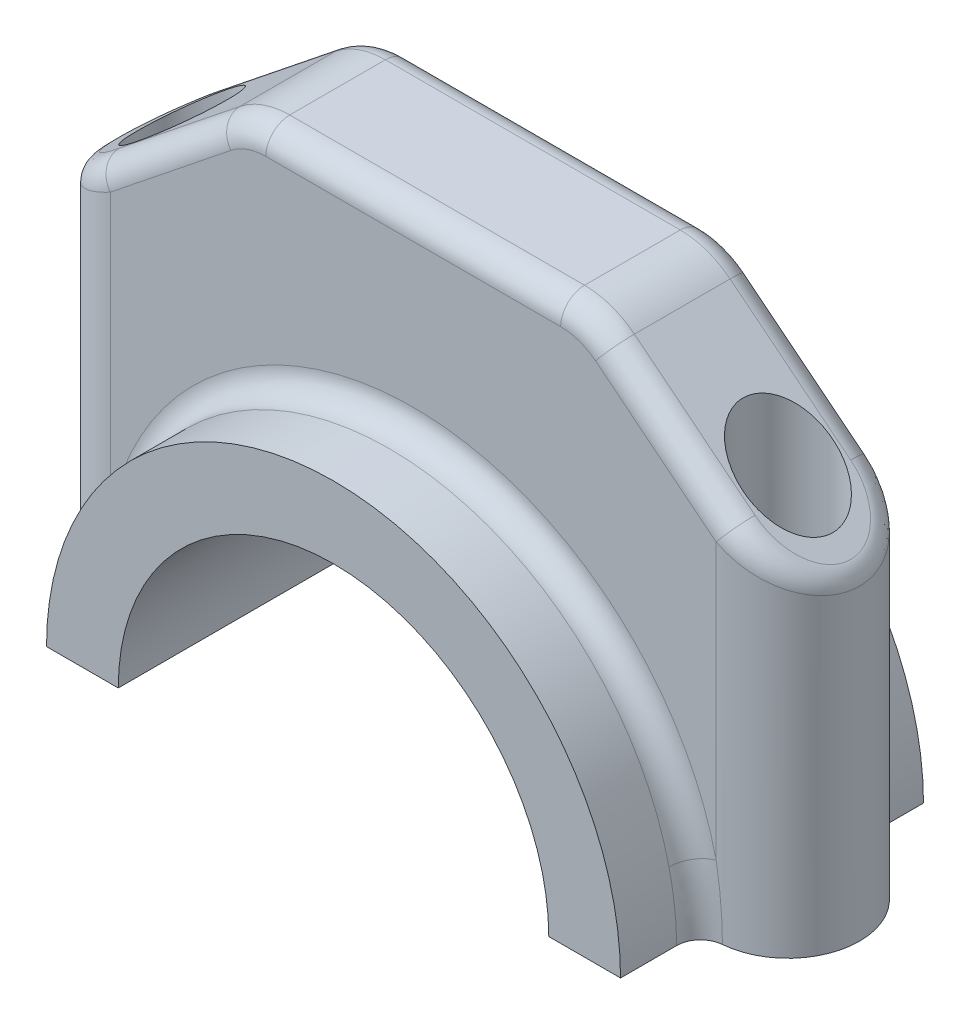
ISO-10303-21;
HEADER;
FILE_DESCRIPTION(('STEP AP214'),'2;1');
FILE_NAME('part.step','',(''),(''),'','','');
FILE_SCHEMA(('AUTOMOTIVE_DESIGN { 1 0 10303 214 1 1 1 1 }'));
ENDSEC;
DATA;
#1=APPLICATION_CONTEXT('core data for automotive mechanical design processes');
#2=APPLICATION_PROTOCOL_DEFINITION('international standard','automotive_design',2000,#1);
#3=PRODUCT_CONTEXT('',#1,'mechanical');
#4=PRODUCT('Part','Part','',(#3));
#5=PRODUCT_RELATED_PRODUCT_CATEGORY('part','',(#4));
#6=PRODUCT_DEFINITION_FORMATION('','',#4);
#7=PRODUCT_DEFINITION_CONTEXT('part definition',#1,'design');
#8=PRODUCT_DEFINITION('design','',#6,#7);
#9=PRODUCT_DEFINITION_SHAPE('','',#8);
#10=(LENGTH_UNIT() NAMED_UNIT(*) SI_UNIT(.MILLI.,.METRE.));
#11=(NAMED_UNIT(*) PLANE_ANGLE_UNIT() SI_UNIT($,.RADIAN.));
#12=(NAMED_UNIT(*) SI_UNIT($,.STERADIAN.) SOLID_ANGLE_UNIT());
#13=UNCERTAINTY_MEASURE_WITH_UNIT(LENGTH_MEASURE(1.E-05),#10,'distance_accuracy_value','');
#14=(GEOMETRIC_REPRESENTATION_CONTEXT(3) GLOBAL_UNCERTAINTY_ASSIGNED_CONTEXT((#13)) GLOBAL_UNIT_ASSIGNED_CONTEXT((#10,
#11,#12)) REPRESENTATION_CONTEXT('',''));
#15=CARTESIAN_POINT('',(0.,0.,0.));
#16=DIRECTION('',(0.,0.,1.));
#17=DIRECTION('',(1.,0.,0.));
#18=AXIS2_PLACEMENT_3D('',#15,#16,#17);
#19=CARTESIAN_POINT('',(-36.,0.,19.));
#20=DIRECTION('',(0.,1.,0.));
#21=DIRECTION('',(0.,0.,1.));
#22=AXIS2_PLACEMENT_3D('',#19,#20,#21);
#23=PLANE('',#22);
#24=CARTESIAN_POINT('',(-38.,0.,0.));
#25=DIRECTION('',(0.,-1.,0.));
#26=DIRECTION('',(0.,0.,-1.));
#27=AXIS2_PLACEMENT_3D('',#24,#25,#26);
#28=CIRCLE('',#27,5.6297688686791);
#29=CARTESIAN_POINT('',(-38.,0.,-5.62976886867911));
#30=VERTEX_POINT('',#29);
#31=EDGE_CURVE('E431',#30,#30,#28,.T.);
#32=ORIENTED_EDGE('',*,*,#31,.F.);
#33=EDGE_LOOP('',(#32));
#34=FACE_BOUND('',#33,.T.);
#35=DIRECTION('',(1.,0.,0.));
#36=VECTOR('',#35,1.);
#37=CARTESIAN_POINT('',(-36.,0.,-19.));
#38=LINE('',#37,#36);
#39=CARTESIAN_POINT('',(-36.,0.,-19.));
#40=VERTEX_POINT('',#39);
#41=CARTESIAN_POINT('',(-27.,0.,-19.));
#42=VERTEX_POINT('',#41);
#43=EDGE_CURVE('E230',#40,#42,#38,.T.);
#44=ORIENTED_EDGE('',*,*,#43,.T.);
#45=DIRECTION('',(0.,0.,-1.));
#46=VECTOR('',#45,1.);
#47=CARTESIAN_POINT('',(-27.,0.,19.));
#48=LINE('',#47,#46);
#49=CARTESIAN_POINT('',(-27.,0.,19.));
#50=VERTEX_POINT('',#49);
#51=EDGE_CURVE('E465',#50,#42,#48,.T.);
#52=ORIENTED_EDGE('',*,*,#51,.F.);
#53=DIRECTION('',(1.,0.,0.));
#54=VECTOR('',#53,1.);
#55=CARTESIAN_POINT('',(-36.,0.,19.));
#56=LINE('',#55,#54);
#57=CARTESIAN_POINT('',(-36.,0.,19.));
#58=VERTEX_POINT('',#57);
#59=EDGE_CURVE('E226',#58,#50,#56,.T.);
#60=ORIENTED_EDGE('',*,*,#59,.F.);
#61=DIRECTION('',(0.,0.,-1.));
#62=VECTOR('',#61,1.);
#63=CARTESIAN_POINT('',(-36.,0.,19.));
#64=LINE('',#63,#62);
#65=CARTESIAN_POINT('',(-36.,0.,11.9582607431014));
#66=VERTEX_POINT('',#65);
#67=EDGE_CURVE('E480',#58,#66,#64,.T.);
#68=ORIENTED_EDGE('',*,*,#67,.T.);
#69=CARTESIAN_POINT('',(-39.,0.,11.9582607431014));
#70=DIRECTION('',(0.,1.,0.));
#71=DIRECTION('',(0.,0.,1.));
#72=AXIS2_PLACEMENT_3D('',#69,#70,#71);
#73=CIRCLE('',#72,3.);
#74=CARTESIAN_POINT('',(-38.75,0.,8.96869555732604));
#75=VERTEX_POINT('',#74);
#76=EDGE_CURVE('E513',#66,#75,#73,.T.);
#77=ORIENTED_EDGE('',*,*,#76,.T.);
#78=CARTESIAN_POINT('',(-38.,0.,0.));
#79=DIRECTION('',(0.,1.,0.));
#80=DIRECTION('',(0.,0.,1.));
#81=AXIS2_PLACEMENT_3D('',#78,#79,#80);
#82=CIRCLE('',#81,9.00000000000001);
#83=CARTESIAN_POINT('',(-38.75,0.,-8.96869555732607));
#84=VERTEX_POINT('',#83);
#85=EDGE_CURVE('E438',#84,#75,#82,.T.);
#86=ORIENTED_EDGE('',*,*,#85,.F.);
#87=CARTESIAN_POINT('',(-39.,0.,-11.9582607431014));
#88=DIRECTION('',(0.,1.,0.));
#89=DIRECTION('',(0.,0.,1.));
#90=AXIS2_PLACEMENT_3D('',#87,#88,#89);
#91=CIRCLE('',#90,3.);
#92=CARTESIAN_POINT('',(-36.,0.,-11.9582607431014));
#93=VERTEX_POINT('',#92);
#94=EDGE_CURVE('E491',#84,#93,#91,.T.);
#95=ORIENTED_EDGE('',*,*,#94,.T.);
#96=EDGE_CURVE('E479',#93,#40,#64,.T.);
#97=ORIENTED_EDGE('',*,*,#96,.T.);
#98=EDGE_LOOP('',(#44,#52,#60,#68,#77,#86,#95,#97));
#99=FACE_BOUND('',#98,.T.);
#100=ADVANCED_FACE('F47',(#34,#99),#23,.F.);
#101=CARTESIAN_POINT('',(0.,0.,19.));
#102=DIRECTION('',(0.,0.,-1.));
#103=DIRECTION('',(-1.,0.,0.));
#104=AXIS2_PLACEMENT_3D('',#101,#102,#103);
#105=CYLINDRICAL_SURFACE('',#104,27.);
#106=ORIENTED_EDGE('',*,*,#51,.T.);
#107=CARTESIAN_POINT('',(0.,0.,-19.));
#108=DIRECTION('',(0.,0.,-1.));
#109=DIRECTION('',(1.,0.,0.));
#110=AXIS2_PLACEMENT_3D('',#107,#108,#109);
#111=CIRCLE('',#110,27.);
#112=CARTESIAN_POINT('',(27.,0.,-19.));
#113=VERTEX_POINT('',#112);
#114=EDGE_CURVE('E235',#42,#113,#111,.T.);
#115=ORIENTED_EDGE('',*,*,#114,.T.);
#116=DIRECTION('',(0.,0.,-1.));
#117=VECTOR('',#116,1.);
#118=CARTESIAN_POINT('',(27.,0.,19.));
#119=LINE('',#118,#117);
#120=CARTESIAN_POINT('',(27.,0.,19.));
#121=VERTEX_POINT('',#120);
#122=EDGE_CURVE('E213',#121,#113,#119,.T.);
#123=ORIENTED_EDGE('',*,*,#122,.F.);
#124=CARTESIAN_POINT('',(0.,0.,19.));
#125=DIRECTION('',(0.,0.,-1.));
#126=DIRECTION('',(1.,0.,0.));
#127=AXIS2_PLACEMENT_3D('',#124,#125,#126);
#128=CIRCLE('',#127,27.);
#129=EDGE_CURVE('E221',#50,#121,#128,.T.);
#130=ORIENTED_EDGE('',*,*,#129,.F.);
#131=EDGE_LOOP('',(#106,#115,#123,#130));
#132=FACE_BOUND('',#131,.T.);
#133=ADVANCED_FACE('F233',(#132),#105,.F.);
#134=CARTESIAN_POINT('',(0.,0.,19.));
#135=DIRECTION('',(0.,0.,-1.));
#136=DIRECTION('',(-1.,0.,0.));
#137=AXIS2_PLACEMENT_3D('',#134,#135,#136);
#138=CYLINDRICAL_SURFACE('',#137,36.);
#139=ORIENTED_EDGE('',*,*,#96,.F.);
#140=CARTESIAN_POINT('',(-37.4810325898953,11.3626534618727,-8.98502492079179));
#141=CARTESIAN_POINT('',(-34.4537354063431,10.4375745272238,-8.81017080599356));
#142=CARTESIAN_POINT('',(-34.4381939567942,10.4886031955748,-11.9800332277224));
#143=CARTESIAN_POINT('',(-37.5298969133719,11.148733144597,-8.98784608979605));
#144=CARTESIAN_POINT('',(-34.5115894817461,10.2465778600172,-8.82998687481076));
#145=CARTESIAN_POINT('',(-34.498334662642,10.2911382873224,-11.9837947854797));
#146=CARTESIAN_POINT('',(-37.577382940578,10.9342439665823,-8.9901901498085));
#147=CARTESIAN_POINT('',(-34.5681739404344,10.0540399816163,-8.84874261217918));
#148=CARTESIAN_POINT('',(-34.556779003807,10.0931482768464,-11.9869201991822));
#149=CARTESIAN_POINT('',(-37.6695772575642,10.5042248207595,-8.99405103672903));
#150=CARTESIAN_POINT('',(-34.678332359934,9.66718051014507,-8.88416835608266));
#151=CARTESIAN_POINT('',(-34.6702489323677,9.69620752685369,-11.9920680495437));
#152=CARTESIAN_POINT('',(-37.7142859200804,10.2886949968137,-8.99556797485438));
#153=CARTESIAN_POINT('',(-34.731937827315,9.4728121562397,-8.9008542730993));
#154=CARTESIAN_POINT('',(-34.7252749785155,9.49725692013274,-11.9940906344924));
#155=CARTESIAN_POINT('',(-37.8007754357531,9.85734250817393,-8.99789846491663));
#156=CARTESIAN_POINT('',(-34.8358867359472,9.08303942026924,-8.93226168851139));
#157=CARTESIAN_POINT('',(-34.8317236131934,9.09908539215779,-11.9971979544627));
#158=CARTESIAN_POINT('',(-37.8425654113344,9.64152312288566,-8.99871430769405));
#159=CARTESIAN_POINT('',(-34.8862690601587,8.88759468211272,-8.94700271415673));
#160=CARTESIAN_POINT('',(-34.8831574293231,8.89986749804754,-11.9982857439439));
#161=CARTESIAN_POINT('',(-37.923368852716,9.208939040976,-8.99976377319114));
#162=CARTESIAN_POINT('',(-34.9838968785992,8.49516334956,-8.97474421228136));
#163=CARTESIAN_POINT('',(-34.9826078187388,8.50055911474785,-11.9996850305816));
#164=CARTESIAN_POINT('',(-37.9623819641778,8.99217422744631,-8.99999732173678));
#165=CARTESIAN_POINT('',(-35.0311700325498,8.29812568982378,-8.98775615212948));
#166=CARTESIAN_POINT('',(-35.0306239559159,8.30046851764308,-11.9999964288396));
#167=CARTESIAN_POINT('',(-38.170169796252,7.7923890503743,-9.0000121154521));
#168=CARTESIAN_POINT('',(-35.2815859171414,7.21356284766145,-9.0547692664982));
#169=CARTESIAN_POINT('',(-35.2863628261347,7.19297450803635,-12.0000161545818));
#170=CARTESIAN_POINT('',(-38.3117919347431,6.80070706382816,-8.99529989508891));
#171=CARTESIAN_POINT('',(-35.4565715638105,6.30129716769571,-9.09435648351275));
#172=CARTESIAN_POINT('',(-35.4606669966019,6.27757575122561,-11.9937331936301));
#173=CARTESIAN_POINT('',(-38.5370044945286,4.80517282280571,-8.9846763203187));
#174=CARTESIAN_POINT('',(-35.7342965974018,4.46262507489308,-9.15229240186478));
#175=CARTESIAN_POINT('',(-35.7378516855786,4.43554414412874,-11.9795684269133));
#176=CARTESIAN_POINT('',(-38.620559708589,3.80131355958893,-8.97876424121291));
#177=CARTESIAN_POINT('',(-35.8386966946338,3.53077783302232,-9.17105709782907));
#178=CARTESIAN_POINT('',(-35.8406888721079,3.50890482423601,-11.9716856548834));
#179=CARTESIAN_POINT('',(-38.7023265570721,2.28395835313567,-8.97258744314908));
#180=CARTESIAN_POINT('',(-35.9405679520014,2.12176509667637,-9.18876896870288));
#181=CARTESIAN_POINT('',(-35.9413249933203,2.10826924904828,-11.9634499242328));
#182=CARTESIAN_POINT('',(-38.7223028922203,1.77242253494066,-8.97097540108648));
#183=CARTESIAN_POINT('',(-35.9654791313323,1.64656202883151,-9.19294374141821));
#184=CARTESIAN_POINT('',(-35.9659112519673,1.63608233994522,-11.9613005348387));
#185=CARTESIAN_POINT('',(-38.7471320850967,0.748661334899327,-8.96894546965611));
#186=CARTESIAN_POINT('',(-35.9964090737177,0.695843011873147,-9.19808791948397));
#187=CARTESIAN_POINT('',(-35.9964702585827,0.691072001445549,-11.9585939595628));
#188=CARTESIAN_POINT('',(-38.7519847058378,0.236435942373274,-8.96852759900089));
#189=CARTESIAN_POINT('',(-36.0024767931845,0.21957169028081,-9.1990655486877));
#190=CARTESIAN_POINT('',(-36.0024427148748,0.218248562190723,-11.958036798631));
#191=CARTESIAN_POINT('',(-38.7465546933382,-0.787617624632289,-8.96898559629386));
#192=CARTESIAN_POINT('',(-35.9957015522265,-0.731749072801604,-9.19795969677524));
#193=CARTESIAN_POINT('',(-35.9957596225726,-0.727031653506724,-11.958647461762));
#194=CARTESIAN_POINT('',(-38.7362793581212,-1.29944587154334,-8.96986084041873));
#195=CARTESIAN_POINT('',(-35.982856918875,-1.20755615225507,-9.19587593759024));
#196=CARTESIAN_POINT('',(-35.9831130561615,-1.19948849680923,-11.9598144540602));
#197=CARTESIAN_POINT('',(-38.7006289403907,-2.32215561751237,-8.9726945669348));
#198=CARTESIAN_POINT('',(-35.9384938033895,-2.15692600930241,-9.188375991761));
#199=CARTESIAN_POINT('',(-35.9392356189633,-2.1435282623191,-11.9635927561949));
#200=CARTESIAN_POINT('',(-38.6752540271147,-2.83303712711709,-8.97465303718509));
#201=CARTESIAN_POINT('',(-35.9069050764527,-2.63124043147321,-9.18294760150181));
#202=CARTESIAN_POINT('',(-35.9080049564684,-2.61511119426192,-11.9662040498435));
#203=CARTESIAN_POINT('',(-38.642340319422,-3.34305268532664,-8.97704845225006));
#204=CARTESIAN_POINT('',(-35.8660269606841,-3.10296691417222,-9.17570372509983));
#205=CARTESIAN_POINT('',(-35.8674957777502,-3.08589478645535,-11.9693979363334));
#206=(BOUNDED_SURFACE() B_SPLINE_SURFACE(3,2,((#140,#141,#142),(#143,#144,#145),(#146,#147,
#148),(#149,#150,#151),(#152,#153,#154),(#155,#156,#157),(#158,#159,#160),(#161,#162,#163),
(#164,#165,#166),(#167,#168,#169),(#170,#171,#172),(#173,#174,#175),(#176,#177,#178),(#179,#180,
#181),(#182,#183,#184),(#185,#186,#187),(#188,#189,#190),(#191,#192,#193),(#194,#195,#196),
(#197,#198,#199),(#200,#201,#202),(#203,#204,#205)),.UNSPECIFIED.,.F.,.F.,
.F.) B_SPLINE_SURFACE_WITH_KNOTS((4,2,2,2,2,2,2,2,2,2,4),(3,3),(0.,0.670947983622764,
1.34180572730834,2.01046300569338,2.67920545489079,5.70434389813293,8.73131495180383,
10.2676745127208,11.8040581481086,13.3397008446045,14.8753263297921),(0.,1.),
.UNSPECIFIED.) GEOMETRIC_REPRESENTATION_ITEM() RATIONAL_B_SPLINE_SURFACE(((1.,0.687327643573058,
1.),(1.,0.689181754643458,1.),(1.,0.690985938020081,1.),(1.,0.694492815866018,1.),(1.,
0.696195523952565,1.),(1.,0.699492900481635,1.),(1.,0.701087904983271,1.),(1.,0.7041749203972,
1.),(1.,0.705666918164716,1.),(1.,0.713620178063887,1.),(1.,0.719066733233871,1.),(1.,
0.727743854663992,1.),(1.,0.730973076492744,1.),(1.,0.734135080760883,1.),(1.,0.734908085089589,
1.),(1.,0.735869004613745,1.),(1.,0.736056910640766,1.),(1.,0.735846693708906,1.),(1.,
0.735448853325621,1.),(1.,0.734069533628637,1.),(1.,0.733088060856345,1.),(1.,0.731815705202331,1.))) REPRESENTATION_ITEM('') SURFACE());
#207=CARTESIAN_POINT('',(-35.8674957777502,-3.08589478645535,-11.9693979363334));
#208=CARTESIAN_POINT('',(-35.9080049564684,-2.61511119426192,-11.9662040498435));
#209=CARTESIAN_POINT('',(-35.9392356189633,-2.1435282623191,-11.9635927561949));
#210=CARTESIAN_POINT('',(-35.9831130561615,-1.19948849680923,-11.9598144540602));
#211=CARTESIAN_POINT('',(-35.9957596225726,-0.727031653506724,-11.958647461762));
#212=CARTESIAN_POINT('',(-36.0024427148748,0.218248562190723,-11.958036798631));
#213=CARTESIAN_POINT('',(-35.9964702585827,0.691072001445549,-11.9585939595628));
#214=CARTESIAN_POINT('',(-35.9659112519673,1.63608233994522,-11.9613005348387));
#215=CARTESIAN_POINT('',(-35.9413249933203,2.10826924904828,-11.9634499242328));
#216=CARTESIAN_POINT('',(-35.8406888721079,3.50890482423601,-11.9716856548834));
#217=CARTESIAN_POINT('',(-35.7378516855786,4.43554414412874,-11.9795684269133));
#218=CARTESIAN_POINT('',(-35.4606669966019,6.27757575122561,-11.9937331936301));
#219=CARTESIAN_POINT('',(-35.2863628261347,7.19297450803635,-12.0000161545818));
#220=CARTESIAN_POINT('',(-35.0306239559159,8.30046851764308,-11.9999964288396));
#221=CARTESIAN_POINT('',(-34.9826078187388,8.50055911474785,-11.9996850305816));
#222=CARTESIAN_POINT('',(-34.8831574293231,8.89986749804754,-11.9982857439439));
#223=CARTESIAN_POINT('',(-34.8317236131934,9.09908539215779,-11.9971979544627));
#224=CARTESIAN_POINT('',(-34.7252749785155,9.49725692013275,-11.9940906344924));
#225=CARTESIAN_POINT('',(-34.6702489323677,9.69620752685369,-11.9920680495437));
#226=CARTESIAN_POINT('',(-34.556779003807,10.0931482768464,-11.9869201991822));
#227=CARTESIAN_POINT('',(-34.498334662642,10.2911382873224,-11.9837947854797));
#228=CARTESIAN_POINT('',(-34.4381939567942,10.4886031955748,-11.9800332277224));
#229=B_SPLINE_CURVE_WITH_KNOTS('',3,(#207,#208,#209,#210,#211,#212,#213,#214,#215,#216,#217,
#218,#219,#220,#221,#222,#223,#224,#225,#226,#227,#228),.UNSPECIFIED.,.F.,.F.,(4,2,2,2,2,2,2,2,
2,2,4),(0.,1.53562548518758,3.07126818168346,4.60765181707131,6.14401137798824,9.17098243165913,
12.1961208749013,12.8648633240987,13.5335206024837,14.2043783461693,14.8753263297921),.UNSPECIFIED.);
#230=CARTESIAN_POINT('',(-35.0769230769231,8.09996712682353,-12.));
#231=VERTEX_POINT('',#230);
#232=EDGE_CURVE('E585',#93,#231,#229,.T.);
#233=ORIENTED_EDGE('',*,*,#232,.T.);
#234=CARTESIAN_POINT('',(0.,0.,-12.));
#235=DIRECTION('',(0.,0.,1.));
#236=DIRECTION('',(1.,0.,0.));
#237=AXIS2_PLACEMENT_3D('',#234,#235,#236);
#238=CIRCLE('',#237,36.);
#239=CARTESIAN_POINT('',(35.0769230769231,8.09996712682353,-12.));
#240=VERTEX_POINT('',#239);
#241=EDGE_CURVE('E580',#231,#240,#238,.F.);
#242=ORIENTED_EDGE('',*,*,#241,.T.);
#243=CARTESIAN_POINT('',(34.4381939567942,10.4886031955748,-11.9800332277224));
#244=CARTESIAN_POINT('',(34.4537354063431,10.4375745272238,-8.81017080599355));
#245=CARTESIAN_POINT('',(37.4810325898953,11.3626534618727,-8.98502492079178));
#246=CARTESIAN_POINT('',(34.498334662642,10.2911382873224,-11.9837947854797));
#247=CARTESIAN_POINT('',(34.5115894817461,10.2465778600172,-8.82998687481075));
#248=CARTESIAN_POINT('',(37.5298969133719,11.148733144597,-8.98784608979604));
#249=CARTESIAN_POINT('',(34.556779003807,10.0931482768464,-11.9869201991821));
#250=CARTESIAN_POINT('',(34.5681739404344,10.0540399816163,-8.84874261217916));
#251=CARTESIAN_POINT('',(37.577382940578,10.9342439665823,-8.99019014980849));
#252=CARTESIAN_POINT('',(34.6702489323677,9.69620752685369,-11.9920680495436));
#253=CARTESIAN_POINT('',(34.678332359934,9.66718051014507,-8.88416835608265));
#254=CARTESIAN_POINT('',(37.6695772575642,10.5042248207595,-8.99405103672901));
#255=CARTESIAN_POINT('',(34.7252749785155,9.49725692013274,-11.9940906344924));
#256=CARTESIAN_POINT('',(34.7319378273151,9.4728121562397,-8.90085427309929));
#257=CARTESIAN_POINT('',(37.7142859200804,10.2886949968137,-8.99556797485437));
#258=CARTESIAN_POINT('',(34.8317236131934,9.09908539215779,-11.9971979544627));
#259=CARTESIAN_POINT('',(34.8358867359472,9.08303942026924,-8.93226168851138));
#260=CARTESIAN_POINT('',(37.8007754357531,9.85734250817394,-8.99789846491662));
#261=CARTESIAN_POINT('',(34.8831574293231,8.89986749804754,-11.9982857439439));
#262=CARTESIAN_POINT('',(34.8862690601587,8.88759468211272,-8.94700271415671));
#263=CARTESIAN_POINT('',(37.8425654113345,9.64152312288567,-8.99871430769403));
#264=CARTESIAN_POINT('',(34.9826078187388,8.50055911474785,-11.9996850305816));
#265=CARTESIAN_POINT('',(34.9838968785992,8.49516334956,-8.97474421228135));
#266=CARTESIAN_POINT('',(37.923368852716,9.208939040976,-8.99976377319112));
#267=CARTESIAN_POINT('',(35.0306239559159,8.30046851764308,-11.9999964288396));
#268=CARTESIAN_POINT('',(35.0311700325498,8.29812568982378,-8.98775615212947));
#269=CARTESIAN_POINT('',(37.9623819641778,8.99217422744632,-8.99999732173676));
#270=CARTESIAN_POINT('',(35.2863628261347,7.19297450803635,-12.0000161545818));
#271=CARTESIAN_POINT('',(35.2815859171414,7.21356284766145,-9.05476926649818));
#272=CARTESIAN_POINT('',(38.170169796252,7.7923890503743,-9.00001211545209));
#273=CARTESIAN_POINT('',(35.4606669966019,6.27757575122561,-11.9937331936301));
#274=CARTESIAN_POINT('',(35.4565715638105,6.30129716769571,-9.09435648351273));
#275=CARTESIAN_POINT('',(38.3117919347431,6.80070706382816,-8.99529989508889));
#276=CARTESIAN_POINT('',(35.7378516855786,4.43554414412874,-11.9795684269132));
#277=CARTESIAN_POINT('',(35.7342965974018,4.46262507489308,-9.15229240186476));
#278=CARTESIAN_POINT('',(38.5370044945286,4.80517282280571,-8.98467632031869));
#279=CARTESIAN_POINT('',(35.8406888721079,3.50890482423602,-11.9716856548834));
#280=CARTESIAN_POINT('',(35.8386966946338,3.53077783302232,-9.17105709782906));
#281=CARTESIAN_POINT('',(38.620559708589,3.80131355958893,-8.9787642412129));
#282=CARTESIAN_POINT('',(35.9413249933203,2.10826924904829,-11.9634499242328));
#283=CARTESIAN_POINT('',(35.9405679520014,2.12176509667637,-9.18876896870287));
#284=CARTESIAN_POINT('',(38.7023265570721,2.28395835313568,-8.97258744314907));
#285=CARTESIAN_POINT('',(35.9659112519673,1.63608233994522,-11.9613005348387));
#286=CARTESIAN_POINT('',(35.9654791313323,1.64656202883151,-9.1929437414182));
#287=CARTESIAN_POINT('',(38.7223028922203,1.77242253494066,-8.97097540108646));
#288=CARTESIAN_POINT('',(35.9964702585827,0.69107200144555,-11.9585939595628));
#289=CARTESIAN_POINT('',(35.9964090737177,0.695843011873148,-9.19808791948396));
#290=CARTESIAN_POINT('',(38.7471320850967,0.748661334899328,-8.9689454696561));
#291=CARTESIAN_POINT('',(36.0024427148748,0.218248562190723,-11.958036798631));
#292=CARTESIAN_POINT('',(36.0024767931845,0.21957169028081,-9.19906554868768));
#293=CARTESIAN_POINT('',(38.7519847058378,0.236435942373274,-8.96852759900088));
#294=CARTESIAN_POINT('',(35.9957596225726,-0.727031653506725,-11.9586474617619));
#295=CARTESIAN_POINT('',(35.9957015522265,-0.731749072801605,-9.19795969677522));
#296=CARTESIAN_POINT('',(38.7465546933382,-0.787617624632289,-8.96898559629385));
#297=CARTESIAN_POINT('',(35.9831130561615,-1.19948849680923,-11.9598144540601));
#298=CARTESIAN_POINT('',(35.982856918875,-1.20755615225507,-9.19587593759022));
#299=CARTESIAN_POINT('',(38.7362793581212,-1.29944587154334,-8.96986084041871));
#300=CARTESIAN_POINT('',(35.9392356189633,-2.1435282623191,-11.9635927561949));
#301=CARTESIAN_POINT('',(35.9384938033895,-2.15692600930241,-9.18837599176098));
#302=CARTESIAN_POINT('',(38.7006289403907,-2.32215561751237,-8.97269456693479));
#303=CARTESIAN_POINT('',(35.9080049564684,-2.61511119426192,-11.9662040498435));
#304=CARTESIAN_POINT('',(35.9069050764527,-2.63124043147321,-9.18294760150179));
#305=CARTESIAN_POINT('',(38.6752540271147,-2.83303712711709,-8.97465303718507));
#306=CARTESIAN_POINT('',(35.8674957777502,-3.08589478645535,-11.9693979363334));
#307=CARTESIAN_POINT('',(35.8660269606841,-3.10296691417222,-9.17570372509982));
#308=CARTESIAN_POINT('',(38.642340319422,-3.34305268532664,-8.97704845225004));
#309=(BOUNDED_SURFACE() B_SPLINE_SURFACE(3,2,((#243,#244,#245),(#246,#247,#248),(#249,#250,
#251),(#252,#253,#254),(#255,#256,#257),(#258,#259,#260),(#261,#262,#263),(#264,#265,#266),
(#267,#268,#269),(#270,#271,#272),(#273,#274,#275),(#276,#277,#278),(#279,#280,#281),(#282,#283,
#284),(#285,#286,#287),(#288,#289,#290),(#291,#292,#293),(#294,#295,#296),(#297,#298,#299),
(#300,#301,#302),(#303,#304,#305),(#306,#307,#308)),.UNSPECIFIED.,.F.,.F.,
.F.) B_SPLINE_SURFACE_WITH_KNOTS((4,2,2,2,2,2,2,2,2,2,4),(3,3),(0.,0.670947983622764,
1.34180572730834,2.01046300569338,2.67920545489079,5.70434389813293,8.73131495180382,
10.2676745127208,11.8040581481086,13.3397008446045,14.8753263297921),(0.,1.),
.UNSPECIFIED.) GEOMETRIC_REPRESENTATION_ITEM() RATIONAL_B_SPLINE_SURFACE(((1.,0.687327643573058,
1.),(1.,0.689181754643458,1.),(1.,0.690985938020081,1.),(1.,0.694492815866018,1.),(1.,
0.696195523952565,1.),(1.,0.699492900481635,1.),(1.,0.701087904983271,1.),(1.,0.7041749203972,
1.),(1.,0.705666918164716,1.),(1.,0.713620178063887,1.),(1.,0.719066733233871,1.),(1.,
0.727743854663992,1.),(1.,0.730973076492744,1.),(1.,0.734135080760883,1.),(1.,0.734908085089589,
1.),(1.,0.735869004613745,1.),(1.,0.736056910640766,1.),(1.,0.735846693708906,1.),(1.,
0.735448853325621,1.),(1.,0.734069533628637,1.),(1.,0.733088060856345,1.),(1.,0.731815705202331,1.))) REPRESENTATION_ITEM('') SURFACE());
#310=CARTESIAN_POINT('',(34.4381939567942,10.4886031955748,-11.9800332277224));
#311=CARTESIAN_POINT('',(34.498334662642,10.2911382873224,-11.9837947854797));
#312=CARTESIAN_POINT('',(34.556779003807,10.0931482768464,-11.9869201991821));
#313=CARTESIAN_POINT('',(34.6702489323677,9.69620752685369,-11.9920680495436));
#314=CARTESIAN_POINT('',(34.7252749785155,9.49725692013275,-11.9940906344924));
#315=CARTESIAN_POINT('',(34.8317236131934,9.09908539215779,-11.9971979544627));
#316=CARTESIAN_POINT('',(34.8831574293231,8.89986749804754,-11.9982857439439));
#317=CARTESIAN_POINT('',(34.9826078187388,8.50055911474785,-11.9996850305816));
#318=CARTESIAN_POINT('',(35.0306239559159,8.30046851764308,-11.9999964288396));
#319=CARTESIAN_POINT('',(35.2863628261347,7.19297450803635,-12.0000161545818));
#320=CARTESIAN_POINT('',(35.4606669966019,6.27757575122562,-11.9937331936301));
#321=CARTESIAN_POINT('',(35.7378516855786,4.43554414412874,-11.9795684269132));
#322=CARTESIAN_POINT('',(35.8406888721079,3.50890482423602,-11.9716856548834));
#323=CARTESIAN_POINT('',(35.9413249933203,2.10826924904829,-11.9634499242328));
#324=CARTESIAN_POINT('',(35.9659112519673,1.63608233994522,-11.9613005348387));
#325=CARTESIAN_POINT('',(35.9964702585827,0.691072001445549,-11.9585939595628));
#326=CARTESIAN_POINT('',(36.0024427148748,0.218248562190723,-11.958036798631));
#327=CARTESIAN_POINT('',(35.9957596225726,-0.727031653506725,-11.9586474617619));
#328=CARTESIAN_POINT('',(35.9831130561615,-1.19948849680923,-11.9598144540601));
#329=CARTESIAN_POINT('',(35.9392356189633,-2.1435282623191,-11.9635927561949));
#330=CARTESIAN_POINT('',(35.9080049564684,-2.61511119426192,-11.9662040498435));
#331=CARTESIAN_POINT('',(35.8674957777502,-3.08589478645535,-11.9693979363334));
#332=B_SPLINE_CURVE_WITH_KNOTS('',3,(#310,#311,#312,#313,#314,#315,#316,#317,#318,#319,#320,
#321,#322,#323,#324,#325,#326,#327,#328,#329,#330,#331),.UNSPECIFIED.,.F.,.F.,(4,2,2,2,2,2,2,2,
2,2,4),(0.,0.670947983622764,1.34180572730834,2.01046300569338,2.67920545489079,
5.70434389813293,8.73131495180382,10.2676745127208,11.8040581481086,13.3397008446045,
14.8753263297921),.UNSPECIFIED.);
#333=CARTESIAN_POINT('',(36.,0.,-11.9582607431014));
#334=VERTEX_POINT('',#333);
#335=EDGE_CURVE('E504',#240,#334,#332,.T.);
#336=ORIENTED_EDGE('',*,*,#335,.T.);
#337=DIRECTION('',(0.,0.,-1.));
#338=VECTOR('',#337,1.);
#339=CARTESIAN_POINT('',(36.,0.,19.));
#340=LINE('',#339,#338);
#341=CARTESIAN_POINT('',(36.,0.,-19.));
#342=VERTEX_POINT('',#341);
#343=EDGE_CURVE('E244',#334,#342,#340,.T.);
#344=ORIENTED_EDGE('',*,*,#343,.T.);
#345=CARTESIAN_POINT('',(0.,0.,-19.));
#346=DIRECTION('',(0.,0.,1.));
#347=DIRECTION('',(1.,0.,0.));
#348=AXIS2_PLACEMENT_3D('',#345,#346,#347);
#349=CIRCLE('',#348,36.);
#350=EDGE_CURVE('E471',#342,#40,#349,.T.);
#351=ORIENTED_EDGE('',*,*,#350,.T.);
#352=EDGE_LOOP('',(#139,#233,#242,#336,#344,#351));
#353=FACE_BOUND('',#352,.T.);
#354=ADVANCED_FACE('F323',(#353),#138,.T.);
#355=CARTESIAN_POINT('',(36.,0.,19.));
#356=VERTEX_POINT('',#355);
#357=CARTESIAN_POINT('',(36.,0.,11.9582607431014));
#358=VERTEX_POINT('',#357);
#359=EDGE_CURVE('E216',#356,#358,#340,.T.);
#360=ORIENTED_EDGE('',*,*,#359,.T.);
#361=CARTESIAN_POINT('',(37.4810325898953,11.3626534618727,8.98502492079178));
#362=CARTESIAN_POINT('',(34.4537354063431,10.4375745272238,8.81017080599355));
#363=CARTESIAN_POINT('',(34.4381939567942,10.4886031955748,11.9800332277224));
#364=CARTESIAN_POINT('',(37.5298969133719,11.148733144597,8.98784608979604));
#365=CARTESIAN_POINT('',(34.5115894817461,10.2465778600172,8.82998687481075));
#366=CARTESIAN_POINT('',(34.498334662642,10.2911382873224,11.9837947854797));
#367=CARTESIAN_POINT('',(37.577382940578,10.9342439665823,8.99019014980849));
#368=CARTESIAN_POINT('',(34.5681739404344,10.0540399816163,8.84874261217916));
#369=CARTESIAN_POINT('',(34.556779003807,10.0931482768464,11.9869201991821));
#370=CARTESIAN_POINT('',(37.6695772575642,10.5042248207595,8.99405103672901));
#371=CARTESIAN_POINT('',(34.678332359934,9.66718051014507,8.88416835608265));
#372=CARTESIAN_POINT('',(34.6702489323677,9.69620752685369,11.9920680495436));
#373=CARTESIAN_POINT('',(37.7142859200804,10.2886949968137,8.99556797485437));
#374=CARTESIAN_POINT('',(34.7319378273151,9.4728121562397,8.90085427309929));
#375=CARTESIAN_POINT('',(34.7252749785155,9.49725692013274,11.9940906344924));
#376=CARTESIAN_POINT('',(37.8007754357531,9.85734250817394,8.99789846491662));
#377=CARTESIAN_POINT('',(34.8358867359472,9.08303942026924,8.93226168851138));
#378=CARTESIAN_POINT('',(34.8317236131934,9.09908539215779,11.9971979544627));
#379=CARTESIAN_POINT('',(37.8425654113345,9.64152312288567,8.99871430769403));
#380=CARTESIAN_POINT('',(34.8862690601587,8.88759468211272,8.94700271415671));
#381=CARTESIAN_POINT('',(34.8831574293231,8.89986749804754,11.9982857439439));
#382=CARTESIAN_POINT('',(37.923368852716,9.208939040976,8.99976377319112));
#383=CARTESIAN_POINT('',(34.9838968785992,8.49516334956,8.97474421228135));
#384=CARTESIAN_POINT('',(34.9826078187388,8.50055911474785,11.9996850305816));
#385=CARTESIAN_POINT('',(37.9623819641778,8.99217422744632,8.99999732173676));
#386=CARTESIAN_POINT('',(35.0311700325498,8.29812568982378,8.98775615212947));
#387=CARTESIAN_POINT('',(35.0306239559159,8.30046851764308,11.9999964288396));
#388=CARTESIAN_POINT('',(38.170169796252,7.7923890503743,9.00001211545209));
#389=CARTESIAN_POINT('',(35.2815859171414,7.21356284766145,9.05476926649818));
#390=CARTESIAN_POINT('',(35.2863628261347,7.19297450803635,12.0000161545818));
#391=CARTESIAN_POINT('',(38.3117919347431,6.80070706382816,8.99529989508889));
#392=CARTESIAN_POINT('',(35.4565715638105,6.30129716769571,9.09435648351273));
#393=CARTESIAN_POINT('',(35.4606669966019,6.27757575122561,11.9937331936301));
#394=CARTESIAN_POINT('',(38.5370044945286,4.80517282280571,8.98467632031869));
#395=CARTESIAN_POINT('',(35.7342965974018,4.46262507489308,9.15229240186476));
#396=CARTESIAN_POINT('',(35.7378516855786,4.43554414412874,11.9795684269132));
#397=CARTESIAN_POINT('',(38.620559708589,3.80131355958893,8.9787642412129));
#398=CARTESIAN_POINT('',(35.8386966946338,3.53077783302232,9.17105709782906));
#399=CARTESIAN_POINT('',(35.8406888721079,3.50890482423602,11.9716856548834));
#400=CARTESIAN_POINT('',(38.7023265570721,2.28395835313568,8.97258744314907));
#401=CARTESIAN_POINT('',(35.9405679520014,2.12176509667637,9.18876896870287));
#402=CARTESIAN_POINT('',(35.9413249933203,2.10826924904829,11.9634499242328));
#403=CARTESIAN_POINT('',(38.7223028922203,1.77242253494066,8.97097540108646));
#404=CARTESIAN_POINT('',(35.9654791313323,1.64656202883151,9.1929437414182));
#405=CARTESIAN_POINT('',(35.9659112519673,1.63608233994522,11.9613005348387));
#406=CARTESIAN_POINT('',(38.7471320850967,0.748661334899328,8.9689454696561));
#407=CARTESIAN_POINT('',(35.9964090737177,0.695843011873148,9.19808791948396));
#408=CARTESIAN_POINT('',(35.9964702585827,0.69107200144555,11.9585939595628));
#409=CARTESIAN_POINT('',(38.7519847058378,0.236435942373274,8.96852759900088));
#410=CARTESIAN_POINT('',(36.0024767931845,0.21957169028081,9.19906554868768));
#411=CARTESIAN_POINT('',(36.0024427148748,0.218248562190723,11.958036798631));
#412=CARTESIAN_POINT('',(38.7465546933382,-0.787617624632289,8.96898559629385));
#413=CARTESIAN_POINT('',(35.9957015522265,-0.731749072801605,9.19795969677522));
#414=CARTESIAN_POINT('',(35.9957596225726,-0.727031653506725,11.9586474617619));
#415=CARTESIAN_POINT('',(38.7362793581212,-1.29944587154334,8.96986084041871));
#416=CARTESIAN_POINT('',(35.982856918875,-1.20755615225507,9.19587593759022));
#417=CARTESIAN_POINT('',(35.9831130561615,-1.19948849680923,11.9598144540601));
#418=CARTESIAN_POINT('',(38.7006289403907,-2.32215561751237,8.97269456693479));
#419=CARTESIAN_POINT('',(35.9384938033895,-2.15692600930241,9.18837599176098));
#420=CARTESIAN_POINT('',(35.9392356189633,-2.1435282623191,11.9635927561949));
#421=CARTESIAN_POINT('',(38.6752540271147,-2.83303712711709,8.97465303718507));
#422=CARTESIAN_POINT('',(35.9069050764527,-2.63124043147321,9.18294760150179));
#423=CARTESIAN_POINT('',(35.9080049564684,-2.61511119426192,11.9662040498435));
#424=CARTESIAN_POINT('',(38.642340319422,-3.34305268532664,8.97704845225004));
#425=CARTESIAN_POINT('',(35.8660269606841,-3.10296691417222,9.17570372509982));
#426=CARTESIAN_POINT('',(35.8674957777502,-3.08589478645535,11.9693979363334));
#427=(BOUNDED_SURFACE() B_SPLINE_SURFACE(3,2,((#361,#362,#363),(#364,#365,#366),(#367,#368,
#369),(#370,#371,#372),(#373,#374,#375),(#376,#377,#378),(#379,#380,#381),(#382,#383,#384),
(#385,#386,#387),(#388,#389,#390),(#391,#392,#393),(#394,#395,#396),(#397,#398,#399),(#400,#401,
#402),(#403,#404,#405),(#406,#407,#408),(#409,#410,#411),(#412,#413,#414),(#415,#416,#417),
(#418,#419,#420),(#421,#422,#423),(#424,#425,#426)),.UNSPECIFIED.,.F.,.F.,
.F.) B_SPLINE_SURFACE_WITH_KNOTS((4,2,2,2,2,2,2,2,2,2,4),(3,3),(0.,0.670947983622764,
1.34180572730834,2.01046300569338,2.67920545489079,5.70434389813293,8.73131495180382,
10.2676745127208,11.8040581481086,13.3397008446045,14.8753263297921),(0.,1.),
.UNSPECIFIED.) GEOMETRIC_REPRESENTATION_ITEM() RATIONAL_B_SPLINE_SURFACE(((1.,0.687327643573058,
1.),(1.,0.689181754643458,1.),(1.,0.690985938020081,1.),(1.,0.694492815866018,1.),(1.,
0.696195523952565,1.),(1.,0.699492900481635,1.),(1.,0.701087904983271,1.),(1.,0.7041749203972,
1.),(1.,0.705666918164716,1.),(1.,0.713620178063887,1.),(1.,0.719066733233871,1.),(1.,
0.727743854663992,1.),(1.,0.730973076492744,1.),(1.,0.734135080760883,1.),(1.,0.734908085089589,
1.),(1.,0.735869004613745,1.),(1.,0.736056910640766,1.),(1.,0.735846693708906,1.),(1.,
0.735448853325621,1.),(1.,0.734069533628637,1.),(1.,0.733088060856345,1.),(1.,0.731815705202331,1.))) REPRESENTATION_ITEM('') SURFACE());
#428=CARTESIAN_POINT('',(35.8674957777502,-3.08589478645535,11.9693979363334));
#429=CARTESIAN_POINT('',(35.9080049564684,-2.61511119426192,11.9662040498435));
#430=CARTESIAN_POINT('',(35.9392356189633,-2.1435282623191,11.9635927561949));
#431=CARTESIAN_POINT('',(35.9831130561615,-1.19948849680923,11.9598144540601));
#432=CARTESIAN_POINT('',(35.9957596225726,-0.727031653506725,11.9586474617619));
#433=CARTESIAN_POINT('',(36.0024427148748,0.218248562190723,11.958036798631));
#434=CARTESIAN_POINT('',(35.9964702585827,0.691072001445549,11.9585939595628));
#435=CARTESIAN_POINT('',(35.9659112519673,1.63608233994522,11.9613005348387));
#436=CARTESIAN_POINT('',(35.9413249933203,2.10826924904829,11.9634499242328));
#437=CARTESIAN_POINT('',(35.8406888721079,3.50890482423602,11.9716856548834));
#438=CARTESIAN_POINT('',(35.7378516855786,4.43554414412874,11.9795684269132));
#439=CARTESIAN_POINT('',(35.4606669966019,6.27757575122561,11.9937331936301));
#440=CARTESIAN_POINT('',(35.2863628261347,7.19297450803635,12.0000161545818));
#441=CARTESIAN_POINT('',(35.0306239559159,8.30046851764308,11.9999964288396));
#442=CARTESIAN_POINT('',(34.9826078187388,8.50055911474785,11.9996850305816));
#443=CARTESIAN_POINT('',(34.8831574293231,8.89986749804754,11.9982857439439));
#444=CARTESIAN_POINT('',(34.8317236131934,9.09908539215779,11.9971979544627));
#445=CARTESIAN_POINT('',(34.7252749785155,9.49725692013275,11.9940906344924));
#446=CARTESIAN_POINT('',(34.6702489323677,9.69620752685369,11.9920680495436));
#447=CARTESIAN_POINT('',(34.556779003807,10.0931482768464,11.9869201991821));
#448=CARTESIAN_POINT('',(34.498334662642,10.2911382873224,11.9837947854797));
#449=CARTESIAN_POINT('',(34.4381939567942,10.4886031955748,11.9800332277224));
#450=B_SPLINE_CURVE_WITH_KNOTS('',3,(#428,#429,#430,#431,#432,#433,#434,#435,#436,#437,#438,
#439,#440,#441,#442,#443,#444,#445,#446,#447,#448,#449),.UNSPECIFIED.,.F.,.F.,(4,2,2,2,2,2,2,2,
2,2,4),(0.,1.53562548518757,3.07126818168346,4.60765181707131,6.14401137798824,9.17098243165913,
12.1961208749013,12.8648633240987,13.5335206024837,14.2043783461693,14.8753263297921),.UNSPECIFIED.);
#451=CARTESIAN_POINT('',(35.0769230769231,8.09996712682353,12.));
#452=VERTEX_POINT('',#451);
#453=EDGE_CURVE('E634',#358,#452,#450,.T.);
#454=ORIENTED_EDGE('',*,*,#453,.T.);
#455=CARTESIAN_POINT('',(0.,0.,12.));
#456=DIRECTION('',(0.,0.,-1.));
#457=DIRECTION('',(-1.,0.,0.));
#458=AXIS2_PLACEMENT_3D('',#455,#456,#457);
#459=CIRCLE('',#458,36.);
#460=CARTESIAN_POINT('',(-35.0769230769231,8.09996712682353,12.));
#461=VERTEX_POINT('',#460);
#462=EDGE_CURVE('E632',#452,#461,#459,.F.);
#463=ORIENTED_EDGE('',*,*,#462,.T.);
#464=CARTESIAN_POINT('',(-34.4381939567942,10.4886031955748,11.9800332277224));
#465=CARTESIAN_POINT('',(-34.4537354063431,10.4375745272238,8.81017080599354));
#466=CARTESIAN_POINT('',(-37.4810325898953,11.3626534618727,8.98502492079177));
#467=CARTESIAN_POINT('',(-34.498334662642,10.2911382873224,11.9837947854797));
#468=CARTESIAN_POINT('',(-34.5115894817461,10.2465778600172,8.82998687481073));
#469=CARTESIAN_POINT('',(-37.5298969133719,11.148733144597,8.98784608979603));
#470=CARTESIAN_POINT('',(-34.556779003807,10.0931482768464,11.9869201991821));
#471=CARTESIAN_POINT('',(-34.5681739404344,10.0540399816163,8.84874261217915));
#472=CARTESIAN_POINT('',(-37.577382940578,10.9342439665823,8.99019014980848));
#473=CARTESIAN_POINT('',(-34.6702489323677,9.69620752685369,11.9920680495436));
#474=CARTESIAN_POINT('',(-34.678332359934,9.66718051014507,8.88416835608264));
#475=CARTESIAN_POINT('',(-37.6695772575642,10.5042248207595,8.994051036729));
#476=CARTESIAN_POINT('',(-34.7252749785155,9.49725692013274,11.9940906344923));
#477=CARTESIAN_POINT('',(-34.731937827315,9.4728121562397,8.90085427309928));
#478=CARTESIAN_POINT('',(-37.7142859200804,10.2886949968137,8.99556797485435));
#479=CARTESIAN_POINT('',(-34.8317236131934,9.09908539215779,11.9971979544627));
#480=CARTESIAN_POINT('',(-34.8358867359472,9.08303942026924,8.93226168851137));
#481=CARTESIAN_POINT('',(-37.8007754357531,9.85734250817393,8.99789846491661));
#482=CARTESIAN_POINT('',(-34.8831574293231,8.89986749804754,11.9982857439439));
#483=CARTESIAN_POINT('',(-34.8862690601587,8.88759468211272,8.9470027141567));
#484=CARTESIAN_POINT('',(-37.8425654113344,9.64152312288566,8.99871430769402));
#485=CARTESIAN_POINT('',(-34.9826078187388,8.50055911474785,11.9996850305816));
#486=CARTESIAN_POINT('',(-34.9838968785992,8.49516334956,8.97474421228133));
#487=CARTESIAN_POINT('',(-37.923368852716,9.208939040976,8.99976377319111));
#488=CARTESIAN_POINT('',(-35.0306239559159,8.30046851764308,11.9999964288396));
#489=CARTESIAN_POINT('',(-35.0311700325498,8.29812568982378,8.98775615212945));
#490=CARTESIAN_POINT('',(-37.9623819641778,8.99217422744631,8.99999732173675));
#491=CARTESIAN_POINT('',(-35.2863628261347,7.19297450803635,12.0000161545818));
#492=CARTESIAN_POINT('',(-35.2815859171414,7.21356284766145,9.05476926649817));
#493=CARTESIAN_POINT('',(-38.170169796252,7.7923890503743,9.00001211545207));
#494=CARTESIAN_POINT('',(-35.4606669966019,6.27757575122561,11.9937331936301));
#495=CARTESIAN_POINT('',(-35.4565715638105,6.30129716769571,9.09435648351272));
#496=CARTESIAN_POINT('',(-38.3117919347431,6.80070706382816,8.99529989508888));
#497=CARTESIAN_POINT('',(-35.7378516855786,4.43554414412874,11.9795684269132));
#498=CARTESIAN_POINT('',(-35.7342965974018,4.46262507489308,9.15229240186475));
#499=CARTESIAN_POINT('',(-38.5370044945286,4.80517282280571,8.98467632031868));
#500=CARTESIAN_POINT('',(-35.8406888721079,3.50890482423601,11.9716856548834));
#501=CARTESIAN_POINT('',(-35.8386966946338,3.53077783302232,9.17105709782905));
#502=CARTESIAN_POINT('',(-38.620559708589,3.80131355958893,8.97876424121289));
#503=CARTESIAN_POINT('',(-35.9413249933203,2.10826924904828,11.9634499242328));
#504=CARTESIAN_POINT('',(-35.9405679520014,2.12176509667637,9.18876896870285));
#505=CARTESIAN_POINT('',(-38.7023265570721,2.28395835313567,8.97258744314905));
#506=CARTESIAN_POINT('',(-35.9659112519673,1.63608233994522,11.9613005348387));
#507=CARTESIAN_POINT('',(-35.9654791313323,1.64656202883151,9.19294374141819));
#508=CARTESIAN_POINT('',(-38.7223028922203,1.77242253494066,8.97097540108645));
#509=CARTESIAN_POINT('',(-35.9964702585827,0.691072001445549,11.9585939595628));
#510=CARTESIAN_POINT('',(-35.9964090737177,0.695843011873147,9.19808791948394));
#511=CARTESIAN_POINT('',(-38.7471320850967,0.748661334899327,8.96894546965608));
#512=CARTESIAN_POINT('',(-36.0024427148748,0.218248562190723,11.958036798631));
#513=CARTESIAN_POINT('',(-36.0024767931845,0.21957169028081,9.19906554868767));
#514=CARTESIAN_POINT('',(-38.7519847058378,0.236435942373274,8.96852759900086));
#515=CARTESIAN_POINT('',(-35.9957596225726,-0.727031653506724,11.9586474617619));
#516=CARTESIAN_POINT('',(-35.9957015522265,-0.731749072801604,9.19795969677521));
#517=CARTESIAN_POINT('',(-38.7465546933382,-0.787617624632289,8.96898559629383));
#518=CARTESIAN_POINT('',(-35.9831130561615,-1.19948849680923,11.9598144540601));
#519=CARTESIAN_POINT('',(-35.982856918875,-1.20755615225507,9.19587593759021));
#520=CARTESIAN_POINT('',(-38.7362793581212,-1.29944587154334,8.9698608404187));
#521=CARTESIAN_POINT('',(-35.9392356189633,-2.1435282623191,11.9635927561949));
#522=CARTESIAN_POINT('',(-35.9384938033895,-2.15692600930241,9.18837599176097));
#523=CARTESIAN_POINT('',(-38.7006289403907,-2.32215561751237,8.97269456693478));
#524=CARTESIAN_POINT('',(-35.9080049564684,-2.61511119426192,11.9662040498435));
#525=CARTESIAN_POINT('',(-35.9069050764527,-2.63124043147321,9.18294760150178));
#526=CARTESIAN_POINT('',(-38.6752540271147,-2.83303712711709,8.97465303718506));
#527=CARTESIAN_POINT('',(-35.8674957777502,-3.08589478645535,11.9693979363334));
#528=CARTESIAN_POINT('',(-35.8660269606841,-3.10296691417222,9.1757037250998));
#529=CARTESIAN_POINT('',(-38.642340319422,-3.34305268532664,8.97704845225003));
#530=(BOUNDED_SURFACE() B_SPLINE_SURFACE(3,2,((#464,#465,#466),(#467,#468,#469),(#470,#471,
#472),(#473,#474,#475),(#476,#477,#478),(#479,#480,#481),(#482,#483,#484),(#485,#486,#487),
(#488,#489,#490),(#491,#492,#493),(#494,#495,#496),(#497,#498,#499),(#500,#501,#502),(#503,#504,
#505),(#506,#507,#508),(#509,#510,#511),(#512,#513,#514),(#515,#516,#517),(#518,#519,#520),
(#521,#522,#523),(#524,#525,#526),(#527,#528,#529)),.UNSPECIFIED.,.F.,.F.,
.F.) B_SPLINE_SURFACE_WITH_KNOTS((4,2,2,2,2,2,2,2,2,2,4),(3,3),(0.,0.670947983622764,
1.34180572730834,2.01046300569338,2.67920545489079,5.70434389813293,8.73131495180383,
10.2676745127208,11.8040581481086,13.3397008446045,14.8753263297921),(0.,1.),
.UNSPECIFIED.) GEOMETRIC_REPRESENTATION_ITEM() RATIONAL_B_SPLINE_SURFACE(((1.,0.687327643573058,
1.),(1.,0.689181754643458,1.),(1.,0.690985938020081,1.),(1.,0.694492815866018,1.),(1.,
0.696195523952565,1.),(1.,0.699492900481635,1.),(1.,0.701087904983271,1.),(1.,0.7041749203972,
1.),(1.,0.705666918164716,1.),(1.,0.713620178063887,1.),(1.,0.719066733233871,1.),(1.,
0.727743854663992,1.),(1.,0.730973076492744,1.),(1.,0.734135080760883,1.),(1.,0.734908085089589,
1.),(1.,0.735869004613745,1.),(1.,0.736056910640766,1.),(1.,0.735846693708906,1.),(1.,
0.735448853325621,1.),(1.,0.734069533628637,1.),(1.,0.733088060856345,1.),(1.,0.731815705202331,1.))) REPRESENTATION_ITEM('') SURFACE());
#531=CARTESIAN_POINT('',(-34.4381939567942,10.4886031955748,11.9800332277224));
#532=CARTESIAN_POINT('',(-34.498334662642,10.2911382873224,11.9837947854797));
#533=CARTESIAN_POINT('',(-34.556779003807,10.0931482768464,11.9869201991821));
#534=CARTESIAN_POINT('',(-34.6702489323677,9.69620752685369,11.9920680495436));
#535=CARTESIAN_POINT('',(-34.7252749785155,9.49725692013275,11.9940906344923));
#536=CARTESIAN_POINT('',(-34.8317236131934,9.09908539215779,11.9971979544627));
#537=CARTESIAN_POINT('',(-34.8831574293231,8.89986749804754,11.9982857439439));
#538=CARTESIAN_POINT('',(-34.9826078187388,8.50055911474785,11.9996850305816));
#539=CARTESIAN_POINT('',(-35.0306239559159,8.30046851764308,11.9999964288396));
#540=CARTESIAN_POINT('',(-35.2863628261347,7.19297450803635,12.0000161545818));
#541=CARTESIAN_POINT('',(-35.4606669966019,6.27757575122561,11.9937331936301));
#542=CARTESIAN_POINT('',(-35.7378516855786,4.43554414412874,11.9795684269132));
#543=CARTESIAN_POINT('',(-35.8406888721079,3.50890482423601,11.9716856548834));
#544=CARTESIAN_POINT('',(-35.9413249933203,2.10826924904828,11.9634499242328));
#545=CARTESIAN_POINT('',(-35.9659112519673,1.63608233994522,11.9613005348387));
#546=CARTESIAN_POINT('',(-35.9964702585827,0.691072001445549,11.9585939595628));
#547=CARTESIAN_POINT('',(-36.0024427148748,0.218248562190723,11.958036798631));
#548=CARTESIAN_POINT('',(-35.9957596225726,-0.727031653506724,11.9586474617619));
#549=CARTESIAN_POINT('',(-35.9831130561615,-1.19948849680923,11.9598144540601));
#550=CARTESIAN_POINT('',(-35.9392356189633,-2.1435282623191,11.9635927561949));
#551=CARTESIAN_POINT('',(-35.9080049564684,-2.61511119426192,11.9662040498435));
#552=CARTESIAN_POINT('',(-35.8674957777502,-3.08589478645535,11.9693979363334));
#553=B_SPLINE_CURVE_WITH_KNOTS('',3,(#531,#532,#533,#534,#535,#536,#537,#538,#539,#540,#541,
#542,#543,#544,#545,#546,#547,#548,#549,#550,#551,#552),.UNSPECIFIED.,.F.,.F.,(4,2,2,2,2,2,2,2,
2,2,4),(0.,0.670947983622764,1.34180572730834,2.01046300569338,2.67920545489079,
5.70434389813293,8.73131495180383,10.2676745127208,11.8040581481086,13.3397008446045,
14.8753263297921),.UNSPECIFIED.);
#554=EDGE_CURVE('E623',#461,#66,#553,.T.);
#555=ORIENTED_EDGE('',*,*,#554,.T.);
#556=ORIENTED_EDGE('',*,*,#67,.F.);
#557=CARTESIAN_POINT('',(0.,0.,19.));
#558=DIRECTION('',(0.,0.,1.));
#559=DIRECTION('',(1.,0.,0.));
#560=AXIS2_PLACEMENT_3D('',#557,#558,#559);
#561=CIRCLE('',#560,36.);
#562=EDGE_CURVE('E220',#356,#58,#561,.T.);
#563=ORIENTED_EDGE('',*,*,#562,.F.);
#564=EDGE_LOOP('',(#360,#454,#463,#555,#556,#563));
#565=FACE_BOUND('',#564,.T.);
#566=ADVANCED_FACE('F419',(#565),#138,.T.);
#567=CARTESIAN_POINT('',(38.,0.,0.));
#568=DIRECTION('',(0.,-1.,0.));
#569=DIRECTION('',(0.,0.,1.));
#570=AXIS2_PLACEMENT_3D('',#567,#568,#569);
#571=CIRCLE('',#570,5.6297688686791);
#572=CARTESIAN_POINT('',(38.,0.,5.62976886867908));
#573=VERTEX_POINT('',#572);
#574=EDGE_CURVE('E256',#573,#573,#571,.T.);
#575=ORIENTED_EDGE('',*,*,#574,.F.);
#576=EDGE_LOOP('',(#575));
#577=FACE_BOUND('',#576,.T.);
#578=ORIENTED_EDGE('',*,*,#122,.T.);
#579=DIRECTION('',(1.,0.,0.));
#580=VECTOR('',#579,1.);
#581=CARTESIAN_POINT('',(27.,0.,-19.));
#582=LINE('',#581,#580);
#583=EDGE_CURVE('E468',#113,#342,#582,.T.);
#584=ORIENTED_EDGE('',*,*,#583,.T.);
#585=ORIENTED_EDGE('',*,*,#343,.F.);
#586=CARTESIAN_POINT('',(39.,0.,-11.9582607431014));
#587=DIRECTION('',(0.,1.,0.));
#588=DIRECTION('',(0.,0.,1.));
#589=AXIS2_PLACEMENT_3D('',#586,#587,#588);
#590=CIRCLE('',#589,3.);
#591=CARTESIAN_POINT('',(38.75,0.,-8.96869555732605));
#592=VERTEX_POINT('',#591);
#593=EDGE_CURVE('E499',#334,#592,#590,.T.);
#594=ORIENTED_EDGE('',*,*,#593,.T.);
#595=CARTESIAN_POINT('',(38.,0.,0.));
#596=DIRECTION('',(0.,1.,0.));
#597=DIRECTION('',(0.,0.,1.));
#598=AXIS2_PLACEMENT_3D('',#595,#596,#597);
#599=CIRCLE('',#598,9.00000000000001);
#600=CARTESIAN_POINT('',(38.75,0.,8.96869555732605));
#601=VERTEX_POINT('',#600);
#602=EDGE_CURVE('E442',#601,#592,#599,.T.);
#603=ORIENTED_EDGE('',*,*,#602,.F.);
#604=CARTESIAN_POINT('',(39.,0.,11.9582607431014));
#605=DIRECTION('',(0.,1.,0.));
#606=DIRECTION('',(0.,0.,1.));
#607=AXIS2_PLACEMENT_3D('',#604,#605,#606);
#608=CIRCLE('',#607,3.);
#609=EDGE_CURVE('E592',#601,#358,#608,.T.);
#610=ORIENTED_EDGE('',*,*,#609,.T.);
#611=ORIENTED_EDGE('',*,*,#359,.F.);
#612=DIRECTION('',(1.,0.,0.));
#613=VECTOR('',#612,1.);
#614=CARTESIAN_POINT('',(27.,0.,19.));
#615=LINE('',#614,#613);
#616=EDGE_CURVE('E208',#121,#356,#615,.T.);
#617=ORIENTED_EDGE('',*,*,#616,.F.);
#618=EDGE_LOOP('',(#578,#584,#585,#594,#603,#610,#611,#617));
#619=FACE_BOUND('',#618,.T.);
#620=ADVANCED_FACE('F210',(#577,#619),#23,.F.);
#621=CARTESIAN_POINT('',(0.,0.,19.));
#622=DIRECTION('',(0.,0.,1.));
#623=DIRECTION('',(1.,0.,0.));
#624=AXIS2_PLACEMENT_3D('',#621,#622,#623);
#625=PLANE('',#624);
#626=ORIENTED_EDGE('',*,*,#129,.T.);
#627=ORIENTED_EDGE('',*,*,#616,.T.);
#628=ORIENTED_EDGE('',*,*,#562,.T.);
#629=ORIENTED_EDGE('',*,*,#59,.T.);
#630=EDGE_LOOP('',(#626,#627,#628,#629));
#631=FACE_BOUND('',#630,.T.);
#632=ADVANCED_FACE('F224',(#631),#625,.T.);
#633=CARTESIAN_POINT('',(0.,0.,-19.));
#634=DIRECTION('',(0.,0.,1.));
#635=DIRECTION('',(1.,0.,0.));
#636=AXIS2_PLACEMENT_3D('',#633,#634,#635);
#637=PLANE('',#636);
#638=ORIENTED_EDGE('',*,*,#114,.F.);
#639=ORIENTED_EDGE('',*,*,#43,.F.);
#640=ORIENTED_EDGE('',*,*,#350,.F.);
#641=ORIENTED_EDGE('',*,*,#583,.F.);
#642=EDGE_LOOP('',(#638,#639,#640,#641));
#643=FACE_BOUND('',#642,.T.);
#644=ADVANCED_FACE('F425',(#643),#637,.F.);
#645=CARTESIAN_POINT('',(38.,-95.7078889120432,0.));
#646=DIRECTION('',(0.,1.,0.));
#647=DIRECTION('',(0.,0.,1.));
#648=AXIS2_PLACEMENT_3D('',#645,#646,#647);
#649=CYLINDRICAL_SURFACE('',#648,9.00000000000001);
#650=DIRECTION('',(0.,1.,0.));
#651=VECTOR('',#650,1.);
#652=CARTESIAN_POINT('',(38.,-95.7078889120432,-9.00000000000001));
#653=LINE('',#652,#651);
#654=CARTESIAN_POINT('',(38.,8.77496438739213,-9.00000000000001));
#655=VERTEX_POINT('',#654);
#656=CARTESIAN_POINT('',(38.,43.3581254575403,-9.00000000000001));
#657=VERTEX_POINT('',#656);
#658=EDGE_CURVE('E435',#655,#657,#653,.T.);
#659=ORIENTED_EDGE('',*,*,#658,.T.);
#660=CARTESIAN_POINT('',(38.,43.3581254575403,0.));
#661=DIRECTION('',(0.470588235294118,0.882352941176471,0.));
#662=DIRECTION('',(-0.88235294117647,0.470588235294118,0.));
#663=AXIS2_PLACEMENT_3D('',#660,#661,#662);
#664=ELLIPSE('',#663,10.2,9.00000000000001);
#665=CARTESIAN_POINT('',(38.,43.3581254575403,9.00000000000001));
#666=VERTEX_POINT('',#665);
#667=EDGE_CURVE('E726',#657,#666,#664,.F.);
#668=ORIENTED_EDGE('',*,*,#667,.T.);
#669=DIRECTION('',(0.,1.,0.));
#670=VECTOR('',#669,1.);
#671=CARTESIAN_POINT('',(38.,-95.7078889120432,9.00000000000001));
#672=LINE('',#671,#670);
#673=CARTESIAN_POINT('',(38.,8.77496438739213,9.00000000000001));
#674=VERTEX_POINT('',#673);
#675=EDGE_CURVE('E443',#674,#666,#672,.T.);
#676=ORIENTED_EDGE('',*,*,#675,.F.);
#677=CARTESIAN_POINT('',(37.4810325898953,11.3626534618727,8.98502492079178));
#678=CARTESIAN_POINT('',(37.5298969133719,11.148733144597,8.98784608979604));
#679=CARTESIAN_POINT('',(37.577382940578,10.9342439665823,8.99019014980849));
#680=CARTESIAN_POINT('',(37.6695772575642,10.5042248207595,8.99405103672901));
#681=CARTESIAN_POINT('',(37.7142859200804,10.2886949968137,8.99556797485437));
#682=CARTESIAN_POINT('',(37.8007754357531,9.85734250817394,8.99789846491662));
#683=CARTESIAN_POINT('',(37.8425654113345,9.64152312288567,8.99871430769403));
#684=CARTESIAN_POINT('',(37.923368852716,9.208939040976,8.99976377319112));
#685=CARTESIAN_POINT('',(37.9623819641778,8.99217422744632,8.99999732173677));
#686=CARTESIAN_POINT('',(38.170169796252,7.7923890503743,9.00001211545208));
#687=CARTESIAN_POINT('',(38.3117919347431,6.80070706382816,8.99529989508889));
#688=CARTESIAN_POINT('',(38.5370044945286,4.80517282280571,8.98467632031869));
#689=CARTESIAN_POINT('',(38.620559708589,3.80131355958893,8.9787642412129));
#690=CARTESIAN_POINT('',(38.7023265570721,2.28395835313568,8.97258744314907));
#691=CARTESIAN_POINT('',(38.7223028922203,1.77242253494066,8.97097540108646));
#692=CARTESIAN_POINT('',(38.7471320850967,0.748661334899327,8.9689454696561));
#693=CARTESIAN_POINT('',(38.7519847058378,0.236435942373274,8.96852759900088));
#694=CARTESIAN_POINT('',(38.7465546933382,-0.787617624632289,8.96898559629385));
#695=CARTESIAN_POINT('',(38.7362793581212,-1.29944587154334,8.96986084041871));
#696=CARTESIAN_POINT('',(38.7006289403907,-2.32215561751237,8.97269456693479));
#697=CARTESIAN_POINT('',(38.6752540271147,-2.8330371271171,8.97465303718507));
#698=CARTESIAN_POINT('',(38.642340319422,-3.34305268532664,8.97704845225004));
#699=B_SPLINE_CURVE_WITH_KNOTS('',3,(#677,#678,#679,#680,#681,#682,#683,#684,#685,#686,#687,
#688,#689,#690,#691,#692,#693,#694,#695,#696,#697,#698),.UNSPECIFIED.,.F.,.F.,(4,2,2,2,2,2,2,2,
2,2,4),(0.,0.670947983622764,1.34180572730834,2.01046300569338,2.67920545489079,
5.70434389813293,8.73131495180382,10.2676745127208,11.8040581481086,13.3397008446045,
14.8753263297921),.UNSPECIFIED.);
#700=EDGE_CURVE('E610',#674,#601,#699,.T.);
#701=ORIENTED_EDGE('',*,*,#700,.T.);
#702=ORIENTED_EDGE('',*,*,#602,.T.);
#703=CARTESIAN_POINT('',(38.642340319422,-3.34305268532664,-8.97704845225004));
#704=CARTESIAN_POINT('',(38.6752540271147,-2.8330371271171,-8.97465303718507));
#705=CARTESIAN_POINT('',(38.7006289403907,-2.32215561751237,-8.97269456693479));
#706=CARTESIAN_POINT('',(38.7362793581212,-1.29944587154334,-8.96986084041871));
#707=CARTESIAN_POINT('',(38.7465546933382,-0.787617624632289,-8.96898559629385));
#708=CARTESIAN_POINT('',(38.7519847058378,0.236435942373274,-8.96852759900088));
#709=CARTESIAN_POINT('',(38.7471320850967,0.748661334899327,-8.9689454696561));
#710=CARTESIAN_POINT('',(38.7223028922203,1.77242253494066,-8.97097540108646));
#711=CARTESIAN_POINT('',(38.7023265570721,2.28395835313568,-8.97258744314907));
#712=CARTESIAN_POINT('',(38.620559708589,3.80131355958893,-8.9787642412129));
#713=CARTESIAN_POINT('',(38.5370044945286,4.80517282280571,-8.98467632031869));
#714=CARTESIAN_POINT('',(38.3117919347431,6.80070706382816,-8.99529989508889));
#715=CARTESIAN_POINT('',(38.170169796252,7.7923890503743,-9.00001211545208));
#716=CARTESIAN_POINT('',(37.9623819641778,8.99217422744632,-8.99999732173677));
#717=CARTESIAN_POINT('',(37.923368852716,9.208939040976,-8.99976377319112));
#718=CARTESIAN_POINT('',(37.8425654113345,9.64152312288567,-8.99871430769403));
#719=CARTESIAN_POINT('',(37.8007754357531,9.85734250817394,-8.99789846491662));
#720=CARTESIAN_POINT('',(37.7142859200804,10.2886949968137,-8.99556797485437));
#721=CARTESIAN_POINT('',(37.6695772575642,10.5042248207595,-8.99405103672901));
#722=CARTESIAN_POINT('',(37.577382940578,10.9342439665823,-8.99019014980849));
#723=CARTESIAN_POINT('',(37.5298969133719,11.148733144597,-8.98784608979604));
#724=CARTESIAN_POINT('',(37.4810325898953,11.3626534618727,-8.98502492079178));
#725=B_SPLINE_CURVE_WITH_KNOTS('',3,(#703,#704,#705,#706,#707,#708,#709,#710,#711,#712,#713,
#714,#715,#716,#717,#718,#719,#720,#721,#722,#723,#724),.UNSPECIFIED.,.F.,.F.,(4,2,2,2,2,2,2,2,
2,2,4),(0.,1.53562548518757,3.07126818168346,4.60765181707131,6.14401137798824,9.17098243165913,
12.1961208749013,12.8648633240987,13.5335206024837,14.2043783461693,14.8753263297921),.UNSPECIFIED.);
#726=EDGE_CURVE('E507',#592,#655,#725,.T.);
#727=ORIENTED_EDGE('',*,*,#726,.T.);
#728=EDGE_LOOP('',(#659,#668,#676,#701,#702,#727));
#729=FACE_BOUND('',#728,.T.);
#730=ADVANCED_FACE('F293',(#729),#649,.T.);
#731=CARTESIAN_POINT('',(-38.,-95.7078889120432,0.));
#732=DIRECTION('',(0.,1.,0.));
#733=DIRECTION('',(0.,0.,1.));
#734=AXIS2_PLACEMENT_3D('',#731,#732,#733);
#735=CYLINDRICAL_SURFACE('',#734,9.00000000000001);
#736=DIRECTION('',(0.,1.,0.));
#737=VECTOR('',#736,1.);
#738=CARTESIAN_POINT('',(-38.,-95.7078889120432,8.99999999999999));
#739=LINE('',#738,#737);
#740=CARTESIAN_POINT('',(-38.,8.77496438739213,8.99999999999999));
#741=VERTEX_POINT('',#740);
#742=CARTESIAN_POINT('',(-38.,43.3581254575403,8.99999999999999));
#743=VERTEX_POINT('',#742);
#744=EDGE_CURVE('E454',#741,#743,#739,.T.);
#745=ORIENTED_EDGE('',*,*,#744,.T.);
#746=CARTESIAN_POINT('',(-38.,43.3581254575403,0.));
#747=DIRECTION('',(-0.470588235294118,0.882352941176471,0.));
#748=DIRECTION('',(0.88235294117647,0.470588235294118,0.));
#749=AXIS2_PLACEMENT_3D('',#746,#747,#748);
#750=ELLIPSE('',#749,10.2,9.00000000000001);
#751=CARTESIAN_POINT('',(-38.,43.3581254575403,-9.00000000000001));
#752=VERTEX_POINT('',#751);
#753=EDGE_CURVE('E11',#743,#752,#750,.F.);
#754=ORIENTED_EDGE('',*,*,#753,.T.);
#755=DIRECTION('',(0.,1.,0.));
#756=VECTOR('',#755,1.);
#757=CARTESIAN_POINT('',(-38.,-95.7078889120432,-9.00000000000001));
#758=LINE('',#757,#756);
#759=CARTESIAN_POINT('',(-38.,8.77496438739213,-9.00000000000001));
#760=VERTEX_POINT('',#759);
#761=EDGE_CURVE('E450',#760,#752,#758,.T.);
#762=ORIENTED_EDGE('',*,*,#761,.F.);
#763=CARTESIAN_POINT('',(-37.4810325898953,11.3626534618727,-8.98502492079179));
#764=CARTESIAN_POINT('',(-37.5298969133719,11.148733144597,-8.98784608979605));
#765=CARTESIAN_POINT('',(-37.577382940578,10.9342439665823,-8.99019014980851));
#766=CARTESIAN_POINT('',(-37.6695772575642,10.5042248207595,-8.99405103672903));
#767=CARTESIAN_POINT('',(-37.7142859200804,10.2886949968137,-8.99556797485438));
#768=CARTESIAN_POINT('',(-37.8007754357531,9.85734250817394,-8.99789846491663));
#769=CARTESIAN_POINT('',(-37.8425654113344,9.64152312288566,-8.99871430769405));
#770=CARTESIAN_POINT('',(-37.923368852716,9.208939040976,-8.99976377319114));
#771=CARTESIAN_POINT('',(-37.9623819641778,8.99217422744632,-8.99999732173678));
#772=CARTESIAN_POINT('',(-38.170169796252,7.79238905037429,-9.0000121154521));
#773=CARTESIAN_POINT('',(-38.3117919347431,6.80070706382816,-8.99529989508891));
#774=CARTESIAN_POINT('',(-38.5370044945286,4.80517282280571,-8.9846763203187));
#775=CARTESIAN_POINT('',(-38.620559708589,3.80131355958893,-8.97876424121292));
#776=CARTESIAN_POINT('',(-38.7023265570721,2.28395835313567,-8.97258744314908));
#777=CARTESIAN_POINT('',(-38.7223028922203,1.77242253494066,-8.97097540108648));
#778=CARTESIAN_POINT('',(-38.7471320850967,0.748661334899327,-8.96894546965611));
#779=CARTESIAN_POINT('',(-38.7519847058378,0.236435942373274,-8.9685275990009));
#780=CARTESIAN_POINT('',(-38.7465546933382,-0.787617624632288,-8.96898559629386));
#781=CARTESIAN_POINT('',(-38.7362793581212,-1.29944587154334,-8.96986084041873));
#782=CARTESIAN_POINT('',(-38.7006289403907,-2.32215561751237,-8.9726945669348));
#783=CARTESIAN_POINT('',(-38.6752540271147,-2.83303712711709,-8.97465303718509));
#784=CARTESIAN_POINT('',(-38.642340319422,-3.34305268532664,-8.97704845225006));
#785=B_SPLINE_CURVE_WITH_KNOTS('',3,(#763,#764,#765,#766,#767,#768,#769,#770,#771,#772,#773,
#774,#775,#776,#777,#778,#779,#780,#781,#782,#783,#784),.UNSPECIFIED.,.F.,.F.,(4,2,2,2,2,2,2,2,
2,2,4),(0.,0.670947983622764,1.34180572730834,2.01046300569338,2.67920545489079,
5.70434389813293,8.73131495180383,10.2676745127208,11.8040581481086,13.3397008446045,
14.8753263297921),.UNSPECIFIED.);
#786=EDGE_CURVE('E268',#760,#84,#785,.T.);
#787=ORIENTED_EDGE('',*,*,#786,.T.);
#788=ORIENTED_EDGE('',*,*,#85,.T.);
#789=CARTESIAN_POINT('',(-38.642340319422,-3.34305268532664,8.97704845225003));
#790=CARTESIAN_POINT('',(-38.6752540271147,-2.83303712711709,8.97465303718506));
#791=CARTESIAN_POINT('',(-38.7006289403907,-2.32215561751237,8.97269456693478));
#792=CARTESIAN_POINT('',(-38.7362793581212,-1.29944587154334,8.9698608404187));
#793=CARTESIAN_POINT('',(-38.7465546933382,-0.787617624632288,8.96898559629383));
#794=CARTESIAN_POINT('',(-38.7519847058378,0.236435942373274,8.96852759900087));
#795=CARTESIAN_POINT('',(-38.7471320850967,0.748661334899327,8.96894546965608));
#796=CARTESIAN_POINT('',(-38.7223028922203,1.77242253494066,8.97097540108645));
#797=CARTESIAN_POINT('',(-38.7023265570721,2.28395835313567,8.97258744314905));
#798=CARTESIAN_POINT('',(-38.620559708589,3.80131355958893,8.97876424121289));
#799=CARTESIAN_POINT('',(-38.5370044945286,4.80517282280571,8.98467632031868));
#800=CARTESIAN_POINT('',(-38.3117919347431,6.80070706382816,8.99529989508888));
#801=CARTESIAN_POINT('',(-38.170169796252,7.79238905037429,9.00001211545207));
#802=CARTESIAN_POINT('',(-37.9623819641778,8.99217422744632,8.99999732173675));
#803=CARTESIAN_POINT('',(-37.923368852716,9.208939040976,8.99976377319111));
#804=CARTESIAN_POINT('',(-37.8425654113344,9.64152312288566,8.99871430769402));
#805=CARTESIAN_POINT('',(-37.8007754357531,9.85734250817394,8.99789846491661));
#806=CARTESIAN_POINT('',(-37.7142859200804,10.2886949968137,8.99556797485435));
#807=CARTESIAN_POINT('',(-37.6695772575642,10.5042248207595,8.994051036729));
#808=CARTESIAN_POINT('',(-37.577382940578,10.9342439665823,8.99019014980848));
#809=CARTESIAN_POINT('',(-37.5298969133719,11.148733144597,8.98784608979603));
#810=CARTESIAN_POINT('',(-37.4810325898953,11.3626534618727,8.98502492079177));
#811=B_SPLINE_CURVE_WITH_KNOTS('',3,(#789,#790,#791,#792,#793,#794,#795,#796,#797,#798,#799,
#800,#801,#802,#803,#804,#805,#806,#807,#808,#809,#810),.UNSPECIFIED.,.F.,.F.,(4,2,2,2,2,2,2,2,
2,2,4),(0.,1.53562548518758,3.07126818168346,4.60765181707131,6.14401137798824,9.17098243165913,
12.1961208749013,12.8648633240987,13.5335206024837,14.2043783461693,14.8753263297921),.UNSPECIFIED.);
#812=EDGE_CURVE('E277',#75,#741,#811,.T.);
#813=ORIENTED_EDGE('',*,*,#812,.T.);
#814=EDGE_LOOP('',(#745,#754,#762,#787,#788,#813));
#815=FACE_BOUND('',#814,.T.);
#816=ADVANCED_FACE('F287',(#815),#735,.T.);
#817=CARTESIAN_POINT('',(38.,60.,0.));
#818=DIRECTION('',(0.,-1.,0.));
#819=DIRECTION('',(0.,0.,-1.));
#820=AXIS2_PLACEMENT_3D('',#817,#818,#819);
#821=PLANE('',#820);
#822=DIRECTION('',(0.,0.,1.));
#823=VECTOR('',#822,1.);
#824=CARTESIAN_POINT('',(18.4921894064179,60.,0.));
#825=LINE('',#824,#823);
#826=CARTESIAN_POINT('',(18.4921894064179,60.,6.00000000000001));
#827=VERTEX_POINT('',#826);
#828=CARTESIAN_POINT('',(18.4921894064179,60.,-6.00000000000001));
#829=VERTEX_POINT('',#828);
#830=EDGE_CURVE('E237',#827,#829,#825,.F.);
#831=ORIENTED_EDGE('',*,*,#830,.T.);
#832=DIRECTION('',(1.,0.,0.));
#833=VECTOR('',#832,1.);
#834=CARTESIAN_POINT('',(38.,60.,-6.00000000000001));
#835=LINE('',#834,#833);
#836=CARTESIAN_POINT('',(-18.4921894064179,60.,-6.00000000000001));
#837=VERTEX_POINT('',#836);
#838=EDGE_CURVE('E676',#829,#837,#835,.F.);
#839=ORIENTED_EDGE('',*,*,#838,.T.);
#840=DIRECTION('',(0.,0.,1.));
#841=VECTOR('',#840,1.);
#842=CARTESIAN_POINT('',(-18.4921894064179,60.,0.));
#843=LINE('',#842,#841);
#844=CARTESIAN_POINT('',(-18.4921894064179,60.,6.00000000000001));
#845=VERTEX_POINT('',#844);
#846=EDGE_CURVE('E242',#837,#845,#843,.T.);
#847=ORIENTED_EDGE('',*,*,#846,.T.);
#848=DIRECTION('',(-1.,0.,0.));
#849=VECTOR('',#848,1.);
#850=CARTESIAN_POINT('',(38.,60.,6.00000000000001));
#851=LINE('',#850,#849);
#852=EDGE_CURVE('E681',#845,#827,#851,.F.);
#853=ORIENTED_EDGE('',*,*,#852,.T.);
#854=EDGE_LOOP('',(#831,#839,#847,#853));
#855=FACE_BOUND('',#854,.T.);
#856=ADVANCED_FACE('F292',(#855),#821,.F.);
#857=CARTESIAN_POINT('',(38.,-95.7078889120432,9.00000000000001));
#858=DIRECTION('',(0.,0.,-1.));
#859=DIRECTION('',(-1.,0.,0.));
#860=AXIS2_PLACEMENT_3D('',#857,#858,#859);
#861=PLANE('',#860);
#862=ORIENTED_EDGE('',*,*,#675,.T.);
#863=DIRECTION('',(-0.78086880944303,0.624695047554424,0.));
#864=VECTOR('',#863,1.);
#865=CARTESIAN_POINT('',(105.837080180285,-10.9115386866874,9.00000000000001));
#866=LINE('',#865,#864);
#867=CARTESIAN_POINT('',(22.8650547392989,55.4660816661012,9.00000000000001));
#868=VERTEX_POINT('',#867);
#869=EDGE_CURVE('E766',#666,#868,#866,.T.);
#870=ORIENTED_EDGE('',*,*,#869,.T.);
#871=CARTESIAN_POINT('',(18.4921894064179,50.,9.00000000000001));
#872=DIRECTION('',(0.,0.,-1.));
#873=DIRECTION('',(-1.,0.,0.));
#874=AXIS2_PLACEMENT_3D('',#871,#872,#873);
#875=CIRCLE('',#874,7.);
#876=CARTESIAN_POINT('',(18.4921894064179,57.,9.00000000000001));
#877=VERTEX_POINT('',#876);
#878=EDGE_CURVE('E771',#868,#877,#875,.F.);
#879=ORIENTED_EDGE('',*,*,#878,.T.);
#880=DIRECTION('',(-1.,0.,0.));
#881=VECTOR('',#880,1.);
#882=CARTESIAN_POINT('',(38.,57.,9.00000000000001));
#883=LINE('',#882,#881);
#884=CARTESIAN_POINT('',(-18.4921894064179,57.,9.00000000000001));
#885=VERTEX_POINT('',#884);
#886=EDGE_CURVE('E336',#877,#885,#883,.T.);
#887=ORIENTED_EDGE('',*,*,#886,.T.);
#888=CARTESIAN_POINT('',(-18.4921894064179,50.,9.00000000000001));
#889=DIRECTION('',(0.,0.,-1.));
#890=DIRECTION('',(-1.,0.,0.));
#891=AXIS2_PLACEMENT_3D('',#888,#889,#890);
#892=CIRCLE('',#891,7.);
#893=CARTESIAN_POINT('',(-22.8650547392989,55.4660816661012,9.00000000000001));
#894=VERTEX_POINT('',#893);
#895=EDGE_CURVE('E512',#885,#894,#892,.F.);
#896=ORIENTED_EDGE('',*,*,#895,.T.);
#897=DIRECTION('',(-0.78086880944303,-0.624695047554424,0.));
#898=VECTOR('',#897,1.);
#899=CARTESIAN_POINT('',(-59.4956167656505,26.1616320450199,9.00000000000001));
#900=LINE('',#899,#898);
#901=EDGE_CURVE('E775',#894,#743,#900,.T.);
#902=ORIENTED_EDGE('',*,*,#901,.T.);
#903=ORIENTED_EDGE('',*,*,#744,.F.);
#904=CARTESIAN_POINT('',(0.,0.,9.00000000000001));
#905=DIRECTION('',(0.,0.,-1.));
#906=DIRECTION('',(-1.,0.,0.));
#907=AXIS2_PLACEMENT_3D('',#904,#905,#906);
#908=CIRCLE('',#907,39.);
#909=EDGE_CURVE('E605',#741,#674,#908,.T.);
#910=ORIENTED_EDGE('',*,*,#909,.T.);
#911=EDGE_LOOP('',(#862,#870,#879,#887,#896,#902,#903,#910));
#912=FACE_BOUND('',#911,.T.);
#913=ADVANCED_FACE('F297',(#912),#861,.F.);
#914=CARTESIAN_POINT('',(38.,-95.7078889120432,-9.00000000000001));
#915=DIRECTION('',(0.,0.,1.));
#916=DIRECTION('',(1.,0.,0.));
#917=AXIS2_PLACEMENT_3D('',#914,#915,#916);
#918=PLANE('',#917);
#919=CARTESIAN_POINT('',(18.4921894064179,50.,-9.00000000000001));
#920=DIRECTION('',(0.,0.,1.));
#921=DIRECTION('',(1.,0.,0.));
#922=AXIS2_PLACEMENT_3D('',#919,#920,#921);
#923=CIRCLE('',#922,7.);
#924=CARTESIAN_POINT('',(18.4921894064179,57.,-9.00000000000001));
#925=VERTEX_POINT('',#924);
#926=CARTESIAN_POINT('',(22.8650547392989,55.4660816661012,-9.00000000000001));
#927=VERTEX_POINT('',#926);
#928=EDGE_CURVE('E673',#925,#927,#923,.F.);
#929=ORIENTED_EDGE('',*,*,#928,.T.);
#930=DIRECTION('',(0.78086880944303,-0.624695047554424,0.));
#931=VECTOR('',#930,1.);
#932=CARTESIAN_POINT('',(105.837080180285,-10.9115386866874,-9.00000000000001));
#933=LINE('',#932,#931);
#934=EDGE_CURVE('E687',#927,#657,#933,.T.);
#935=ORIENTED_EDGE('',*,*,#934,.T.);
#936=ORIENTED_EDGE('',*,*,#658,.F.);
#937=CARTESIAN_POINT('',(0.,0.,-9.00000000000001));
#938=DIRECTION('',(0.,0.,1.));
#939=DIRECTION('',(1.,0.,0.));
#940=AXIS2_PLACEMENT_3D('',#937,#938,#939);
#941=CIRCLE('',#940,39.);
#942=EDGE_CURVE('E581',#655,#760,#941,.T.);
#943=ORIENTED_EDGE('',*,*,#942,.T.);
#944=ORIENTED_EDGE('',*,*,#761,.T.);
#945=DIRECTION('',(0.78086880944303,0.624695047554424,0.));
#946=VECTOR('',#945,1.);
#947=CARTESIAN_POINT('',(-59.4956167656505,26.1616320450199,-9.00000000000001));
#948=LINE('',#947,#946);
#949=CARTESIAN_POINT('',(-22.8650547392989,55.4660816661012,-9.00000000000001));
#950=VERTEX_POINT('',#949);
#951=EDGE_CURVE('E748',#752,#950,#948,.T.);
#952=ORIENTED_EDGE('',*,*,#951,.T.);
#953=CARTESIAN_POINT('',(-18.4921894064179,50.,-9.00000000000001));
#954=DIRECTION('',(0.,0.,1.));
#955=DIRECTION('',(1.,0.,0.));
#956=AXIS2_PLACEMENT_3D('',#953,#954,#955);
#957=CIRCLE('',#956,7.);
#958=CARTESIAN_POINT('',(-18.4921894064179,57.,-9.00000000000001));
#959=VERTEX_POINT('',#958);
#960=EDGE_CURVE('E751',#950,#959,#957,.F.);
#961=ORIENTED_EDGE('',*,*,#960,.T.);
#962=DIRECTION('',(1.,0.,0.));
#963=VECTOR('',#962,1.);
#964=CARTESIAN_POINT('',(38.,57.,-9.00000000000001));
#965=LINE('',#964,#963);
#966=EDGE_CURVE('E675',#959,#925,#965,.T.);
#967=ORIENTED_EDGE('',*,*,#966,.T.);
#968=EDGE_LOOP('',(#929,#935,#936,#943,#944,#952,#961,#967));
#969=FACE_BOUND('',#968,.T.);
#970=ADVANCED_FACE('F295',(#969),#918,.F.);
#971=CARTESIAN_POINT('',(38.,0.,0.));
#972=DIRECTION('',(0.,1.,0.));
#973=DIRECTION('',(0.,0.,1.));
#974=AXIS2_PLACEMENT_3D('',#971,#972,#973);
#975=CYLINDRICAL_SURFACE('',#974,5.6297688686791);
#976=CARTESIAN_POINT('',(38.,47.2,0.));
#977=DIRECTION('',(-0.624695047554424,-0.78086880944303,0.));
#978=DIRECTION('',(-0.78086880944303,0.624695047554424,0.));
#979=AXIS2_PLACEMENT_3D('',#976,#977,#978);
#980=ELLIPSE('',#979,7.20962189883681,5.6297688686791);
#981=CARTESIAN_POINT('',(32.3702311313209,51.7038150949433,0.));
#982=VERTEX_POINT('',#981);
#983=EDGE_CURVE('E252',#982,#982,#980,.T.);
#984=ORIENTED_EDGE('',*,*,#983,.F.);
#985=EDGE_LOOP('',(#984));
#986=FACE_BOUND('',#985,.T.);
#987=ORIENTED_EDGE('',*,*,#574,.T.);
#988=EDGE_LOOP('',(#987));
#989=FACE_BOUND('',#988,.T.);
#990=ADVANCED_FACE('F408',(#986,#989),#975,.F.);
#991=CARTESIAN_POINT('',(-38.,0.,0.));
#992=DIRECTION('',(0.,1.,0.));
#993=DIRECTION('',(0.,0.,1.));
#994=AXIS2_PLACEMENT_3D('',#991,#992,#993);
#995=CYLINDRICAL_SURFACE('',#994,5.6297688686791);
#996=CARTESIAN_POINT('',(-38.,47.2,0.));
#997=DIRECTION('',(0.624695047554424,-0.78086880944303,0.));
#998=DIRECTION('',(0.78086880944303,0.624695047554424,0.));
#999=AXIS2_PLACEMENT_3D('',#996,#997,#998);
#1000=ELLIPSE('',#999,7.20962189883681,5.6297688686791);
#1001=CARTESIAN_POINT('',(-32.3702311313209,51.7038150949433,0.));
#1002=VERTEX_POINT('',#1001);
#1003=EDGE_CURVE('E248',#1002,#1002,#1000,.T.);
#1004=ORIENTED_EDGE('',*,*,#1003,.F.);
#1005=EDGE_LOOP('',(#1004));
#1006=FACE_BOUND('',#1005,.T.);
#1007=ORIENTED_EDGE('',*,*,#31,.T.);
#1008=EDGE_LOOP('',(#1007));
#1009=FACE_BOUND('',#1008,.T.);
#1010=ADVANCED_FACE('F400',(#1006,#1009),#995,.F.);
#1011=CARTESIAN_POINT('',(-22.,60.,-19.));
#1012=DIRECTION('',(0.624695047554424,-0.78086880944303,0.));
#1013=DIRECTION('',(0.78086880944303,0.624695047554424,0.));
#1014=AXIS2_PLACEMENT_3D('',#1011,#1012,#1013);
#1015=PLANE('',#1014);
#1016=ORIENTED_EDGE('',*,*,#1003,.T.);
#1017=EDGE_LOOP('',(#1016));
#1018=FACE_BOUND('',#1017,.T.);
#1019=DIRECTION('',(0.,0.,1.));
#1020=VECTOR('',#1019,1.);
#1021=CARTESIAN_POINT('',(-24.7391398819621,57.8086880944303,-19.));
#1022=LINE('',#1021,#1020);
#1023=CARTESIAN_POINT('',(-24.7391398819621,57.8086880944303,6.00000000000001));
#1024=VERTEX_POINT('',#1023);
#1025=CARTESIAN_POINT('',(-24.7391398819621,57.8086880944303,-6.00000000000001));
#1026=VERTEX_POINT('',#1025);
#1027=EDGE_CURVE('E261',#1024,#1026,#1022,.F.);
#1028=ORIENTED_EDGE('',*,*,#1027,.T.);
#1029=DIRECTION('',(0.78086880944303,0.624695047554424,0.));
#1030=VECTOR('',#1029,1.);
#1031=CARTESIAN_POINT('',(-22.,60.,-6.00000000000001));
#1032=LINE('',#1031,#1030);
#1033=CARTESIAN_POINT('',(-39.8740851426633,45.7007318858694,-6.00000000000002));
#1034=VERTEX_POINT('',#1033);
#1035=EDGE_CURVE('E57',#1026,#1034,#1032,.F.);
#1036=ORIENTED_EDGE('',*,*,#1035,.T.);
#1037=CARTESIAN_POINT('',(-39.8740851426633,45.7007318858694,0.));
#1038=DIRECTION('',(0.624695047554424,-0.78086880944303,0.));
#1039=DIRECTION('',(0.78086880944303,0.624695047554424,0.));
#1040=AXIS2_PLACEMENT_3D('',#1037,#1038,#1039);
#1041=ELLIPSE('',#1040,7.68374908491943,6.00000000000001);
#1042=CARTESIAN_POINT('',(-39.8740851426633,45.7007318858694,6.00000000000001));
#1043=VERTEX_POINT('',#1042);
#1044=EDGE_CURVE('E69',#1034,#1043,#1041,.F.);
#1045=ORIENTED_EDGE('',*,*,#1044,.T.);
#1046=DIRECTION('',(-0.78086880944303,-0.624695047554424,0.));
#1047=VECTOR('',#1046,1.);
#1048=CARTESIAN_POINT('',(-22.,60.,6.00000000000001));
#1049=LINE('',#1048,#1047);
#1050=EDGE_CURVE('E693',#1043,#1024,#1049,.F.);
#1051=ORIENTED_EDGE('',*,*,#1050,.T.);
#1052=EDGE_LOOP('',(#1028,#1036,#1045,#1051));
#1053=FACE_BOUND('',#1052,.T.);
#1054=ADVANCED_FACE('F397',(#1018,#1053),#1015,.F.);
#1055=CARTESIAN_POINT('',(22.,60.,-19.));
#1056=DIRECTION('',(-0.624695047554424,-0.78086880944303,0.));
#1057=DIRECTION('',(0.78086880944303,-0.624695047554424,0.));
#1058=AXIS2_PLACEMENT_3D('',#1055,#1056,#1057);
#1059=PLANE('',#1058);
#1060=ORIENTED_EDGE('',*,*,#983,.T.);
#1061=EDGE_LOOP('',(#1060));
#1062=FACE_BOUND('',#1061,.T.);
#1063=DIRECTION('',(0.,0.,1.));
#1064=VECTOR('',#1063,1.);
#1065=CARTESIAN_POINT('',(24.7391398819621,57.8086880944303,-19.));
#1066=LINE('',#1065,#1064);
#1067=CARTESIAN_POINT('',(24.7391398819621,57.8086880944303,-6.00000000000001));
#1068=VERTEX_POINT('',#1067);
#1069=CARTESIAN_POINT('',(24.7391398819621,57.8086880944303,6.00000000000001));
#1070=VERTEX_POINT('',#1069);
#1071=EDGE_CURVE('E264',#1068,#1070,#1066,.T.);
#1072=ORIENTED_EDGE('',*,*,#1071,.T.);
#1073=DIRECTION('',(-0.78086880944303,0.624695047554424,0.));
#1074=VECTOR('',#1073,1.);
#1075=CARTESIAN_POINT('',(22.,60.,6.00000000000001));
#1076=LINE('',#1075,#1074);
#1077=CARTESIAN_POINT('',(39.8740851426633,45.7007318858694,6.00000000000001));
#1078=VERTEX_POINT('',#1077);
#1079=EDGE_CURVE('E738',#1070,#1078,#1076,.F.);
#1080=ORIENTED_EDGE('',*,*,#1079,.T.);
#1081=CARTESIAN_POINT('',(39.8740851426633,45.7007318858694,0.));
#1082=DIRECTION('',(-0.624695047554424,-0.78086880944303,0.));
#1083=DIRECTION('',(-0.78086880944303,0.624695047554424,0.));
#1084=AXIS2_PLACEMENT_3D('',#1081,#1082,#1083);
#1085=ELLIPSE('',#1084,7.68374908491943,6.00000000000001);
#1086=CARTESIAN_POINT('',(39.8740851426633,45.7007318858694,-6.00000000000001));
#1087=VERTEX_POINT('',#1086);
#1088=EDGE_CURVE('E725',#1078,#1087,#1085,.F.);
#1089=ORIENTED_EDGE('',*,*,#1088,.T.);
#1090=DIRECTION('',(0.78086880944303,-0.624695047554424,0.));
#1091=VECTOR('',#1090,1.);
#1092=CARTESIAN_POINT('',(22.,60.,-6.00000000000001));
#1093=LINE('',#1092,#1091);
#1094=EDGE_CURVE('E730',#1087,#1068,#1093,.F.);
#1095=ORIENTED_EDGE('',*,*,#1094,.T.);
#1096=EDGE_LOOP('',(#1072,#1080,#1089,#1095));
#1097=FACE_BOUND('',#1096,.T.);
#1098=ADVANCED_FACE('F366',(#1062,#1097),#1059,.F.);
#1099=CARTESIAN_POINT('',(-18.4921894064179,50.,0.));
#1100=DIRECTION('',(0.,0.,1.));
#1101=DIRECTION('',(1.,0.,0.));
#1102=AXIS2_PLACEMENT_3D('',#1099,#1100,#1101);
#1103=CYLINDRICAL_SURFACE('',#1102,10.);
#1104=ORIENTED_EDGE('',*,*,#846,.F.);
#1105=CARTESIAN_POINT('',(-18.4921894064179,50.,-6.00000000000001));
#1106=DIRECTION('',(0.,0.,1.));
#1107=DIRECTION('',(1.,0.,0.));
#1108=AXIS2_PLACEMENT_3D('',#1105,#1106,#1107);
#1109=CIRCLE('',#1108,10.);
#1110=EDGE_CURVE('E685',#837,#1026,#1109,.T.);
#1111=ORIENTED_EDGE('',*,*,#1110,.T.);
#1112=ORIENTED_EDGE('',*,*,#1027,.F.);
#1113=CARTESIAN_POINT('',(-18.4921894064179,50.,6.00000000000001));
#1114=DIRECTION('',(0.,0.,-1.));
#1115=DIRECTION('',(-1.,0.,0.));
#1116=AXIS2_PLACEMENT_3D('',#1113,#1114,#1115);
#1117=CIRCLE('',#1116,10.);
#1118=EDGE_CURVE('E680',#1024,#845,#1117,.T.);
#1119=ORIENTED_EDGE('',*,*,#1118,.T.);
#1120=EDGE_LOOP('',(#1104,#1111,#1112,#1119));
#1121=FACE_BOUND('',#1120,.T.);
#1122=ADVANCED_FACE('F406',(#1121),#1103,.T.);
#1123=CARTESIAN_POINT('',(18.4921894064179,50.,-19.));
#1124=DIRECTION('',(0.,0.,1.));
#1125=DIRECTION('',(1.,0.,0.));
#1126=AXIS2_PLACEMENT_3D('',#1123,#1124,#1125);
#1127=CYLINDRICAL_SURFACE('',#1126,10.);
#1128=ORIENTED_EDGE('',*,*,#830,.F.);
#1129=CARTESIAN_POINT('',(18.4921894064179,50.,6.00000000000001));
#1130=DIRECTION('',(0.,0.,-1.));
#1131=DIRECTION('',(-1.,0.,0.));
#1132=AXIS2_PLACEMENT_3D('',#1129,#1130,#1131);
#1133=CIRCLE('',#1132,10.);
#1134=EDGE_CURVE('E734',#827,#1070,#1133,.T.);
#1135=ORIENTED_EDGE('',*,*,#1134,.T.);
#1136=ORIENTED_EDGE('',*,*,#1071,.F.);
#1137=CARTESIAN_POINT('',(18.4921894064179,50.,-6.00000000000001));
#1138=DIRECTION('',(0.,0.,1.));
#1139=DIRECTION('',(1.,0.,0.));
#1140=AXIS2_PLACEMENT_3D('',#1137,#1138,#1139);
#1141=CIRCLE('',#1140,10.);
#1142=EDGE_CURVE('E672',#1068,#829,#1141,.T.);
#1143=ORIENTED_EDGE('',*,*,#1142,.T.);
#1144=EDGE_LOOP('',(#1128,#1135,#1136,#1143));
#1145=FACE_BOUND('',#1144,.T.);
#1146=ADVANCED_FACE('F538',(#1145),#1127,.T.);
#1147=ORIENTED_EDGE('',*,*,#609,.F.);
#1148=ORIENTED_EDGE('',*,*,#700,.F.);
#1149=CARTESIAN_POINT('',(38.,8.77496438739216,12.));
#1150=DIRECTION('',(0.224999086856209,-0.974358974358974,0.));
#1151=DIRECTION('',(0.974358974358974,0.224999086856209,0.));
#1152=AXIS2_PLACEMENT_3D('',#1149,#1150,#1151);
#1153=CIRCLE('',#1152,3.);
#1154=EDGE_CURVE('E253',#452,#674,#1153,.T.);
#1155=ORIENTED_EDGE('',*,*,#1154,.F.);
#1156=ORIENTED_EDGE('',*,*,#453,.F.);
#1157=EDGE_LOOP('',(#1147,#1148,#1155,#1156));
#1158=FACE_BOUND('',#1157,.T.);
#1159=ADVANCED_FACE('F533',(#1158),#427,.F.);
#1160=CARTESIAN_POINT('',(0.,0.,12.));
#1161=DIRECTION('',(0.,0.,-1.));
#1162=DIRECTION('',(-1.,0.,0.));
#1163=AXIS2_PLACEMENT_3D('',#1160,#1161,#1162);
#1164=TOROIDAL_SURFACE('',#1163,39.,3.);
#1165=ORIENTED_EDGE('',*,*,#1154,.T.);
#1166=ORIENTED_EDGE('',*,*,#909,.F.);
#1167=CARTESIAN_POINT('',(-38.,8.77496438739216,12.));
#1168=DIRECTION('',(0.224999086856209,0.974358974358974,0.));
#1169=DIRECTION('',(-0.974358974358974,0.224999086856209,0.));
#1170=AXIS2_PLACEMENT_3D('',#1167,#1168,#1169);
#1171=CIRCLE('',#1170,3.);
#1172=EDGE_CURVE('E517',#461,#741,#1171,.T.);
#1173=ORIENTED_EDGE('',*,*,#1172,.F.);
#1174=ORIENTED_EDGE('',*,*,#462,.F.);
#1175=EDGE_LOOP('',(#1165,#1166,#1173,#1174));
#1176=FACE_BOUND('',#1175,.T.);
#1177=ADVANCED_FACE('F530',(#1176),#1164,.F.);
#1178=ORIENTED_EDGE('',*,*,#76,.F.);
#1179=ORIENTED_EDGE('',*,*,#554,.F.);
#1180=ORIENTED_EDGE('',*,*,#1172,.T.);
#1181=ORIENTED_EDGE('',*,*,#812,.F.);
#1182=EDGE_LOOP('',(#1178,#1179,#1180,#1181));
#1183=FACE_BOUND('',#1182,.T.);
#1184=ADVANCED_FACE('F302',(#1183),#530,.F.);
#1185=ORIENTED_EDGE('',*,*,#94,.F.);
#1186=ORIENTED_EDGE('',*,*,#786,.F.);
#1187=CARTESIAN_POINT('',(-38.,8.77496438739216,-12.));
#1188=DIRECTION('',(-0.224999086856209,-0.974358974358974,0.));
#1189=DIRECTION('',(0.974358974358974,-0.224999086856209,0.));
#1190=AXIS2_PLACEMENT_3D('',#1187,#1188,#1189);
#1191=CIRCLE('',#1190,3.);
#1192=EDGE_CURVE('E334',#231,#760,#1191,.T.);
#1193=ORIENTED_EDGE('',*,*,#1192,.F.);
#1194=ORIENTED_EDGE('',*,*,#232,.F.);
#1195=EDGE_LOOP('',(#1185,#1186,#1193,#1194));
#1196=FACE_BOUND('',#1195,.T.);
#1197=ADVANCED_FACE('F311',(#1196),#206,.F.);
#1198=CARTESIAN_POINT('',(0.,0.,-12.));
#1199=DIRECTION('',(0.,0.,1.));
#1200=DIRECTION('',(1.,0.,0.));
#1201=AXIS2_PLACEMENT_3D('',#1198,#1199,#1200);
#1202=TOROIDAL_SURFACE('',#1201,39.,3.);
#1203=ORIENTED_EDGE('',*,*,#1192,.T.);
#1204=ORIENTED_EDGE('',*,*,#942,.F.);
#1205=CARTESIAN_POINT('',(38.,8.77496438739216,-12.));
#1206=DIRECTION('',(-0.224999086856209,0.974358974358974,0.));
#1207=DIRECTION('',(-0.974358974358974,-0.224999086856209,0.));
#1208=AXIS2_PLACEMENT_3D('',#1205,#1206,#1207);
#1209=CIRCLE('',#1208,3.);
#1210=EDGE_CURVE('E550',#240,#655,#1209,.T.);
#1211=ORIENTED_EDGE('',*,*,#1210,.F.);
#1212=ORIENTED_EDGE('',*,*,#241,.F.);
#1213=EDGE_LOOP('',(#1203,#1204,#1211,#1212));
#1214=FACE_BOUND('',#1213,.T.);
#1215=ADVANCED_FACE('F317',(#1214),#1202,.F.);
#1216=ORIENTED_EDGE('',*,*,#593,.F.);
#1217=ORIENTED_EDGE('',*,*,#335,.F.);
#1218=ORIENTED_EDGE('',*,*,#1210,.T.);
#1219=ORIENTED_EDGE('',*,*,#726,.F.);
#1220=EDGE_LOOP('',(#1216,#1217,#1218,#1219));
#1221=FACE_BOUND('',#1220,.T.);
#1222=ADVANCED_FACE('F503',(#1221),#309,.F.);
#1223=CARTESIAN_POINT('',(-18.4921894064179,50.,-6.00000000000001));
#1224=DIRECTION('',(0.,0.,1.));
#1225=DIRECTION('',(1.,0.,0.));
#1226=AXIS2_PLACEMENT_3D('',#1223,#1224,#1225);
#1227=TOROIDAL_SURFACE('',#1226,7.,3.);
#1228=CARTESIAN_POINT('',(-22.8650547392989,55.4660816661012,-6.00000000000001));
#1229=DIRECTION('',(-0.78086880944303,-0.624695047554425,0.));
#1230=DIRECTION('',(0.624695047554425,-0.78086880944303,0.));
#1231=AXIS2_PLACEMENT_3D('',#1228,#1229,#1230);
#1232=CIRCLE('',#1231,3.);
#1233=EDGE_CURVE('E656',#1026,#950,#1232,.T.);
#1234=ORIENTED_EDGE('',*,*,#1233,.F.);
#1235=ORIENTED_EDGE('',*,*,#1110,.F.);
#1236=CARTESIAN_POINT('',(-18.4921894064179,57.,-6.00000000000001));
#1237=DIRECTION('',(1.,0.,0.));
#1238=DIRECTION('',(0.,0.,-1.));
#1239=AXIS2_PLACEMENT_3D('',#1236,#1237,#1238);
#1240=CIRCLE('',#1239,3.);
#1241=EDGE_CURVE('E51',#959,#837,#1240,.T.);
#1242=ORIENTED_EDGE('',*,*,#1241,.F.);
#1243=ORIENTED_EDGE('',*,*,#960,.F.);
#1244=EDGE_LOOP('',(#1234,#1235,#1242,#1243));
#1245=FACE_BOUND('',#1244,.T.);
#1246=ADVANCED_FACE('F49',(#1245),#1227,.T.);
#1247=CARTESIAN_POINT('',(38.,57.,-6.00000000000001));
#1248=DIRECTION('',(1.,0.,0.));
#1249=DIRECTION('',(0.,0.,-1.));
#1250=AXIS2_PLACEMENT_3D('',#1247,#1248,#1249);
#1251=CYLINDRICAL_SURFACE('',#1250,3.);
#1252=ORIENTED_EDGE('',*,*,#1241,.T.);
#1253=ORIENTED_EDGE('',*,*,#838,.F.);
#1254=CARTESIAN_POINT('',(18.4921894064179,57.,-6.00000000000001));
#1255=DIRECTION('',(1.,0.,0.));
#1256=DIRECTION('',(0.,0.,-1.));
#1257=AXIS2_PLACEMENT_3D('',#1254,#1255,#1256);
#1258=CIRCLE('',#1257,3.);
#1259=EDGE_CURVE('E387',#925,#829,#1258,.T.);
#1260=ORIENTED_EDGE('',*,*,#1259,.F.);
#1261=ORIENTED_EDGE('',*,*,#966,.F.);
#1262=EDGE_LOOP('',(#1252,#1253,#1260,#1261));
#1263=FACE_BOUND('',#1262,.T.);
#1264=ADVANCED_FACE('F674',(#1263),#1251,.T.);
#1265=CARTESIAN_POINT('',(-59.4956167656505,26.1616320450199,-6.00000000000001));
#1266=DIRECTION('',(0.78086880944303,0.624695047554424,0.));
#1267=DIRECTION('',(-0.624695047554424,0.78086880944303,0.));
#1268=AXIS2_PLACEMENT_3D('',#1265,#1266,#1267);
#1269=CYLINDRICAL_SURFACE('',#1268,3.);
#1270=ORIENTED_EDGE('',*,*,#1233,.T.);
#1271=ORIENTED_EDGE('',*,*,#951,.F.);
#1272=CARTESIAN_POINT('',(-38.,43.3581254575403,-6.00000000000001));
#1273=DIRECTION('',(-0.78086880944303,-0.624695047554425,0.));
#1274=DIRECTION('',(0.624695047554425,-0.78086880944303,0.));
#1275=AXIS2_PLACEMENT_3D('',#1272,#1273,#1274);
#1276=CIRCLE('',#1275,3.);
#1277=EDGE_CURVE('E383',#1034,#752,#1276,.T.);
#1278=ORIENTED_EDGE('',*,*,#1277,.F.);
#1279=ORIENTED_EDGE('',*,*,#1035,.F.);
#1280=EDGE_LOOP('',(#1270,#1271,#1278,#1279));
#1281=FACE_BOUND('',#1280,.T.);
#1282=ADVANCED_FACE('F785',(#1281),#1269,.T.);
#1283=CARTESIAN_POINT('',(18.4921894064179,50.,-6.00000000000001));
#1284=DIRECTION('',(0.,0.,1.));
#1285=DIRECTION('',(1.,0.,0.));
#1286=AXIS2_PLACEMENT_3D('',#1283,#1284,#1285);
#1287=TOROIDAL_SURFACE('',#1286,7.,3.);
#1288=ORIENTED_EDGE('',*,*,#1259,.T.);
#1289=ORIENTED_EDGE('',*,*,#1142,.F.);
#1290=CARTESIAN_POINT('',(22.8650547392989,55.4660816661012,-6.00000000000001));
#1291=DIRECTION('',(0.78086880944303,-0.624695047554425,0.));
#1292=DIRECTION('',(0.624695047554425,0.78086880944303,0.));
#1293=AXIS2_PLACEMENT_3D('',#1290,#1291,#1292);
#1294=CIRCLE('',#1293,3.);
#1295=EDGE_CURVE('E379',#927,#1068,#1294,.T.);
#1296=ORIENTED_EDGE('',*,*,#1295,.F.);
#1297=ORIENTED_EDGE('',*,*,#928,.F.);
#1298=EDGE_LOOP('',(#1288,#1289,#1296,#1297));
#1299=FACE_BOUND('',#1298,.T.);
#1300=ADVANCED_FACE('F394',(#1299),#1287,.T.);
#1301=CARTESIAN_POINT('',(-33.8740851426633,50.5007318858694,0.));
#1302=CARTESIAN_POINT('',(-32.4008676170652,51.6793059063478,0.));
#1303=CARTESIAN_POINT('',(-30.7004338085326,50.8620351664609,0.));
#1304=CARTESIAN_POINT('',(-29.,50.0447644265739,0.));
#1305=CARTESIAN_POINT('',(-29.,48.1581254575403,0.));
#1306=CARTESIAN_POINT('',(-33.8740851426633,50.5007318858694,0.131137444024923));
#1307=CARTESIAN_POINT('',(-32.4008676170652,51.6793059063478,0.183943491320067));
#1308=CARTESIAN_POINT('',(-30.7004338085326,50.8620351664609,0.206818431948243));
#1309=CARTESIAN_POINT('',(-29.,50.0447644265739,0.229693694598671));
#1310=CARTESIAN_POINT('',(-29.,48.1581254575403,0.196706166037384));
#1311=CARTESIAN_POINT('',(-33.8783899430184,50.4972880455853,0.262274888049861));
#1312=CARTESIAN_POINT('',(-32.4073783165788,51.6740973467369,0.367853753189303));
#1313=CARTESIAN_POINT('',(-30.7080055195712,50.8569724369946,0.4136368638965));
#1314=CARTESIAN_POINT('',(-29.0086272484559,50.0398511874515,0.459345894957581));
#1315=CARTESIAN_POINT('',(-29.0064572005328,48.1546816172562,0.393412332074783));
#1316=CARTESIAN_POINT('',(-33.8955431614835,50.4835654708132,0.523628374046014));
#1317=CARTESIAN_POINT('',(-32.4332627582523,51.6533897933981,0.733716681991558));
#1318=CARTESIAN_POINT('',(-30.7380981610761,50.836850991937,0.825015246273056));
#1319=CARTESIAN_POINT('',(-29.0429282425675,50.0203157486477,0.916240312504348));
#1320=CARTESIAN_POINT('',(-29.0321870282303,48.1409590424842,0.785442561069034));
#1321=CARTESIAN_POINT('',(-33.9083916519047,50.4732866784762,0.653844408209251));
#1322=CARTESIAN_POINT('',(-32.4526273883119,51.6378980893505,0.91560489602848));
#1323=CARTESIAN_POINT('',(-30.7606192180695,50.8217921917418,1.02957517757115));
#1324=CARTESIAN_POINT('',(-29.0685899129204,50.0057004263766,1.14340202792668));
#1325=CARTESIAN_POINT('',(-29.051459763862,48.1306802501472,0.980766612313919));
#1326=CARTESIAN_POINT('',(-33.9426219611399,50.4459024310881,0.913849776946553));
#1327=CARTESIAN_POINT('',(-32.5040177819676,51.5967857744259,1.27744017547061));
#1328=CARTESIAN_POINT('',(-30.8203679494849,50.7818394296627,1.43647494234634));
#1329=CARTESIAN_POINT('',(-29.1366967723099,49.9669073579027,1.59536384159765));
#1330=CARTESIAN_POINT('',(-29.102805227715,48.103296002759,1.3707746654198));
#1331=CARTESIAN_POINT('',(-33.9640933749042,50.4287253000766,1.04361973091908));
#1332=CARTESIAN_POINT('',(-32.5361586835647,51.5710730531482,1.45728693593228));
#1333=CARTESIAN_POINT('',(-30.8577499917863,50.7568422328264,1.63876779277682));
#1334=CARTESIAN_POINT('',(-29.1792945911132,49.9426426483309,1.82003928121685));
#1335=CARTESIAN_POINT('',(-29.135012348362,48.0861188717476,1.5654295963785));
#1336=CARTESIAN_POINT('',(-34.0152519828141,50.3877984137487,1.30047067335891));
#1337=CARTESIAN_POINT('',(-32.6123282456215,51.5101374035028,1.81130953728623));
#1338=CARTESIAN_POINT('',(-30.9463141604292,50.6976156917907,2.03695239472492));
#1339=CARTESIAN_POINT('',(-29.2802537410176,49.8851249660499,2.2623862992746));
#1340=CARTESIAN_POINT('',(-29.2117502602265,48.0451919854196,1.95070601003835));
#1341=CARTESIAN_POINT('',(-34.0449393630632,50.3640485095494,1.42755160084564));
#1342=CARTESIAN_POINT('',(-32.6563323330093,51.4749341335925,1.9854337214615));
#1343=CARTESIAN_POINT('',(-30.997496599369,50.6633861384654,2.23284400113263));
#1344=CARTESIAN_POINT('',(-29.338582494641,49.8518905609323,2.47999324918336));
#1345=CARTESIAN_POINT('',(-29.2562813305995,48.0214420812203,2.14132740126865));
#1346=CARTESIAN_POINT('',(-34.1127897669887,50.309768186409,1.68077278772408));
#1347=CARTESIAN_POINT('',(-32.7562440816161,51.3950047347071,2.32998403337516));
#1348=CARTESIAN_POINT('',(-31.1136757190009,50.5856796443,2.62046222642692));
#1349=CARTESIAN_POINT('',(-29.4710263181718,49.7764087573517,2.91066959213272));
#1350=CARTESIAN_POINT('',(-29.3580569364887,47.96716175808,2.52115918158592));
#1351=CARTESIAN_POINT('',(-34.1511097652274,50.2791121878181,1.80684394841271));
#1352=CARTESIAN_POINT('',(-32.8123417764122,51.3501265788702,2.50022958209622));
#1353=CARTESIAN_POINT('',(-31.1789271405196,50.5420321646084,2.8120282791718));
#1354=CARTESIAN_POINT('',(-29.545393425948,49.7340174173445,3.12351485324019));
#1355=CARTESIAN_POINT('',(-29.4155369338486,47.936505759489,2.71026592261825));
#1356=CARTESIAN_POINT('',(-34.2353761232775,50.211699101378,2.05477846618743));
#1357=CARTESIAN_POINT('',(-32.9347636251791,51.2521890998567,2.83226249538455));
#1358=CARTESIAN_POINT('',(-31.3212843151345,50.446791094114,3.18563979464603));
#1359=CARTESIAN_POINT('',(-29.7076861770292,49.6414725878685,3.53870483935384));
#1360=CARTESIAN_POINT('',(-29.5419364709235,47.869092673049,3.08216769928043));
#1361=CARTESIAN_POINT('',(-34.2813254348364,50.1749396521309,2.17664017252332));
#1362=CARTESIAN_POINT('',(-33.0010581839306,51.1991534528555,2.99401598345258));
#1363=CARTESIAN_POINT('',(-31.398394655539,50.3951944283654,3.36768153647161));
#1364=CARTESIAN_POINT('',(-29.7955725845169,49.5913415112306,3.74100710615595));
#1365=CARTESIAN_POINT('',(-29.6108604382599,47.8323332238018,3.264960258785));
#1366=CARTESIAN_POINT('',(-34.3816195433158,50.0947043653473,2.41876968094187));
#1367=CARTESIAN_POINT('',(-33.1445642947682,51.0843485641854,3.31243247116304));
#1368=CARTESIAN_POINT('',(-31.5652680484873,50.2835074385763,3.72604202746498));
#1369=CARTESIAN_POINT('',(-29.985805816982,49.4827774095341,4.13929463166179));
#1370=CARTESIAN_POINT('',(-29.7613016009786,47.7520979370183,3.6281545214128));
#1371=CARTESIAN_POINT('',(-34.4361566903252,50.0510746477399,2.53890675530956));
#1372=CARTESIAN_POINT('',(-33.2219889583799,51.0224088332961,3.46883043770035));
#1373=CARTESIAN_POINT('',(-31.655315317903,50.2232262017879,3.90207572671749));
#1374=CARTESIAN_POINT('',(-30.0884348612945,49.4241820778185,4.33494964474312));
#1375=CARTESIAN_POINT('',(-29.8431073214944,47.7084682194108,3.80836013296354));
#1376=CARTESIAN_POINT('',(-34.5520629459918,49.9583496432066,2.77366908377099));
#1377=CARTESIAN_POINT('',(-33.3850893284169,50.8919285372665,3.77134444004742));
#1378=CARTESIAN_POINT('',(-31.8449459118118,50.0962374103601,4.24256525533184));
#1379=CARTESIAN_POINT('',(-30.3045940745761,49.300685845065,4.71341186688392));
#1380=CARTESIAN_POINT('',(-30.0169667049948,47.6157432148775,4.16050362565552));
#1381=CARTESIAN_POINT('',(-34.6134345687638,49.909252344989,2.88829228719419));
#1382=CARTESIAN_POINT('',(-33.4707334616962,50.8234132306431,3.91744841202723));
#1383=CARTESIAN_POINT('',(-31.9445327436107,50.0295274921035,4.4070167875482));
#1384=CARTESIAN_POINT('',(-30.4180824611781,49.2358089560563,4.89620395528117));
#1385=CARTESIAN_POINT('',(-30.1090241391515,47.5666459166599,4.33243843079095));
#1386=CARTESIAN_POINT('',(-34.8108945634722,49.7512843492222,3.23028355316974));
#1387=CARTESIAN_POINT('',(-33.7434666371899,50.6052266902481,4.34817819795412));
#1388=CARTESIAN_POINT('',(-32.2619433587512,49.8168148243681,4.89240566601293));
#1389=CARTESIAN_POINT('',(-30.7793862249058,49.0290958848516,5.43505126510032));
#1390=CARTESIAN_POINT('',(-30.405214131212,47.4086779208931,4.84542532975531));
#1391=CARTESIAN_POINT('',(-34.957143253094,49.6342853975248,3.44817711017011));
#1392=CARTESIAN_POINT('',(-33.9422372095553,50.4462102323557,4.61634697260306));
#1393=CARTESIAN_POINT('',(-32.4930645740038,49.6618092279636,5.19415490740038));
#1394=CARTESIAN_POINT('',(-31.0425764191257,48.8782916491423,5.77047175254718));
#1395=CARTESIAN_POINT('',(-30.6245871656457,47.2916789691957,5.17226566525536));
#1396=CARTESIAN_POINT('',(-35.2759841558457,49.3792126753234,3.86373374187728));
#1397=CARTESIAN_POINT('',(-34.367713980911,50.1058288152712,5.11643816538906));
#1398=CARTESIAN_POINT('',(-32.987219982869,49.3299757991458,5.75676967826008));
#1399=CARTESIAN_POINT('',(-31.6053228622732,48.5550649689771,6.39549681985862));
#1400=CARTESIAN_POINT('',(-31.1028485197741,47.0366062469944,5.79560061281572));
#1401=CARTESIAN_POINT('',(-35.4492887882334,49.2405689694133,4.06048704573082));
#1402=CARTESIAN_POINT('',(-34.5949496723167,49.9240402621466,5.34705914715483));
#1403=CARTESIAN_POINT('',(-33.2510579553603,49.1525950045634,6.01594887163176));
#1404=CARTESIAN_POINT('',(-31.905563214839,48.3822292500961,6.6834605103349));
#1405=CARTESIAN_POINT('',(-31.3628054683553,46.8979625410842,6.09073056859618));
#1406=CARTESIAN_POINT('',(-35.8194581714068,48.9444334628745,4.43065231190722));
#1407=CARTESIAN_POINT('',(-35.0721679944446,49.5422656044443,5.77078025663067));
#1408=CARTESIAN_POINT('',(-33.8044661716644,48.7799322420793,6.49197715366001));
#1409=CARTESIAN_POINT('',(-32.5350651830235,48.0187430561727,7.2117116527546));
#1410=CARTESIAN_POINT('',(-31.9180595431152,46.6018270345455,6.64597846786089));
#1411=CARTESIAN_POINT('',(-36.0169013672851,48.786478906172,4.60311013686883));
#1412=CARTESIAN_POINT('',(-35.3225427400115,49.3419658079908,5.96270725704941));
#1413=CARTESIAN_POINT('',(-34.0945910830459,48.5842580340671,6.70719687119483));
#1414=CARTESIAN_POINT('',(-32.8648180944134,47.8277810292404,7.450512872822));
#1415=CARTESIAN_POINT('',(-32.2142243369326,46.4438724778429,6.90466520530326));
#1416=CARTESIAN_POINT('',(-36.4321066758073,48.4543146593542,4.92171474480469));
#1417=CARTESIAN_POINT('',(-35.8411819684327,48.9270544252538,6.30817544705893));
#1418=CARTESIAN_POINT('',(-34.6947816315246,48.1786970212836,7.09432907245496));
#1419=CARTESIAN_POINT('',(-33.5464592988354,47.4316382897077,7.87924177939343));
#1420=CARTESIAN_POINT('',(-32.8370322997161,46.1117082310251,7.38257211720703));
#1421=CARTESIAN_POINT('',(-36.6502937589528,48.2797649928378,5.06694617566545));
#1422=CARTESIAN_POINT('',(-36.1097196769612,48.712224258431,6.4607385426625));
#1423=CARTESIAN_POINT('',(-35.0051821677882,47.9685620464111,7.26479344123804));
#1424=CARTESIAN_POINT('',(-33.8986749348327,47.2262361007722,8.06792712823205));
#1425=CARTESIAN_POINT('',(-33.1643129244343,45.9371585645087,7.60041926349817));
#1426=CARTESIAN_POINT('',(-37.1034198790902,47.9172640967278,5.32855913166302));
#1427=CARTESIAN_POINT('',(-36.660166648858,48.2718666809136,6.72703004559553));
#1428=CARTESIAN_POINT('',(-35.6405618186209,47.5375358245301,7.56194904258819));
#1429=CARTESIAN_POINT('',(-34.6188983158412,46.8046014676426,8.39590524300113));
#1430=CARTESIAN_POINT('',(-33.8440021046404,45.5746576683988,7.99283869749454));
#1431=CARTESIAN_POINT('',(-37.3386399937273,47.7290880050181,5.44413693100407));
#1432=CARTESIAN_POINT('',(-36.9422607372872,48.0461914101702,6.84001147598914));
#1433=CARTESIAN_POINT('',(-35.9657115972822,47.3165070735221,7.68745141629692));
#1434=CARTESIAN_POINT('',(-34.9871164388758,46.5882165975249,8.53424916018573));
#1435=CARTESIAN_POINT('',(-34.1968322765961,45.3864815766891,8.16620539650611));
#1436=CARTESIAN_POINT('',(-37.8219510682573,47.3424391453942,5.64433194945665));
#1437=CARTESIAN_POINT('',(-37.5154509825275,47.587639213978,7.02690516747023));
#1438=CARTESIAN_POINT('',(-36.6254531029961,46.8670693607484,7.89449785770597));
#1439=CARTESIAN_POINT('',(-35.7333400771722,46.1479403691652,8.76142684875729));
#1440=CARTESIAN_POINT('',(-34.921798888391,44.9998327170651,8.46649792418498));
#1441=CARTESIAN_POINT('',(-38.0702028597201,47.1438377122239,5.728308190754));
#1442=CARTESIAN_POINT('',(-37.8066726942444,47.3546618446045,7.10031288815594));
#1443=CARTESIAN_POINT('',(-36.960105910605,46.6386003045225,7.97514624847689));
#1444=CARTESIAN_POINT('',(-36.1114839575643,45.9239448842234,8.84962109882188));
#1445=CARTESIAN_POINT('',(-35.2941765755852,44.8012312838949,8.592462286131));
#1446=CARTESIAN_POINT('',(-38.5754472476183,46.7396422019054,5.8636881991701));
#1447=CARTESIAN_POINT('',(-38.3938101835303,46.8849518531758,7.20804981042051));
#1448=CARTESIAN_POINT('',(-37.6338532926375,46.1776418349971,8.09258642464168));
#1449=CARTESIAN_POINT('',(-36.8717979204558,45.4717675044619,8.97675753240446));
#1450=CARTESIAN_POINT('',(-36.0520431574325,44.3970357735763,8.79553229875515));
#1451=CARTESIAN_POINT('',(-38.8325119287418,46.5339904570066,5.91464798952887));
#1452=CARTESIAN_POINT('',(-38.689818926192,46.6481448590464,7.24211728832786));
#1453=CARTESIAN_POINT('',(-37.9729482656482,45.9451391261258,8.12878605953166));
#1454=CARTESIAN_POINT('',(-37.2540740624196,45.2435100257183,9.01536896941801));
#1455=CARTESIAN_POINT('',(-36.4376401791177,44.1913840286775,8.87197198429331));
#1456=CARTESIAN_POINT('',(-39.351067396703,46.1191460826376,5.98291723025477));
#1457=CARTESIAN_POINT('',(-39.2822305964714,46.1742155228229,7.27142044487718));
#1458=CARTESIAN_POINT('',(-38.6506570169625,45.4794931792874,8.15773837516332));
#1459=CARTESIAN_POINT('',(-38.0170640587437,44.7861583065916,9.04397030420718));
#1460=CARTESIAN_POINT('',(-37.2154733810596,43.7765396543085,8.97437584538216));
#1461=CARTESIAN_POINT('',(-39.6125762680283,45.9099389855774,6.00000000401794));
#1462=CARTESIAN_POINT('',(-39.5787190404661,45.9370247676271,7.2666327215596));
#1463=CARTESIAN_POINT('',(-38.9892525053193,45.2463560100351,8.15019970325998));
#1464=CARTESIAN_POINT('',(-38.3978865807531,44.556997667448,9.03392973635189));
#1465=CARTESIAN_POINT('',(-37.6077366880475,43.5673325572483,9.0000000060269));
#1466=CARTESIAN_POINT('',(-40.1355940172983,45.4915247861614,5.99999999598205));
#1467=CARTESIAN_POINT('',(-40.1677903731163,45.4657677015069,7.21878356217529));
#1468=CARTESIAN_POINT('',(-39.661104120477,44.7828406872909,8.09244098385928));
#1469=CARTESIAN_POINT('',(-39.1525286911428,44.101217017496,8.96626105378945));
#1470=CARTESIAN_POINT('',(-38.3922633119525,43.1489183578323,8.99999999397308));
#1471=CARTESIAN_POINT('',(-40.397102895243,45.2823176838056,5.98291721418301));
#1472=CARTESIAN_POINT('',(-40.4604766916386,45.2316186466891,7.17593013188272));
#1473=CARTESIAN_POINT('',(-39.9943602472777,44.552462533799,8.04222093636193));
#1474=CARTESIAN_POINT('',(-39.5264919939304,43.8745196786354,8.90889043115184));
#1475=CARTESIAN_POINT('',(-38.7845266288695,42.9397112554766,8.97437582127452));
#1476=CARTESIAN_POINT('',(-40.9156583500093,44.8674733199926,5.91464800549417));
#1477=CARTESIAN_POINT('',(-41.0376648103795,44.7698681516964,7.05287029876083));
#1478=CARTESIAN_POINT('',(-40.6507559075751,44.0978622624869,7.90026493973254));
#1479=CARTESIAN_POINT('',(-40.2621273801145,43.427047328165,8.74803164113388));
#1480=CARTESIAN_POINT('',(-39.562359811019,42.5248668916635,8.87197200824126));
#1481=CARTESIAN_POINT('',(-41.1727230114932,44.6618215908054,5.86368825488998));
#1482=CARTESIAN_POINT('',(-41.3223148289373,44.5421481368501,6.9730934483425));
#1483=CARTESIAN_POINT('',(-40.9739478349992,43.8736094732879,7.80880622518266));
#1484=CARTESIAN_POINT('',(-40.6240103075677,43.2061623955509,8.64507301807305));
#1485=CARTESIAN_POINT('',(-39.9479568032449,42.3192151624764,8.79553238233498));
#1486=CARTESIAN_POINT('',(-41.6779674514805,44.2576260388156,5.72830813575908));
#1487=CARTESIAN_POINT('',(-41.8792129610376,44.0966296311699,6.77751227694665));
#1488=CARTESIAN_POINT('',(-41.6055554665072,43.434617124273,7.5859738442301));
#1489=CARTESIAN_POINT('',(-41.3303757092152,42.7736626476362,8.39497253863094));
#1490=CARTESIAN_POINT('',(-40.7058234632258,41.9150196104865,8.59246220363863));
#1491=CARTESIAN_POINT('',(-41.9262193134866,44.0590245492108,5.64433174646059));
#1492=CARTESIAN_POINT('',(-42.1516828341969,43.8786537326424,6.66234380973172));
#1493=CARTESIAN_POINT('',(-41.9141087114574,43.2197917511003,7.45513498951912));
#1494=CARTESIAN_POINT('',(-41.6751689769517,42.561881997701,8.24861043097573));
#1495=CARTESIAN_POINT('',(-41.0782012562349,41.7164181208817,8.4664976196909));
#1496=CARTESIAN_POINT('',(-42.4095301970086,43.6723758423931,5.44413713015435));
#1497=CARTESIAN_POINT('',(-42.6801179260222,43.4559056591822,6.39773943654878));
#1498=CARTESIAN_POINT('',(-42.5119460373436,42.8029256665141,7.15560271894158));
#1499=CARTESIAN_POINT('',(-42.3424659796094,42.1508578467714,7.91412137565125));
#1500=CARTESIAN_POINT('',(-41.803167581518,41.3297694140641,8.16620569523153));
#1501=CARTESIAN_POINT('',(-42.6447500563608,43.4841999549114,5.32855986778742));
#1502=CARTESIAN_POINT('',(-42.9364081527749,43.2508734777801,6.24912124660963));
#1503=CARTESIAN_POINT('',(-42.8014844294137,42.6007198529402,6.98767342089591));
#1504=CARTESIAN_POINT('',(-42.6654135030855,41.9513684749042,7.72699231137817));
#1505=CARTESIAN_POINT('',(-42.1559973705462,41.1415935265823,7.99283980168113));
#1506=CARTESIAN_POINT('',(-43.0978768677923,43.1216985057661,5.06694545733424));
#1507=CARTESIAN_POINT('',(-43.4285562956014,42.8571549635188,5.9198302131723));
#1508=CARTESIAN_POINT('',(-43.3570224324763,42.2122278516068,6.61649349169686));
#1509=CARTESIAN_POINT('',(-43.2844008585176,41.5680613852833,7.31388330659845));
#1510=CARTESIAN_POINT('',(-42.8356875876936,40.7790920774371,7.60041818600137));
#1511=CARTESIAN_POINT('',(-43.3160648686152,42.9471481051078,4.92171209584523));
#1512=CARTESIAN_POINT('',(-43.6648703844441,42.6681036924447,5.74011858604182));
#1513=CARTESIAN_POINT('',(-43.6234218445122,42.025675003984,6.41419474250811));
#1514=CARTESIAN_POINT('',(-43.5810479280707,41.3838950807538,7.08907150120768));
#1515=CARTESIAN_POINT('',(-43.162969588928,40.6045416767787,7.38256814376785));
#1516=CARTESIAN_POINT('',(-43.7312676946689,42.6149858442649,4.60311271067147));
#1517=CARTESIAN_POINT('',(-44.1133789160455,42.3092968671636,5.35131469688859));
#1518=CARTESIAN_POINT('',(-44.1286971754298,41.6714340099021,5.97728684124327));
#1519=CARTESIAN_POINT('',(-44.1431450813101,41.0341813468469,6.60401115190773));
#1520=CARTESIAN_POINT('',(-43.7857738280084,40.2723794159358,6.90466906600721));
#1521=CARTESIAN_POINT('',(-43.9287076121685,42.4570339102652,4.4306617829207));
#1522=CARTESIAN_POINT('',(-44.3261815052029,42.1390547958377,5.14327005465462));
#1523=CARTESIAN_POINT('',(-44.3681395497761,41.503360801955,5.74375725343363));
#1524=CARTESIAN_POINT('',(-44.4093876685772,40.8681656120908,6.34503145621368));
#1525=CARTESIAN_POINT('',(-44.0819337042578,40.1144274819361,6.64599267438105));
#1526=CARTESIAN_POINT('',(-44.2988858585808,42.1608913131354,4.060477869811));
#1527=CARTESIAN_POINT('',(-44.724289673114,41.8205682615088,4.70093581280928));
#1528=CARTESIAN_POINT('',(-44.8158673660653,41.1887783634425,5.24787461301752));
#1529=CARTESIAN_POINT('',(-44.9067805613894,40.5574553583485,5.79554868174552));
#1530=CARTESIAN_POINT('',(-44.6372010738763,39.8182848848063,6.09071680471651));
#1531=CARTESIAN_POINT('',(-44.4722021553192,42.0222382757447,3.86370002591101));
#1532=CARTESIAN_POINT('',(-44.9103604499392,41.6717116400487,4.46770137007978));
#1533=CARTESIAN_POINT('',(-45.0248911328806,41.0417604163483,4.98664633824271));
#1534=CARTESIAN_POINT('',(-45.1389116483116,40.4121683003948,5.50632015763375));
#1535=CARTESIAN_POINT('',(-44.8971755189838,39.6796318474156,5.79555003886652));
#1536=CARTESIAN_POINT('',(-44.7910115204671,41.7671907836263,3.44820974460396));
#1537=CARTESIAN_POINT('',(-45.2520132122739,41.3983894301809,3.97857686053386));
#1538=CARTESIAN_POINT('',(-45.4085726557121,40.7716822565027,4.43932082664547));
#1539=CARTESIAN_POINT('',(-45.5646547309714,40.1453111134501,4.90074470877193));
#1540=CARTESIAN_POINT('',(-45.3753895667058,39.4245843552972,5.17231461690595));
#1541=CARTESIAN_POINT('',(-44.9372187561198,41.6502249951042,3.23040340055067));
#1542=CARTESIAN_POINT('',(-45.4084949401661,41.2732040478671,3.72365112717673));
#1543=CARTESIAN_POINT('',(-45.5841177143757,40.6480048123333,4.1542901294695));
#1544=CARTESIAN_POINT('',(-45.7594057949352,40.0230415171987,4.58556007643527));
#1545=CARTESIAN_POINT('',(-45.5947004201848,39.3076185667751,4.845605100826));
#1546=CARTESIAN_POINT('',(-45.1991758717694,41.4406593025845,2.77666448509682));
#1547=CARTESIAN_POINT('',(-45.6884471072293,41.0492423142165,3.19516557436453));
#1548=CARTESIAN_POINT('',(-45.8981396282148,40.4266304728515,3.56376145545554));
#1549=CARTESIAN_POINT('',(-46.1075171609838,39.8042406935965,3.93294819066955));
#1550=CARTESIAN_POINT('',(-45.9876360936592,39.0980528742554,4.16499672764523));
#1551=CARTESIAN_POINT('',(-45.3157224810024,41.3474220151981,2.5414929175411));
#1552=CARTESIAN_POINT('',(-45.8128891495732,40.9496886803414,2.92237406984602));
#1553=CARTESIAN_POINT('',(-46.0375884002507,40.3282529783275,3.25915955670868));
#1554=CARTESIAN_POINT('',(-46.2620966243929,39.7069520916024,3.59644501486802));
#1555=CARTESIAN_POINT('',(-46.1624560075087,39.004815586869,3.81223937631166));
#1556=CARTESIAN_POINT('',(-45.5162983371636,41.1869613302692,2.05723627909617));
#1557=CARTESIAN_POINT('',(-46.0267996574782,40.7785602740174,2.36256375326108));
#1558=CARTESIAN_POINT('',(-46.2773140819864,40.1590595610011,2.63429204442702));
#1559=CARTESIAN_POINT('',(-46.5276462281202,39.5396875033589,2.90649347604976));
#1560=CARTESIAN_POINT('',(-46.4633197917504,38.8443549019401,3.08585441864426));
#1561=CARTESIAN_POINT('',(-45.6011101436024,41.1191118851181,1.80868776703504));
#1562=CARTESIAN_POINT('',(-46.1172022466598,40.7062382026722,2.07603230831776));
#1563=CARTESIAN_POINT('',(-46.3785343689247,40.0875800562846,2.31465868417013));
#1564=CARTESIAN_POINT('',(-46.6397813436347,39.468982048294,2.55362943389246));
#1565=CARTESIAN_POINT('',(-46.5905375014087,38.776505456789,2.71303165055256));
#1566=CARTESIAN_POINT('',(-45.7368142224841,41.0105486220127,1.30220113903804));
#1567=CARTESIAN_POINT('',(-46.2617197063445,40.5906242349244,1.49344430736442));
#1568=CARTESIAN_POINT('',(-46.5403884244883,39.9732530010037,1.6648443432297));
#1569=CARTESIAN_POINT('',(-46.8189738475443,39.3559406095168,1.83657632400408));
#1570=CARTESIAN_POINT('',(-46.7940936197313,38.6679421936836,1.95330170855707));
#1571=CARTESIAN_POINT('',(-45.788344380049,40.9693244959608,1.04454608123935));
#1572=CARTESIAN_POINT('',(-46.3165857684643,40.5467313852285,1.19756767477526));
#1573=CARTESIAN_POINT('',(-46.6017855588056,39.9298669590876,1.33499715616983));
#1574=CARTESIAN_POINT('',(-46.8869643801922,39.3130173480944,1.47260050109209));
#1575=CARTESIAN_POINT('',(-46.8713888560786,38.6267180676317,1.56681912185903));
#1576=CARTESIAN_POINT('',(-45.8567991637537,40.9145606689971,0.52454147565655));
#1577=CARTESIAN_POINT('',(-46.3894244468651,40.4884604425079,0.601143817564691));
#1578=CARTESIAN_POINT('',(-46.6833308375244,39.8722384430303,0.670037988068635));
#1579=CARTESIAN_POINT('',(-46.9772157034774,39.2560316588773,0.739104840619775));
#1580=CARTESIAN_POINT('',(-46.9740710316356,38.571954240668,0.786812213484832));
#1581=CARTESIAN_POINT('',(-45.8740851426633,40.9007318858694,0.262270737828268));
#1582=CARTESIAN_POINT('',(-46.4078194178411,40.4737444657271,0.300532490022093));
#1583=CARTESIAN_POINT('',(-46.7039097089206,39.8576916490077,0.335018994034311));
#1584=CARTESIAN_POINT('',(-47.,39.2416388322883,0.369503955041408));
#1585=CARTESIAN_POINT('',(-47.,38.5581254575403,0.393406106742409));
#1586=CARTESIAN_POINT('',(-45.8740851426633,40.9007318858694,-0.262270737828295));
#1587=CARTESIAN_POINT('',(-46.4078194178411,40.4737444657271,-0.300532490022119));
#1588=CARTESIAN_POINT('',(-46.7039097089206,39.8576916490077,-0.335018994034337));
#1589=CARTESIAN_POINT('',(-47.,39.2416388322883,-0.369503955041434));
#1590=CARTESIAN_POINT('',(-47.,38.5581254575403,-0.393406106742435));
#1591=CARTESIAN_POINT('',(-45.8567991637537,40.9145606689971,-0.524541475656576));
#1592=CARTESIAN_POINT('',(-46.3894244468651,40.4884604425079,-0.601143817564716));
#1593=CARTESIAN_POINT('',(-46.6833308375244,39.8722384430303,-0.67003798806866));
#1594=CARTESIAN_POINT('',(-46.9772157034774,39.2560316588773,-0.7391048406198));
#1595=CARTESIAN_POINT('',(-46.9740710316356,38.571954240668,-0.786812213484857));
#1596=CARTESIAN_POINT('',(-45.788344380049,40.9693244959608,-1.04454608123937));
#1597=CARTESIAN_POINT('',(-46.3165857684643,40.5467313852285,-1.19756767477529));
#1598=CARTESIAN_POINT('',(-46.6017855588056,39.9298669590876,-1.33499715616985));
#1599=CARTESIAN_POINT('',(-46.8869643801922,39.3130173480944,-1.47260050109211));
#1600=CARTESIAN_POINT('',(-46.8713888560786,38.6267180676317,-1.56681912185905));
#1601=CARTESIAN_POINT('',(-45.7368142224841,41.0105486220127,-1.30220113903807));
#1602=CARTESIAN_POINT('',(-46.2617197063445,40.5906242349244,-1.49344430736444));
#1603=CARTESIAN_POINT('',(-46.5403884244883,39.9732530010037,-1.66484434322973));
#1604=CARTESIAN_POINT('',(-46.8189738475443,39.3559406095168,-1.83657632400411));
#1605=CARTESIAN_POINT('',(-46.7940936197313,38.6679421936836,-1.9533017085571));
#1606=CARTESIAN_POINT('',(-45.6011101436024,41.1191118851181,-1.80868776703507));
#1607=CARTESIAN_POINT('',(-46.1172022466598,40.7062382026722,-2.07603230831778));
#1608=CARTESIAN_POINT('',(-46.3785343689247,40.0875800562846,-2.31465868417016));
#1609=CARTESIAN_POINT('',(-46.6397813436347,39.468982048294,-2.55362943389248));
#1610=CARTESIAN_POINT('',(-46.5905375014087,38.776505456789,-2.71303165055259));
#1611=CARTESIAN_POINT('',(-45.5162983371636,41.1869613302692,-2.05723627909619));
#1612=CARTESIAN_POINT('',(-46.0267996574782,40.7785602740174,-2.36256375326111));
#1613=CARTESIAN_POINT('',(-46.2773140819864,40.1590595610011,-2.63429204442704));
#1614=CARTESIAN_POINT('',(-46.5276462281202,39.5396875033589,-2.90649347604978));
#1615=CARTESIAN_POINT('',(-46.4633197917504,38.8443549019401,-3.08585441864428));
#1616=CARTESIAN_POINT('',(-45.3157224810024,41.3474220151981,-2.54149291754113));
#1617=CARTESIAN_POINT('',(-45.8128891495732,40.9496886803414,-2.92237406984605));
#1618=CARTESIAN_POINT('',(-46.0375884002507,40.3282529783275,-3.25915955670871));
#1619=CARTESIAN_POINT('',(-46.2620966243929,39.7069520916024,-3.59644501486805));
#1620=CARTESIAN_POINT('',(-46.1624560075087,39.004815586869,-3.81223937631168));
#1621=CARTESIAN_POINT('',(-45.1991758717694,41.4406593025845,-2.77666448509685));
#1622=CARTESIAN_POINT('',(-45.6884471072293,41.0492423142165,-3.19516557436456));
#1623=CARTESIAN_POINT('',(-45.8981396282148,40.4266304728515,-3.56376145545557));
#1624=CARTESIAN_POINT('',(-46.1075171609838,39.8042406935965,-3.93294819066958));
#1625=CARTESIAN_POINT('',(-45.9876360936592,39.0980528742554,-4.16499672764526));
#1626=CARTESIAN_POINT('',(-44.9372187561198,41.6502249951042,-3.23040340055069));
#1627=CARTESIAN_POINT('',(-45.4084949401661,41.2732040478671,-3.72365112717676));
#1628=CARTESIAN_POINT('',(-45.5841177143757,40.6480048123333,-4.15429012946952));
#1629=CARTESIAN_POINT('',(-45.7594057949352,40.0230415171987,-4.58556007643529));
#1630=CARTESIAN_POINT('',(-45.5947004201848,39.3076185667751,-4.84560510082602));
#1631=CARTESIAN_POINT('',(-44.7910115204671,41.7671907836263,-3.44820974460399));
#1632=CARTESIAN_POINT('',(-45.2520132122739,41.3983894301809,-3.97857686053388));
#1633=CARTESIAN_POINT('',(-45.4085726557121,40.7716822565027,-4.4393208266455));
#1634=CARTESIAN_POINT('',(-45.5646547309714,40.1453111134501,-4.90074470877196));
#1635=CARTESIAN_POINT('',(-45.3753895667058,39.4245843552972,-5.17231461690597));
#1636=CARTESIAN_POINT('',(-44.4722021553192,42.0222382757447,-3.86370002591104));
#1637=CARTESIAN_POINT('',(-44.9103604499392,41.6717116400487,-4.4677013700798));
#1638=CARTESIAN_POINT('',(-45.0248911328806,41.0417604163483,-4.98664633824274));
#1639=CARTESIAN_POINT('',(-45.1389116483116,40.4121683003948,-5.50632015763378));
#1640=CARTESIAN_POINT('',(-44.8971755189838,39.6796318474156,-5.79555003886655));
#1641=CARTESIAN_POINT('',(-44.2988858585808,42.1608913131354,-4.06047786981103));
#1642=CARTESIAN_POINT('',(-44.724289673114,41.8205682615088,-4.70093581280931));
#1643=CARTESIAN_POINT('',(-44.8158673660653,41.1887783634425,-5.24787461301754));
#1644=CARTESIAN_POINT('',(-44.9067805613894,40.5574553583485,-5.79554868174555));
#1645=CARTESIAN_POINT('',(-44.6372010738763,39.8182848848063,-6.09071680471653));
#1646=CARTESIAN_POINT('',(-43.9287076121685,42.4570339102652,-4.43066178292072));
#1647=CARTESIAN_POINT('',(-44.3261815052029,42.1390547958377,-5.14327005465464));
#1648=CARTESIAN_POINT('',(-44.3681395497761,41.503360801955,-5.74375725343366));
#1649=CARTESIAN_POINT('',(-44.4093876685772,40.8681656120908,-6.3450314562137));
#1650=CARTESIAN_POINT('',(-44.0819337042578,40.1144274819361,-6.64599267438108));
#1651=CARTESIAN_POINT('',(-43.7312676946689,42.6149858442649,-4.6031127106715));
#1652=CARTESIAN_POINT('',(-44.1133789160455,42.3092968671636,-5.35131469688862));
#1653=CARTESIAN_POINT('',(-44.1286971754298,41.6714340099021,-5.97728684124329));
#1654=CARTESIAN_POINT('',(-44.1431450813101,41.0341813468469,-6.60401115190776));
#1655=CARTESIAN_POINT('',(-43.7857738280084,40.2723794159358,-6.90466906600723));
#1656=CARTESIAN_POINT('',(-43.3160648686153,42.9471481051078,-4.92171209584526));
#1657=CARTESIAN_POINT('',(-43.6648703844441,42.6681036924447,-5.74011858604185));
#1658=CARTESIAN_POINT('',(-43.6234218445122,42.025675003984,-6.41419474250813));
#1659=CARTESIAN_POINT('',(-43.5810479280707,41.3838950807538,-7.0890715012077));
#1660=CARTESIAN_POINT('',(-43.162969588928,40.6045416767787,-7.38256814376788));
#1661=CARTESIAN_POINT('',(-43.0978768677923,43.1216985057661,-5.06694545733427));
#1662=CARTESIAN_POINT('',(-43.4285562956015,42.8571549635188,-5.91983021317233));
#1663=CARTESIAN_POINT('',(-43.3570224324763,42.2122278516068,-6.61649349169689));
#1664=CARTESIAN_POINT('',(-43.2844008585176,41.5680613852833,-7.31388330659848));
#1665=CARTESIAN_POINT('',(-42.8356875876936,40.7790920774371,-7.60041818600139));
#1666=CARTESIAN_POINT('',(-42.6447500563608,43.4841999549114,-5.32855986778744));
#1667=CARTESIAN_POINT('',(-42.9364081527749,43.2508734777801,-6.24912124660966));
#1668=CARTESIAN_POINT('',(-42.8014844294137,42.6007198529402,-6.98767342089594));
#1669=CARTESIAN_POINT('',(-42.6654135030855,41.9513684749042,-7.7269923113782));
#1670=CARTESIAN_POINT('',(-42.1559973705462,41.1415935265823,-7.99283980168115));
#1671=CARTESIAN_POINT('',(-42.4095301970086,43.6723758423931,-5.44413713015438));
#1672=CARTESIAN_POINT('',(-42.6801179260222,43.4559056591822,-6.39773943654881));
#1673=CARTESIAN_POINT('',(-42.5119460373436,42.8029256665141,-7.15560271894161));
#1674=CARTESIAN_POINT('',(-42.3424659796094,42.1508578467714,-7.91412137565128));
#1675=CARTESIAN_POINT('',(-41.803167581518,41.3297694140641,-8.16620569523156));
#1676=CARTESIAN_POINT('',(-41.9262193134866,44.0590245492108,-5.64433174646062));
#1677=CARTESIAN_POINT('',(-42.1516828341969,43.8786537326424,-6.66234380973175));
#1678=CARTESIAN_POINT('',(-41.9141087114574,43.2197917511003,-7.45513498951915));
#1679=CARTESIAN_POINT('',(-41.6751689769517,42.561881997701,-8.24861043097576));
#1680=CARTESIAN_POINT('',(-41.0782012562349,41.7164181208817,-8.46649761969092));
#1681=CARTESIAN_POINT('',(-41.6779674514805,44.2576260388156,-5.72830813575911));
#1682=CARTESIAN_POINT('',(-41.8792129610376,44.0966296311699,-6.77751227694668));
#1683=CARTESIAN_POINT('',(-41.6055554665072,43.434617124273,-7.58597384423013));
#1684=CARTESIAN_POINT('',(-41.3303757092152,42.7736626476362,-8.39497253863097));
#1685=CARTESIAN_POINT('',(-40.7058234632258,41.9150196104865,-8.59246220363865));
#1686=CARTESIAN_POINT('',(-41.1727230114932,44.6618215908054,-5.86368825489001));
#1687=CARTESIAN_POINT('',(-41.3223148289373,44.5421481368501,-6.97309344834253));
#1688=CARTESIAN_POINT('',(-40.9739478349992,43.8736094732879,-7.80880622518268));
#1689=CARTESIAN_POINT('',(-40.6240103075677,43.2061623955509,-8.64507301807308));
#1690=CARTESIAN_POINT('',(-39.9479568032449,42.3192151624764,-8.79553238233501));
#1691=CARTESIAN_POINT('',(-40.9156583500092,44.8674733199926,-5.9146480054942));
#1692=CARTESIAN_POINT('',(-41.0376648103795,44.7698681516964,-7.05287029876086));
#1693=CARTESIAN_POINT('',(-40.6507559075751,44.0978622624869,-7.90026493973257));
#1694=CARTESIAN_POINT('',(-40.2621273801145,43.427047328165,-8.7480316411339));
#1695=CARTESIAN_POINT('',(-39.562359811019,42.5248668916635,-8.87197200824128));
#1696=CARTESIAN_POINT('',(-40.397102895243,45.2823176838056,-5.98291721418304));
#1697=CARTESIAN_POINT('',(-40.4604766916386,45.2316186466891,-7.17593013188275));
#1698=CARTESIAN_POINT('',(-39.9943602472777,44.552462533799,-8.04222093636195));
#1699=CARTESIAN_POINT('',(-39.5264919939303,43.8745196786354,-8.90889043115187));
#1700=CARTESIAN_POINT('',(-38.7845266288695,42.9397112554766,-8.97437582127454));
#1701=CARTESIAN_POINT('',(-40.1355940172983,45.4915247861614,-5.99999999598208));
#1702=CARTESIAN_POINT('',(-40.1677903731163,45.4657677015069,-7.21878356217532));
#1703=CARTESIAN_POINT('',(-39.661104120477,44.7828406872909,-8.09244098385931));
#1704=CARTESIAN_POINT('',(-39.1525286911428,44.101217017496,-8.96626105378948));
#1705=CARTESIAN_POINT('',(-38.3922633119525,43.1489183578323,-8.99999999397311));
#1706=CARTESIAN_POINT('',(-39.6125762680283,45.9099389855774,-6.00000000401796));
#1707=CARTESIAN_POINT('',(-39.5787190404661,45.9370247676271,-7.26663272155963));
#1708=CARTESIAN_POINT('',(-38.9892525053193,45.2463560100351,-8.15019970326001));
#1709=CARTESIAN_POINT('',(-38.3978865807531,44.556997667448,-9.03392973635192));
#1710=CARTESIAN_POINT('',(-37.6077366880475,43.5673325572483,-9.00000000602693));
#1711=CARTESIAN_POINT('',(-39.351067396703,46.1191460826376,-5.9829172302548));
#1712=CARTESIAN_POINT('',(-39.2822305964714,46.1742155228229,-7.27142044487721));
#1713=CARTESIAN_POINT('',(-38.6506570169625,45.4794931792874,-8.15773837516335));
#1714=CARTESIAN_POINT('',(-38.0170640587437,44.7861583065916,-9.04397030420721));
#1715=CARTESIAN_POINT('',(-37.2154733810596,43.7765396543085,-8.97437584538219));
#1716=CARTESIAN_POINT('',(-38.8325119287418,46.5339904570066,-5.9146479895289));
#1717=CARTESIAN_POINT('',(-38.689818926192,46.6481448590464,-7.24211728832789));
#1718=CARTESIAN_POINT('',(-37.9729482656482,45.9451391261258,-8.12878605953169));
#1719=CARTESIAN_POINT('',(-37.2540740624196,45.2435100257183,-9.01536896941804));
#1720=CARTESIAN_POINT('',(-36.4376401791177,44.1913840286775,-8.87197198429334));
#1721=CARTESIAN_POINT('',(-38.5754472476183,46.7396422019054,-5.86368819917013));
#1722=CARTESIAN_POINT('',(-38.3938101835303,46.8849518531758,-7.20804981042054));
#1723=CARTESIAN_POINT('',(-37.6338532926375,46.1776418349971,-8.0925864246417));
#1724=CARTESIAN_POINT('',(-36.8717979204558,45.4717675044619,-8.97675753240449));
#1725=CARTESIAN_POINT('',(-36.0520431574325,44.3970357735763,-8.79553229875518));
#1726=CARTESIAN_POINT('',(-38.0702028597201,47.1438377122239,-5.72830819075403));
#1727=CARTESIAN_POINT('',(-37.8066726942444,47.3546618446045,-7.10031288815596));
#1728=CARTESIAN_POINT('',(-36.9601059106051,46.6386003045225,-7.97514624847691));
#1729=CARTESIAN_POINT('',(-36.1114839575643,45.9239448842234,-8.84962109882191));
#1730=CARTESIAN_POINT('',(-35.2941765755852,44.8012312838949,-8.59246228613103));
#1731=CARTESIAN_POINT('',(-37.8219510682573,47.3424391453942,-5.64433194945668));
#1732=CARTESIAN_POINT('',(-37.5154509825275,47.587639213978,-7.02690516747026));
#1733=CARTESIAN_POINT('',(-36.6254531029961,46.8670693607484,-7.894497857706));
#1734=CARTESIAN_POINT('',(-35.7333400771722,46.1479403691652,-8.76142684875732));
#1735=CARTESIAN_POINT('',(-34.921798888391,44.9998327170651,-8.46649792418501));
#1736=CARTESIAN_POINT('',(-37.3386399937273,47.7290880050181,-5.4441369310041));
#1737=CARTESIAN_POINT('',(-36.9422607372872,48.0461914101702,-6.84001147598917));
#1738=CARTESIAN_POINT('',(-35.9657115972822,47.3165070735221,-7.68745141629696));
#1739=CARTESIAN_POINT('',(-34.9871164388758,46.5882165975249,-8.53424916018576));
#1740=CARTESIAN_POINT('',(-34.1968322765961,45.3864815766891,-8.16620539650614));
#1741=CARTESIAN_POINT('',(-37.1034198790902,47.9172640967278,-5.32855913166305));
#1742=CARTESIAN_POINT('',(-36.660166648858,48.2718666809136,-6.72703004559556));
#1743=CARTESIAN_POINT('',(-35.6405618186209,47.5375358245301,-7.56194904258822));
#1744=CARTESIAN_POINT('',(-34.6188983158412,46.8046014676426,-8.39590524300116));
#1745=CARTESIAN_POINT('',(-33.8440021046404,45.5746576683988,-7.99283869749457));
#1746=CARTESIAN_POINT('',(-36.6502937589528,48.2797649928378,-5.06694617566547));
#1747=CARTESIAN_POINT('',(-36.1097196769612,48.712224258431,-6.46073854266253));
#1748=CARTESIAN_POINT('',(-35.0051821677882,47.9685620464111,-7.26479344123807));
#1749=CARTESIAN_POINT('',(-33.8986749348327,47.2262361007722,-8.06792712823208));
#1750=CARTESIAN_POINT('',(-33.1643129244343,45.9371585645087,-7.6004192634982));
#1751=CARTESIAN_POINT('',(-36.4321066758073,48.4543146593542,-4.92171474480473));
#1752=CARTESIAN_POINT('',(-35.8411819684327,48.9270544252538,-6.30817544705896));
#1753=CARTESIAN_POINT('',(-34.6947816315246,48.1786970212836,-7.09432907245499));
#1754=CARTESIAN_POINT('',(-33.5464592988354,47.4316382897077,-7.87924177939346));
#1755=CARTESIAN_POINT('',(-32.8370322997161,46.1117082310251,-7.38257211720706));
#1756=CARTESIAN_POINT('',(-36.0169013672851,48.786478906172,-4.60311013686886));
#1757=CARTESIAN_POINT('',(-35.3225427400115,49.3419658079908,-5.96270725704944));
#1758=CARTESIAN_POINT('',(-34.0945910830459,48.5842580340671,-6.70719687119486));
#1759=CARTESIAN_POINT('',(-32.8648180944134,47.8277810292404,-7.45051287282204));
#1760=CARTESIAN_POINT('',(-32.2142243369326,46.4438724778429,-6.90466520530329));
#1761=CARTESIAN_POINT('',(-35.8194581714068,48.9444334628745,-4.43065231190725));
#1762=CARTESIAN_POINT('',(-35.0721679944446,49.5422656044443,-5.7707802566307));
#1763=CARTESIAN_POINT('',(-33.8044661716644,48.7799322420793,-6.49197715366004));
#1764=CARTESIAN_POINT('',(-32.5350651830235,48.0187430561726,-7.21171165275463));
#1765=CARTESIAN_POINT('',(-31.9180595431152,46.6018270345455,-6.64597846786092));
#1766=CARTESIAN_POINT('',(-35.4492887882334,49.2405689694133,-4.06048704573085));
#1767=CARTESIAN_POINT('',(-34.5949496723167,49.9240402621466,-5.34705914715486));
#1768=CARTESIAN_POINT('',(-33.2510579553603,49.1525950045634,-6.01594887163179));
#1769=CARTESIAN_POINT('',(-31.905563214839,48.3822292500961,-6.68346051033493));
#1770=CARTESIAN_POINT('',(-31.3628054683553,46.8979625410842,-6.0907305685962));
#1771=CARTESIAN_POINT('',(-35.2759841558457,49.3792126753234,-3.8637337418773));
#1772=CARTESIAN_POINT('',(-34.367713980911,50.1058288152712,-5.11643816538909));
#1773=CARTESIAN_POINT('',(-32.987219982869,49.3299757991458,-5.75676967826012));
#1774=CARTESIAN_POINT('',(-31.6053228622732,48.5550649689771,-6.39549681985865));
#1775=CARTESIAN_POINT('',(-31.1028485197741,47.0366062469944,-5.79560061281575));
#1776=CARTESIAN_POINT('',(-34.957143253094,49.6342853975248,-3.44817711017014));
#1777=CARTESIAN_POINT('',(-33.9422372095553,50.4462102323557,-4.61634697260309));
#1778=CARTESIAN_POINT('',(-32.4930645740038,49.6618092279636,-5.19415490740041));
#1779=CARTESIAN_POINT('',(-31.0425764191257,48.8782916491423,-5.77047175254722));
#1780=CARTESIAN_POINT('',(-30.6245871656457,47.2916789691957,-5.17226566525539));
#1781=CARTESIAN_POINT('',(-34.8108945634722,49.7512843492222,-3.23028355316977));
#1782=CARTESIAN_POINT('',(-33.7434666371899,50.6052266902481,-4.34817819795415));
#1783=CARTESIAN_POINT('',(-32.2619433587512,49.8168148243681,-4.89240566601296));
#1784=CARTESIAN_POINT('',(-30.7793862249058,49.0290958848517,-5.43505126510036));
#1785=CARTESIAN_POINT('',(-30.405214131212,47.4086779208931,-4.84542532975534));
#1786=CARTESIAN_POINT('',(-34.6134345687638,49.909252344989,-2.88829228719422));
#1787=CARTESIAN_POINT('',(-33.4707334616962,50.8234132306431,-3.91744841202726));
#1788=CARTESIAN_POINT('',(-31.9445327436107,50.0295274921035,-4.40701678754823));
#1789=CARTESIAN_POINT('',(-30.4180824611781,49.2358089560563,-4.8962039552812));
#1790=CARTESIAN_POINT('',(-30.1090241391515,47.5666459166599,-4.33243843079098));
#1791=CARTESIAN_POINT('',(-34.5520629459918,49.9583496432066,-2.77366908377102));
#1792=CARTESIAN_POINT('',(-33.3850893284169,50.8919285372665,-3.77134444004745));
#1793=CARTESIAN_POINT('',(-31.8449459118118,50.0962374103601,-4.24256525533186));
#1794=CARTESIAN_POINT('',(-30.3045940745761,49.300685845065,-4.71341186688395));
#1795=CARTESIAN_POINT('',(-30.0169667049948,47.6157432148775,-4.16050362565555));
#1796=CARTESIAN_POINT('',(-34.4361566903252,50.0510746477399,-2.53890675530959));
#1797=CARTESIAN_POINT('',(-33.2219889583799,51.0224088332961,-3.46883043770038));
#1798=CARTESIAN_POINT('',(-31.655315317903,50.2232262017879,-3.90207572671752));
#1799=CARTESIAN_POINT('',(-30.0884348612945,49.4241820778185,-4.33494964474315));
#1800=CARTESIAN_POINT('',(-29.8431073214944,47.7084682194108,-3.80836013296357));
#1801=CARTESIAN_POINT('',(-34.3816195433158,50.0947043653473,-2.4187696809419));
#1802=CARTESIAN_POINT('',(-33.1445642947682,51.0843485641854,-3.31243247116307));
#1803=CARTESIAN_POINT('',(-31.5652680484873,50.2835074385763,-3.72604202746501));
#1804=CARTESIAN_POINT('',(-29.985805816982,49.4827774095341,-4.13929463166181));
#1805=CARTESIAN_POINT('',(-29.7613016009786,47.7520979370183,-3.62815452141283));
#1806=CARTESIAN_POINT('',(-34.2813254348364,50.1749396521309,-2.17664017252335));
#1807=CARTESIAN_POINT('',(-33.0010581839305,51.1991534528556,-2.99401598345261));
#1808=CARTESIAN_POINT('',(-31.398394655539,50.3951944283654,-3.36768153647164));
#1809=CARTESIAN_POINT('',(-29.7955725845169,49.5913415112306,-3.74100710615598));
#1810=CARTESIAN_POINT('',(-29.6108604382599,47.8323332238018,-3.26496025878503));
#1811=CARTESIAN_POINT('',(-34.2353761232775,50.211699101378,-2.05477846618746));
#1812=CARTESIAN_POINT('',(-32.9347636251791,51.2521890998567,-2.83226249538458));
#1813=CARTESIAN_POINT('',(-31.3212843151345,50.446791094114,-3.18563979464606));
#1814=CARTESIAN_POINT('',(-29.7076861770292,49.6414725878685,-3.53870483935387));
#1815=CARTESIAN_POINT('',(-29.5419364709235,47.869092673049,-3.08216769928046));
#1816=CARTESIAN_POINT('',(-34.1511097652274,50.2791121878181,-1.80684394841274));
#1817=CARTESIAN_POINT('',(-32.8123417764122,51.3501265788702,-2.50022958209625));
#1818=CARTESIAN_POINT('',(-31.1789271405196,50.5420321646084,-2.81202827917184));
#1819=CARTESIAN_POINT('',(-29.545393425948,49.7340174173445,-3.12351485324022));
#1820=CARTESIAN_POINT('',(-29.4155369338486,47.936505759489,-2.71026592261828));
#1821=CARTESIAN_POINT('',(-34.1127897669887,50.309768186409,-1.68077278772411));
#1822=CARTESIAN_POINT('',(-32.7562440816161,51.3950047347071,-2.32998403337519));
#1823=CARTESIAN_POINT('',(-31.113675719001,50.5856796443,-2.62046222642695));
#1824=CARTESIAN_POINT('',(-29.4710263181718,49.7764087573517,-2.91066959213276));
#1825=CARTESIAN_POINT('',(-29.3580569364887,47.96716175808,-2.52115918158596));
#1826=CARTESIAN_POINT('',(-34.0449393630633,50.3640485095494,-1.42755160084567));
#1827=CARTESIAN_POINT('',(-32.6563323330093,51.4749341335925,-1.98543372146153));
#1828=CARTESIAN_POINT('',(-30.997496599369,50.6633861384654,-2.23284400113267));
#1829=CARTESIAN_POINT('',(-29.338582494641,49.8518905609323,-2.4799932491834));
#1830=CARTESIAN_POINT('',(-29.2562813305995,48.0214420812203,-2.14132740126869));
#1831=CARTESIAN_POINT('',(-34.0152519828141,50.3877984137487,-1.30047067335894));
#1832=CARTESIAN_POINT('',(-32.6123282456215,51.5101374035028,-1.81130953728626));
#1833=CARTESIAN_POINT('',(-30.9463141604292,50.6976156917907,-2.03695239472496));
#1834=CARTESIAN_POINT('',(-29.2802537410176,49.8851249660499,-2.26238629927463));
#1835=CARTESIAN_POINT('',(-29.2117502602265,48.0451919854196,-1.95070601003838));
#1836=CARTESIAN_POINT('',(-33.9640933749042,50.4287253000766,-1.04361973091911));
#1837=CARTESIAN_POINT('',(-32.5361586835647,51.5710730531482,-1.45728693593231));
#1838=CARTESIAN_POINT('',(-30.8577499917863,50.7568422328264,-1.63876779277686));
#1839=CARTESIAN_POINT('',(-29.1792945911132,49.9426426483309,-1.82003928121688));
#1840=CARTESIAN_POINT('',(-29.135012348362,48.0861188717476,-1.56542959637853));
#1841=CARTESIAN_POINT('',(-33.9426219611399,50.4459024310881,-0.913849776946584));
#1842=CARTESIAN_POINT('',(-32.5040177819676,51.5967857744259,-1.27744017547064));
#1843=CARTESIAN_POINT('',(-30.8203679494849,50.7818394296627,-1.43647494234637));
#1844=CARTESIAN_POINT('',(-29.1366967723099,49.9669073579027,-1.59536384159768));
#1845=CARTESIAN_POINT('',(-29.102805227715,48.103296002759,-1.37077466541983));
#1846=CARTESIAN_POINT('',(-33.9083916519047,50.4732866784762,-0.65384440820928));
#1847=CARTESIAN_POINT('',(-32.4526273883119,51.6378980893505,-0.915604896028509));
#1848=CARTESIAN_POINT('',(-30.7606192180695,50.8217921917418,-1.02957517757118));
#1849=CARTESIAN_POINT('',(-29.0685899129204,50.0057004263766,-1.14340202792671));
#1850=CARTESIAN_POINT('',(-29.051459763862,48.1306802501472,-0.980766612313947));
#1851=CARTESIAN_POINT('',(-33.8955431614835,50.4835654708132,-0.523628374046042));
#1852=CARTESIAN_POINT('',(-32.4332627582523,51.6533897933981,-0.733716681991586));
#1853=CARTESIAN_POINT('',(-30.7380981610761,50.836850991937,-0.825015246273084));
#1854=CARTESIAN_POINT('',(-29.0429282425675,50.0203157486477,-0.916240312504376));
#1855=CARTESIAN_POINT('',(-29.0321870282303,48.1409590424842,-0.785442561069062));
#1856=CARTESIAN_POINT('',(-33.8783899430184,50.4972880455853,-0.262274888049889));
#1857=CARTESIAN_POINT('',(-32.4073783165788,51.6740973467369,-0.367853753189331));
#1858=CARTESIAN_POINT('',(-30.7080055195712,50.8569724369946,-0.413636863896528));
#1859=CARTESIAN_POINT('',(-29.0086272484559,50.0398511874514,-0.459345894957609));
#1860=CARTESIAN_POINT('',(-29.0064572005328,48.1546816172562,-0.393412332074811));
#1861=CARTESIAN_POINT('',(-33.8740851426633,50.5007318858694,-0.131137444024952));
#1862=CARTESIAN_POINT('',(-32.4008676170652,51.6793059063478,-0.183943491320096));
#1863=CARTESIAN_POINT('',(-30.7004338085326,50.8620351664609,-0.206818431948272));
#1864=CARTESIAN_POINT('',(-29.,50.0447644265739,-0.229693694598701));
#1865=CARTESIAN_POINT('',(-29.,48.1581254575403,-0.196706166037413));
#1866=CARTESIAN_POINT('',(-33.8740851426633,50.5007318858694,0.));
#1867=CARTESIAN_POINT('',(-32.4008676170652,51.6793059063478,0.));
#1868=CARTESIAN_POINT('',(-30.7004338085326,50.8620351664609,0.));
#1869=CARTESIAN_POINT('',(-29.,50.0447644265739,0.));
#1870=CARTESIAN_POINT('',(-29.,48.1581254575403,0.));
#1871=(BOUNDED_SURFACE() B_SPLINE_SURFACE(3,2,((#1301,#1302,#1303,#1304,#1305),(#1306,#1307,
#1308,#1309,#1310),(#1311,#1312,#1313,#1314,#1315),(#1316,#1317,#1318,#1319,#1320),(#1321,#1322,
#1323,#1324,#1325),(#1326,#1327,#1328,#1329,#1330),(#1331,#1332,#1333,#1334,#1335),(#1336,#1337,
#1338,#1339,#1340),(#1341,#1342,#1343,#1344,#1345),(#1346,#1347,#1348,#1349,#1350),(#1351,#1352,
#1353,#1354,#1355),(#1356,#1357,#1358,#1359,#1360),(#1361,#1362,#1363,#1364,#1365),(#1366,#1367,
#1368,#1369,#1370),(#1371,#1372,#1373,#1374,#1375),(#1376,#1377,#1378,#1379,#1380),(#1381,#1382,
#1383,#1384,#1385),(#1386,#1387,#1388,#1389,#1390),(#1391,#1392,#1393,#1394,#1395),(#1396,#1397,
#1398,#1399,#1400),(#1401,#1402,#1403,#1404,#1405),(#1406,#1407,#1408,#1409,#1410),(#1411,#1412,
#1413,#1414,#1415),(#1416,#1417,#1418,#1419,#1420),(#1421,#1422,#1423,#1424,#1425),(#1426,#1427,
#1428,#1429,#1430),(#1431,#1432,#1433,#1434,#1435),(#1436,#1437,#1438,#1439,#1440),(#1441,#1442,
#1443,#1444,#1445),(#1446,#1447,#1448,#1449,#1450),(#1451,#1452,#1453,#1454,#1455),(#1456,#1457,
#1458,#1459,#1460),(#1461,#1462,#1463,#1464,#1465),(#1466,#1467,#1468,#1469,#1470),(#1471,#1472,
#1473,#1474,#1475),(#1476,#1477,#1478,#1479,#1480),(#1481,#1482,#1483,#1484,#1485),(#1486,#1487,
#1488,#1489,#1490),(#1491,#1492,#1493,#1494,#1495),(#1496,#1497,#1498,#1499,#1500),(#1501,#1502,
#1503,#1504,#1505),(#1506,#1507,#1508,#1509,#1510),(#1511,#1512,#1513,#1514,#1515),(#1516,#1517,
#1518,#1519,#1520),(#1521,#1522,#1523,#1524,#1525),(#1526,#1527,#1528,#1529,#1530),(#1531,#1532,
#1533,#1534,#1535),(#1536,#1537,#1538,#1539,#1540),(#1541,#1542,#1543,#1544,#1545),(#1546,#1547,
#1548,#1549,#1550),(#1551,#1552,#1553,#1554,#1555),(#1556,#1557,#1558,#1559,#1560),(#1561,#1562,
#1563,#1564,#1565),(#1566,#1567,#1568,#1569,#1570),(#1571,#1572,#1573,#1574,#1575),(#1576,#1577,
#1578,#1579,#1580),(#1581,#1582,#1583,#1584,#1585),(#1586,#1587,#1588,#1589,#1590),(#1591,#1592,
#1593,#1594,#1595),(#1596,#1597,#1598,#1599,#1600),(#1601,#1602,#1603,#1604,#1605),(#1606,#1607,
#1608,#1609,#1610),(#1611,#1612,#1613,#1614,#1615),(#1616,#1617,#1618,#1619,#1620),(#1621,#1622,
#1623,#1624,#1625),(#1626,#1627,#1628,#1629,#1630),(#1631,#1632,#1633,#1634,#1635),(#1636,#1637,
#1638,#1639,#1640),(#1641,#1642,#1643,#1644,#1645),(#1646,#1647,#1648,#1649,#1650),(#1651,#1652,
#1653,#1654,#1655),(#1656,#1657,#1658,#1659,#1660),(#1661,#1662,#1663,#1664,#1665),(#1666,#1667,
#1668,#1669,#1670),(#1671,#1672,#1673,#1674,#1675),(#1676,#1677,#1678,#1679,#1680),(#1681,#1682,
#1683,#1684,#1685),(#1686,#1687,#1688,#1689,#1690),(#1691,#1692,#1693,#1694,#1695),(#1696,#1697,
#1698,#1699,#1700),(#1701,#1702,#1703,#1704,#1705),(#1706,#1707,#1708,#1709,#1710),(#1711,#1712,
#1713,#1714,#1715),(#1716,#1717,#1718,#1719,#1720),(#1721,#1722,#1723,#1724,#1725),(#1726,#1727,
#1728,#1729,#1730),(#1731,#1732,#1733,#1734,#1735),(#1736,#1737,#1738,#1739,#1740),(#1741,#1742,
#1743,#1744,#1745),(#1746,#1747,#1748,#1749,#1750),(#1751,#1752,#1753,#1754,#1755),(#1756,#1757,
#1758,#1759,#1760),(#1761,#1762,#1763,#1764,#1765),(#1766,#1767,#1768,#1769,#1770),(#1771,#1772,
#1773,#1774,#1775),(#1776,#1777,#1778,#1779,#1780),(#1781,#1782,#1783,#1784,#1785),(#1786,#1787,
#1788,#1789,#1790),(#1791,#1792,#1793,#1794,#1795),(#1796,#1797,#1798,#1799,#1800),(#1801,#1802,
#1803,#1804,#1805),(#1806,#1807,#1808,#1809,#1810),(#1811,#1812,#1813,#1814,#1815),(#1816,#1817,
#1818,#1819,#1820),(#1821,#1822,#1823,#1824,#1825),(#1826,#1827,#1828,#1829,#1830),(#1831,#1832,
#1833,#1834,#1835),(#1836,#1837,#1838,#1839,#1840),(#1841,#1842,#1843,#1844,#1845),(#1846,#1847,
#1848,#1849,#1850),(#1851,#1852,#1853,#1854,#1855),(#1856,#1857,#1858,#1859,#1860),(#1861,#1862,
#1863,#1864,#1865),(#1866,#1867,#1868,#1869,#1870)),.UNSPECIFIED.,.T.,.F.,
.F.) B_SPLINE_SURFACE_WITH_KNOTS((4,2,2,2,2,2,2,2,2,2,2,2,2,2,2,2,2,2,2,2,2,2,2,2,2,2,2,2,2,2,2,
2,2,2,2,2,2,2,2,2,2,2,2,2,2,2,2,2,2,2,2,2,2,2,2,2,4),(3,2,3),(0.,0.393297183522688,
0.786597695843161,1.18409506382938,1.58160143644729,1.98702176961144,2.39259932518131,
2.80907055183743,3.22569548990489,4.084560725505,4.97188947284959,5.8877543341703,
6.83036308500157,7.79632042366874,8.78093129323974,9.77852170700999,10.7827649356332,
11.7870081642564,12.7845985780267,13.7692094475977,14.7351667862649,15.6777755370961,
16.5936403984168,17.4809691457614,18.3398343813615,19.1723529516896,19.9827245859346,
20.7770633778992,21.562974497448,22.3488856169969,23.1432244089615,23.9535960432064,
24.7861146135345,25.6449798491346,26.5323085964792,27.4481734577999,28.3907822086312,
29.3567395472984,30.3413504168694,31.3389408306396,32.3431840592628,33.3474272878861,
34.3450177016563,35.3296285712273,36.2955859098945,37.2381946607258,38.1540595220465,
39.0413882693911,39.9002535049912,40.3168784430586,40.7333496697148,41.1389272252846,
41.5443475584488,41.9418539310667,42.3393512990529,42.7326518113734,43.1259489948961),(0.,0.5,
1.),.UNSPECIFIED.) GEOMETRIC_REPRESENTATION_ITEM() RATIONAL_B_SPLINE_SURFACE(((1.,
0.846518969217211,1.,0.846518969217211,1.),(1.,0.846518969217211,1.,0.846518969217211,1.),(1.,
0.846595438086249,1.,0.846595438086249,1.),(1.,0.846899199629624,1.,0.846899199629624,1.),(1.,
0.847126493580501,1.,0.847126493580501,1.),(1.,0.847728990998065,1.,0.847728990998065,1.),(1.,
0.848105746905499,1.,0.848105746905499,1.),(1.,0.84899721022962,1.,0.84899721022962,1.),(1.,
0.849511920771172,1.,0.849511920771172,1.),(1.,0.85067826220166,1.,0.85067826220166,1.),(1.,
0.851332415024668,1.,0.851332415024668,1.),(1.,0.85275634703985,1.,0.85275634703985,1.),(1.,
0.853526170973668,1.,0.853526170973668,1.),(1.,0.855187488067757,1.,0.855187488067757,1.),(1.,
0.856081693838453,1.,0.856081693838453,1.),(1.,0.857958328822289,1.,0.857958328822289,1.),(1.,
0.858940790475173,1.,0.858940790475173,1.),(1.,0.862059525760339,1.,0.862059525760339,1.),(1.,
0.864313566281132,1.,0.864313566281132,1.),(1.,0.869080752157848,1.,0.869080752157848,1.),(1.,
0.871600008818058,1.,0.871600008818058,1.),(1.,0.876815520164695,1.,0.876815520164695,1.),(1.,
0.87951486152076,1.,0.87951486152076,1.),(1.,0.885016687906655,1.,0.885016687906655,1.),(1.,
0.887819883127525,1.,0.887819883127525,1.),(1.,0.893466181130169,1.,0.893466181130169,1.),(1.,
0.896308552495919,1.,0.896308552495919,1.),(1.,0.901979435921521,1.,0.901979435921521,1.),(1.,
0.904806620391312,1.,0.904806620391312,1.),(1.,0.91040192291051,1.,0.91040192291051,1.),(1.,
0.913168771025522,1.,0.913168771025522,1.),(1.,0.918605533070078,1.,0.918605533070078,1.),(1.,
0.921274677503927,1.,0.921274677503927,1.),(1.,0.926484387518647,1.,0.926484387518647,1.),(1.,
0.929024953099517,1.,0.929024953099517,1.),(1.,0.933951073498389,1.,0.933951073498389,1.),(1.,
0.936337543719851,1.,0.936337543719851,1.),(1.,0.940933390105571,1.,0.940933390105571,1.),(1.,
0.943144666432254,1.,0.943144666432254,1.),(1.,0.947371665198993,1.,0.947371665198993,1.),(1.,
0.949390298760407,1.,0.949390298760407,1.),(1.,0.953216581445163,1.,0.953216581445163,1.),(1.,
0.955028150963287,1.,0.955028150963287,1.),(1.,0.958427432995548,1.,0.958427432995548,1.),(1.,
0.960020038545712,1.,0.960020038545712,1.),(1.,0.962970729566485,1.,0.962970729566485,1.),(1.,
0.964334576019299,1.,0.964334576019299,1.),(1.,0.966819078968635,1.,0.966819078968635,1.),(1.,
0.96794613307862,1.,0.96794613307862,1.),(1.,0.969950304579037,1.,0.969950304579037,1.),(1.,
0.970834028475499,1.,0.970834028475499,1.),(1.,0.972346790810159,1.,0.972346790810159,1.),(1.,
0.972981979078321,1.,0.972981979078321,1.),(1.,0.973995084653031,1.,0.973995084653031,1.),(1.,
0.974377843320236,1.,0.974377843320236,1.),(1.,0.974885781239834,1.,0.974885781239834,1.),(1.,
0.975013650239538,1.,0.975013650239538,1.),(1.,0.975013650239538,1.,0.975013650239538,1.),(1.,
0.974885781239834,1.,0.974885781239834,1.),(1.,0.974377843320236,1.,0.974377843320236,1.),(1.,
0.973995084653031,1.,0.973995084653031,1.),(1.,0.972981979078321,1.,0.972981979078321,1.),(1.,
0.972346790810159,1.,0.972346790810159,1.),(1.,0.970834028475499,1.,0.970834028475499,1.),(1.,
0.969950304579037,1.,0.969950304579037,1.),(1.,0.96794613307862,1.,0.96794613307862,1.),(1.,
0.966819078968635,1.,0.966819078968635,1.),(1.,0.964334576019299,1.,0.964334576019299,1.),(1.,
0.962970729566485,1.,0.962970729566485,1.),(1.,0.960020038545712,1.,0.960020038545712,1.),(1.,
0.958427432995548,1.,0.958427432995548,1.),(1.,0.955028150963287,1.,0.955028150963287,1.),(1.,
0.953216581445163,1.,0.953216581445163,1.),(1.,0.949390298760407,1.,0.949390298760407,1.),(1.,
0.947371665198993,1.,0.947371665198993,1.),(1.,0.943144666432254,1.,0.943144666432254,1.),(1.,
0.940933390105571,1.,0.940933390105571,1.),(1.,0.936337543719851,1.,0.936337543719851,1.),(1.,
0.933951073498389,1.,0.933951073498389,1.),(1.,0.929024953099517,1.,0.929024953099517,1.),(1.,
0.926484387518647,1.,0.926484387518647,1.),(1.,0.921274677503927,1.,0.921274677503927,1.),(1.,
0.918605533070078,1.,0.918605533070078,1.),(1.,0.913168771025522,1.,0.913168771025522,1.),(1.,
0.91040192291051,1.,0.91040192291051,1.),(1.,0.904806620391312,1.,0.904806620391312,1.),(1.,
0.901979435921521,1.,0.901979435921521,1.),(1.,0.896308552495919,1.,0.896308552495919,1.),(1.,
0.893466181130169,1.,0.893466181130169,1.),(1.,0.887819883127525,1.,0.887819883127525,1.),(1.,
0.885016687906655,1.,0.885016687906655,1.),(1.,0.87951486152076,1.,0.87951486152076,1.),(1.,
0.876815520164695,1.,0.876815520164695,1.),(1.,0.871600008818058,1.,0.871600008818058,1.),(1.,
0.869080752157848,1.,0.869080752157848,1.),(1.,0.864313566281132,1.,0.864313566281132,1.),(1.,
0.862059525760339,1.,0.862059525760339,1.),(1.,0.858940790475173,1.,0.858940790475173,1.),(1.,
0.857958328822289,1.,0.857958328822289,1.),(1.,0.856081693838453,1.,0.856081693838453,1.),(1.,
0.855187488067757,1.,0.855187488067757,1.),(1.,0.853526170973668,1.,0.853526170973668,1.),(1.,
0.85275634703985,1.,0.85275634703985,1.),(1.,0.851332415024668,1.,0.851332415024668,1.),(1.,
0.85067826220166,1.,0.85067826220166,1.),(1.,0.849511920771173,1.,0.849511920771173,1.),(1.,
0.84899721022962,1.,0.84899721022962,1.),(1.,0.848105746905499,1.,0.848105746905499,1.),(1.,
0.847728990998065,1.,0.847728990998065,1.),(1.,0.847126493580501,1.,0.847126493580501,1.),(1.,
0.846899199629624,1.,0.846899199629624,1.),(1.,0.846595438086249,1.,0.846595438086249,1.),(1.,
0.846518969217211,1.,0.846518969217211,1.),(1.,0.846518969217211,1.,0.846518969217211,1.))) REPRESENTATION_ITEM('') SURFACE());
#1872=ORIENTED_EDGE('',*,*,#1277,.T.);
#1873=ORIENTED_EDGE('',*,*,#753,.F.);
#1874=CARTESIAN_POINT('',(-38.,43.3581254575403,5.99999999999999));
#1875=DIRECTION('',(0.78086880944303,0.624695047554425,0.));
#1876=DIRECTION('',(-0.624695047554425,0.78086880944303,0.));
#1877=AXIS2_PLACEMENT_3D('',#1874,#1875,#1876);
#1878=CIRCLE('',#1877,3.);
#1879=EDGE_CURVE('E375',#1043,#743,#1878,.T.);
#1880=ORIENTED_EDGE('',*,*,#1879,.F.);
#1881=ORIENTED_EDGE('',*,*,#1044,.F.);
#1882=EDGE_LOOP('',(#1872,#1873,#1880,#1881));
#1883=FACE_BOUND('',#1882,.T.);
#1884=ADVANCED_FACE('F390',(#1883),#1871,.T.);
#1885=CARTESIAN_POINT('',(105.837080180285,-10.9115386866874,-6.00000000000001));
#1886=DIRECTION('',(0.78086880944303,-0.624695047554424,0.));
#1887=DIRECTION('',(0.624695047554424,0.78086880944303,0.));
#1888=AXIS2_PLACEMENT_3D('',#1885,#1886,#1887);
#1889=CYLINDRICAL_SURFACE('',#1888,3.);
#1890=ORIENTED_EDGE('',*,*,#1295,.T.);
#1891=ORIENTED_EDGE('',*,*,#1094,.F.);
#1892=CARTESIAN_POINT('',(38.,43.3581254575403,-6.00000000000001));
#1893=DIRECTION('',(0.780868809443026,-0.624695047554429,0.));
#1894=DIRECTION('',(0.624695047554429,0.780868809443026,0.));
#1895=AXIS2_PLACEMENT_3D('',#1892,#1893,#1894);
#1896=CIRCLE('',#1895,3.);
#1897=EDGE_CURVE('E373',#657,#1087,#1896,.T.);
#1898=ORIENTED_EDGE('',*,*,#1897,.F.);
#1899=ORIENTED_EDGE('',*,*,#934,.F.);
#1900=EDGE_LOOP('',(#1890,#1891,#1898,#1899));
#1901=FACE_BOUND('',#1900,.T.);
#1902=ADVANCED_FACE('F393',(#1901),#1889,.T.);
#1903=CARTESIAN_POINT('',(-59.4956167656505,26.1616320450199,6.00000000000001));
#1904=DIRECTION('',(-0.78086880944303,-0.624695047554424,0.));
#1905=DIRECTION('',(0.624695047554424,-0.78086880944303,0.));
#1906=AXIS2_PLACEMENT_3D('',#1903,#1904,#1905);
#1907=CYLINDRICAL_SURFACE('',#1906,3.);
#1908=ORIENTED_EDGE('',*,*,#1879,.T.);
#1909=ORIENTED_EDGE('',*,*,#901,.F.);
#1910=CARTESIAN_POINT('',(-22.8650547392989,55.4660816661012,6.00000000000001));
#1911=DIRECTION('',(0.78086880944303,0.624695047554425,0.));
#1912=DIRECTION('',(-0.624695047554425,0.78086880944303,0.));
#1913=AXIS2_PLACEMENT_3D('',#1910,#1911,#1912);
#1914=CIRCLE('',#1913,3.);
#1915=EDGE_CURVE('E713',#1024,#894,#1914,.T.);
#1916=ORIENTED_EDGE('',*,*,#1915,.F.);
#1917=ORIENTED_EDGE('',*,*,#1050,.F.);
#1918=EDGE_LOOP('',(#1908,#1909,#1916,#1917));
#1919=FACE_BOUND('',#1918,.T.);
#1920=ADVANCED_FACE('F361',(#1919),#1907,.T.);
#1921=CARTESIAN_POINT('',(33.8740851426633,50.5007318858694,0.));
#1922=CARTESIAN_POINT('',(32.4008676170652,51.6793059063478,0.));
#1923=CARTESIAN_POINT('',(30.7004338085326,50.8620351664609,0.));
#1924=CARTESIAN_POINT('',(29.,50.0447644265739,0.));
#1925=CARTESIAN_POINT('',(29.,48.1581254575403,0.));
#1926=CARTESIAN_POINT('',(33.8740851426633,50.5007318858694,-0.131137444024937));
#1927=CARTESIAN_POINT('',(32.4008676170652,51.6793059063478,-0.183943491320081));
#1928=CARTESIAN_POINT('',(30.7004338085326,50.8620351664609,-0.206818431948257));
#1929=CARTESIAN_POINT('',(29.,50.0447644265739,-0.229693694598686));
#1930=CARTESIAN_POINT('',(29.,48.1581254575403,-0.196706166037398));
#1931=CARTESIAN_POINT('',(33.8783899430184,50.4972880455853,-0.262274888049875));
#1932=CARTESIAN_POINT('',(32.4073783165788,51.6740973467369,-0.367853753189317));
#1933=CARTESIAN_POINT('',(30.7080055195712,50.8569724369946,-0.413636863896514));
#1934=CARTESIAN_POINT('',(29.0086272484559,50.0398511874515,-0.459345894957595));
#1935=CARTESIAN_POINT('',(29.0064572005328,48.1546816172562,-0.393412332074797));
#1936=CARTESIAN_POINT('',(33.8955431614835,50.4835654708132,-0.523628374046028));
#1937=CARTESIAN_POINT('',(32.4332627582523,51.6533897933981,-0.733716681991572));
#1938=CARTESIAN_POINT('',(30.7380981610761,50.836850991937,-0.82501524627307));
#1939=CARTESIAN_POINT('',(29.0429282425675,50.0203157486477,-0.916240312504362));
#1940=CARTESIAN_POINT('',(29.0321870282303,48.1409590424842,-0.785442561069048));
#1941=CARTESIAN_POINT('',(33.9083916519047,50.4732866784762,-0.653844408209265));
#1942=CARTESIAN_POINT('',(32.4526273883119,51.6378980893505,-0.915604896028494));
#1943=CARTESIAN_POINT('',(30.7606192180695,50.8217921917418,-1.02957517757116));
#1944=CARTESIAN_POINT('',(29.0685899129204,50.0057004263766,-1.14340202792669));
#1945=CARTESIAN_POINT('',(29.051459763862,48.1306802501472,-0.980766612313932));
#1946=CARTESIAN_POINT('',(33.9426219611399,50.4459024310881,-0.913849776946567));
#1947=CARTESIAN_POINT('',(32.5040177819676,51.5967857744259,-1.27744017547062));
#1948=CARTESIAN_POINT('',(30.8203679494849,50.7818394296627,-1.43647494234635));
#1949=CARTESIAN_POINT('',(29.1366967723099,49.9669073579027,-1.59536384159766));
#1950=CARTESIAN_POINT('',(29.102805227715,48.103296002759,-1.37077466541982));
#1951=CARTESIAN_POINT('',(33.9640933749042,50.4287253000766,-1.0436197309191));
#1952=CARTESIAN_POINT('',(32.5361586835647,51.5710730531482,-1.45728693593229));
#1953=CARTESIAN_POINT('',(30.8577499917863,50.7568422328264,-1.63876779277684));
#1954=CARTESIAN_POINT('',(29.1792945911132,49.9426426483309,-1.82003928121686));
#1955=CARTESIAN_POINT('',(29.135012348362,48.0861188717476,-1.56542959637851));
#1956=CARTESIAN_POINT('',(34.0152519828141,50.3877984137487,-1.30047067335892));
#1957=CARTESIAN_POINT('',(32.6123282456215,51.5101374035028,-1.81130953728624));
#1958=CARTESIAN_POINT('',(30.9463141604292,50.6976156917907,-2.03695239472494));
#1959=CARTESIAN_POINT('',(29.2802537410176,49.8851249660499,-2.26238629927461));
#1960=CARTESIAN_POINT('',(29.2117502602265,48.0451919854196,-1.95070601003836));
#1961=CARTESIAN_POINT('',(34.0449393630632,50.3640485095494,-1.42755160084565));
#1962=CARTESIAN_POINT('',(32.6563323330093,51.4749341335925,-1.98543372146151));
#1963=CARTESIAN_POINT('',(30.997496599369,50.6633861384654,-2.23284400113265));
#1964=CARTESIAN_POINT('',(29.338582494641,49.8518905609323,-2.47999324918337));
#1965=CARTESIAN_POINT('',(29.2562813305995,48.0214420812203,-2.14132740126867));
#1966=CARTESIAN_POINT('',(34.1127897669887,50.309768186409,-1.68077278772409));
#1967=CARTESIAN_POINT('',(32.7562440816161,51.3950047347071,-2.32998403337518));
#1968=CARTESIAN_POINT('',(31.1136757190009,50.5856796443,-2.62046222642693));
#1969=CARTESIAN_POINT('',(29.4710263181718,49.7764087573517,-2.91066959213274));
#1970=CARTESIAN_POINT('',(29.3580569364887,47.96716175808,-2.52115918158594));
#1971=CARTESIAN_POINT('',(34.1511097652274,50.2791121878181,-1.80684394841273));
#1972=CARTESIAN_POINT('',(32.8123417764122,51.3501265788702,-2.50022958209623));
#1973=CARTESIAN_POINT('',(31.1789271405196,50.5420321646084,-2.81202827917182));
#1974=CARTESIAN_POINT('',(29.545393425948,49.7340174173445,-3.1235148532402));
#1975=CARTESIAN_POINT('',(29.4155369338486,47.936505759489,-2.71026592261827));
#1976=CARTESIAN_POINT('',(34.2353761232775,50.211699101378,-2.05477846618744));
#1977=CARTESIAN_POINT('',(32.9347636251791,51.2521890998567,-2.83226249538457));
#1978=CARTESIAN_POINT('',(31.3212843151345,50.446791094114,-3.18563979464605));
#1979=CARTESIAN_POINT('',(29.7076861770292,49.6414725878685,-3.53870483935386));
#1980=CARTESIAN_POINT('',(29.5419364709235,47.869092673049,-3.08216769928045));
#1981=CARTESIAN_POINT('',(34.2813254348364,50.1749396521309,-2.17664017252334));
#1982=CARTESIAN_POINT('',(33.0010581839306,51.1991534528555,-2.9940159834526));
#1983=CARTESIAN_POINT('',(31.398394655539,50.3951944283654,-3.36768153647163));
#1984=CARTESIAN_POINT('',(29.7955725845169,49.5913415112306,-3.74100710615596));
#1985=CARTESIAN_POINT('',(29.6108604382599,47.8323332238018,-3.26496025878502));
#1986=CARTESIAN_POINT('',(34.3816195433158,50.0947043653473,-2.41876968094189));
#1987=CARTESIAN_POINT('',(33.1445642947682,51.0843485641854,-3.31243247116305));
#1988=CARTESIAN_POINT('',(31.5652680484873,50.2835074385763,-3.72604202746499));
#1989=CARTESIAN_POINT('',(29.985805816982,49.4827774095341,-4.1392946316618));
#1990=CARTESIAN_POINT('',(29.7613016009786,47.7520979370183,-3.62815452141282));
#1991=CARTESIAN_POINT('',(34.4361566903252,50.0510746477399,-2.53890675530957));
#1992=CARTESIAN_POINT('',(33.2219889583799,51.0224088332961,-3.46883043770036));
#1993=CARTESIAN_POINT('',(31.655315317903,50.2232262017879,-3.9020757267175));
#1994=CARTESIAN_POINT('',(30.0884348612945,49.4241820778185,-4.33494964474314));
#1995=CARTESIAN_POINT('',(29.8431073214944,47.7084682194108,-3.80836013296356));
#1996=CARTESIAN_POINT('',(34.5520629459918,49.9583496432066,-2.773669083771));
#1997=CARTESIAN_POINT('',(33.3850893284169,50.8919285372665,-3.77134444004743));
#1998=CARTESIAN_POINT('',(31.8449459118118,50.0962374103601,-4.24256525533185));
#1999=CARTESIAN_POINT('',(30.3045940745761,49.300685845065,-4.71341186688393));
#2000=CARTESIAN_POINT('',(30.0169667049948,47.6157432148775,-4.16050362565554));
#2001=CARTESIAN_POINT('',(34.6134345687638,49.909252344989,-2.88829228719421));
#2002=CARTESIAN_POINT('',(33.4707334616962,50.8234132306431,-3.91744841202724));
#2003=CARTESIAN_POINT('',(31.9445327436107,50.0295274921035,-4.40701678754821));
#2004=CARTESIAN_POINT('',(30.4180824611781,49.2358089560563,-4.89620395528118));
#2005=CARTESIAN_POINT('',(30.1090241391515,47.5666459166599,-4.33243843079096));
#2006=CARTESIAN_POINT('',(34.8108945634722,49.7512843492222,-3.23028355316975));
#2007=CARTESIAN_POINT('',(33.7434666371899,50.6052266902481,-4.34817819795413));
#2008=CARTESIAN_POINT('',(32.2619433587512,49.8168148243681,-4.89240566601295));
#2009=CARTESIAN_POINT('',(30.7793862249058,49.0290958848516,-5.43505126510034));
#2010=CARTESIAN_POINT('',(30.405214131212,47.4086779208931,-4.84542532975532));
#2011=CARTESIAN_POINT('',(34.957143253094,49.6342853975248,-3.44817711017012));
#2012=CARTESIAN_POINT('',(33.9422372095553,50.4462102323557,-4.61634697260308));
#2013=CARTESIAN_POINT('',(32.4930645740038,49.6618092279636,-5.19415490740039));
#2014=CARTESIAN_POINT('',(31.0425764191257,48.8782916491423,-5.7704717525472));
#2015=CARTESIAN_POINT('',(30.6245871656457,47.2916789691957,-5.17226566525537));
#2016=CARTESIAN_POINT('',(35.2759841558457,49.3792126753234,-3.86373374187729));
#2017=CARTESIAN_POINT('',(34.367713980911,50.1058288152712,-5.11643816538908));
#2018=CARTESIAN_POINT('',(32.987219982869,49.3299757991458,-5.7567696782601));
#2019=CARTESIAN_POINT('',(31.6053228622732,48.5550649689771,-6.39549681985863));
#2020=CARTESIAN_POINT('',(31.1028485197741,47.0366062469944,-5.79560061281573));
#2021=CARTESIAN_POINT('',(35.4492887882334,49.2405689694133,-4.06048704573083));
#2022=CARTESIAN_POINT('',(34.5949496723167,49.9240402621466,-5.34705914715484));
#2023=CARTESIAN_POINT('',(33.2510579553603,49.1525950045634,-6.01594887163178));
#2024=CARTESIAN_POINT('',(31.905563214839,48.3822292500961,-6.68346051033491));
#2025=CARTESIAN_POINT('',(31.3628054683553,46.8979625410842,-6.09073056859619));
#2026=CARTESIAN_POINT('',(35.8194581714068,48.9444334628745,-4.43065231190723));
#2027=CARTESIAN_POINT('',(35.0721679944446,49.5422656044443,-5.77078025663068));
#2028=CARTESIAN_POINT('',(33.8044661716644,48.7799322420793,-6.49197715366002));
#2029=CARTESIAN_POINT('',(32.5350651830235,48.0187430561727,-7.21171165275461));
#2030=CARTESIAN_POINT('',(31.9180595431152,46.6018270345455,-6.6459784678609));
#2031=CARTESIAN_POINT('',(36.0169013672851,48.786478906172,-4.60311013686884));
#2032=CARTESIAN_POINT('',(35.3225427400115,49.3419658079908,-5.96270725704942));
#2033=CARTESIAN_POINT('',(34.0945910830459,48.5842580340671,-6.70719687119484));
#2034=CARTESIAN_POINT('',(32.8648180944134,47.8277810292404,-7.45051287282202));
#2035=CARTESIAN_POINT('',(32.2142243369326,46.4438724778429,-6.90466520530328));
#2036=CARTESIAN_POINT('',(36.4321066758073,48.4543146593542,-4.92171474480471));
#2037=CARTESIAN_POINT('',(35.8411819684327,48.9270544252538,-6.30817544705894));
#2038=CARTESIAN_POINT('',(34.6947816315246,48.1786970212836,-7.09432907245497));
#2039=CARTESIAN_POINT('',(33.5464592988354,47.4316382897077,-7.87924177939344));
#2040=CARTESIAN_POINT('',(32.8370322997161,46.1117082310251,-7.38257211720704));
#2041=CARTESIAN_POINT('',(36.6502937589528,48.2797649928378,-5.06694617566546));
#2042=CARTESIAN_POINT('',(36.1097196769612,48.712224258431,-6.46073854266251));
#2043=CARTESIAN_POINT('',(35.0051821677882,47.9685620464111,-7.26479344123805));
#2044=CARTESIAN_POINT('',(33.8986749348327,47.2262361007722,-8.06792712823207));
#2045=CARTESIAN_POINT('',(33.1643129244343,45.9371585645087,-7.60041926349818));
#2046=CARTESIAN_POINT('',(37.1034198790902,47.9172640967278,-5.32855913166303));
#2047=CARTESIAN_POINT('',(36.660166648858,48.2718666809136,-6.72703004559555));
#2048=CARTESIAN_POINT('',(35.6405618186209,47.5375358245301,-7.5619490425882));
#2049=CARTESIAN_POINT('',(34.6188983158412,46.8046014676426,-8.39590524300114));
#2050=CARTESIAN_POINT('',(33.8440021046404,45.5746576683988,-7.99283869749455));
#2051=CARTESIAN_POINT('',(37.3386399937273,47.7290880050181,-5.44413693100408));
#2052=CARTESIAN_POINT('',(36.9422607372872,48.0461914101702,-6.84001147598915));
#2053=CARTESIAN_POINT('',(35.9657115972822,47.3165070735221,-7.68745141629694));
#2054=CARTESIAN_POINT('',(34.9871164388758,46.5882165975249,-8.53424916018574));
#2055=CARTESIAN_POINT('',(34.1968322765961,45.3864815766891,-8.16620539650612));
#2056=CARTESIAN_POINT('',(37.8219510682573,47.3424391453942,-5.64433194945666));
#2057=CARTESIAN_POINT('',(37.5154509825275,47.587639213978,-7.02690516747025));
#2058=CARTESIAN_POINT('',(36.6254531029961,46.8670693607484,-7.89449785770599));
#2059=CARTESIAN_POINT('',(35.7333400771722,46.1479403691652,-8.7614268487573));
#2060=CARTESIAN_POINT('',(34.921798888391,44.9998327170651,-8.46649792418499));
#2061=CARTESIAN_POINT('',(38.0702028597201,47.1438377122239,-5.72830819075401));
#2062=CARTESIAN_POINT('',(37.8066726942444,47.3546618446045,-7.10031288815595));
#2063=CARTESIAN_POINT('',(36.960105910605,46.6386003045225,-7.9751462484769));
#2064=CARTESIAN_POINT('',(36.1114839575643,45.9239448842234,-8.8496210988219));
#2065=CARTESIAN_POINT('',(35.2941765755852,44.8012312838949,-8.59246228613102));
#2066=CARTESIAN_POINT('',(38.5754472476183,46.7396422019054,-5.86368819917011));
#2067=CARTESIAN_POINT('',(38.3938101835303,46.8849518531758,-7.20804981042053));
#2068=CARTESIAN_POINT('',(37.6338532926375,46.1776418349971,-8.09258642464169));
#2069=CARTESIAN_POINT('',(36.8717979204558,45.4717675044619,-8.97675753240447));
#2070=CARTESIAN_POINT('',(36.0520431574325,44.3970357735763,-8.79553229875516));
#2071=CARTESIAN_POINT('',(38.8325119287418,46.5339904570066,-5.91464798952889));
#2072=CARTESIAN_POINT('',(38.689818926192,46.6481448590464,-7.24211728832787));
#2073=CARTESIAN_POINT('',(37.9729482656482,45.9451391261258,-8.12878605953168));
#2074=CARTESIAN_POINT('',(37.2540740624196,45.2435100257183,-9.01536896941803));
#2075=CARTESIAN_POINT('',(36.4376401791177,44.1913840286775,-8.87197198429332));
#2076=CARTESIAN_POINT('',(39.351067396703,46.1191460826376,-5.98291723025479));
#2077=CARTESIAN_POINT('',(39.2822305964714,46.1742155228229,-7.27142044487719));
#2078=CARTESIAN_POINT('',(38.6506570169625,45.4794931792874,-8.15773837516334));
#2079=CARTESIAN_POINT('',(38.0170640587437,44.7861583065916,-9.04397030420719));
#2080=CARTESIAN_POINT('',(37.2154733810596,43.7765396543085,-8.97437584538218));
#2081=CARTESIAN_POINT('',(39.6125762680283,45.9099389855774,-6.00000000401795));
#2082=CARTESIAN_POINT('',(39.5787190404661,45.9370247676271,-7.26663272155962));
#2083=CARTESIAN_POINT('',(38.9892525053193,45.2463560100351,-8.15019970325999));
#2084=CARTESIAN_POINT('',(38.3978865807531,44.556997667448,-9.0339297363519));
#2085=CARTESIAN_POINT('',(37.6077366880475,43.5673325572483,-9.00000000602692));
#2086=CARTESIAN_POINT('',(40.1355940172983,45.4915247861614,-5.99999999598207));
#2087=CARTESIAN_POINT('',(40.1677903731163,45.4657677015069,-7.21878356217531));
#2088=CARTESIAN_POINT('',(39.661104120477,44.7828406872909,-8.0924409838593));
#2089=CARTESIAN_POINT('',(39.1525286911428,44.101217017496,-8.96626105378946));
#2090=CARTESIAN_POINT('',(38.3922633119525,43.1489183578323,-8.9999999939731));
#2091=CARTESIAN_POINT('',(40.397102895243,45.2823176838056,-5.98291721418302));
#2092=CARTESIAN_POINT('',(40.4604766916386,45.2316186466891,-7.17593013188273));
#2093=CARTESIAN_POINT('',(39.9943602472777,44.552462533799,-8.04222093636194));
#2094=CARTESIAN_POINT('',(39.5264919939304,43.8745196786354,-8.90889043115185));
#2095=CARTESIAN_POINT('',(38.7845266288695,42.9397112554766,-8.97437582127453));
#2096=CARTESIAN_POINT('',(40.9156583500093,44.8674733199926,-5.91464800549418));
#2097=CARTESIAN_POINT('',(41.0376648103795,44.7698681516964,-7.05287029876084));
#2098=CARTESIAN_POINT('',(40.6507559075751,44.0978622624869,-7.90026493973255));
#2099=CARTESIAN_POINT('',(40.2621273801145,43.427047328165,-8.74803164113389));
#2100=CARTESIAN_POINT('',(39.562359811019,42.5248668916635,-8.87197200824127));
#2101=CARTESIAN_POINT('',(41.1727230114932,44.6618215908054,-5.86368825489));
#2102=CARTESIAN_POINT('',(41.3223148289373,44.5421481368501,-6.97309344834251));
#2103=CARTESIAN_POINT('',(40.9739478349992,43.8736094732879,-7.80880622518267));
#2104=CARTESIAN_POINT('',(40.6240103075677,43.2061623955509,-8.64507301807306));
#2105=CARTESIAN_POINT('',(39.9479568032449,42.3192151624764,-8.79553238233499));
#2106=CARTESIAN_POINT('',(41.6779674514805,44.2576260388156,-5.7283081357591));
#2107=CARTESIAN_POINT('',(41.8792129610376,44.0966296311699,-6.77751227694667));
#2108=CARTESIAN_POINT('',(41.6055554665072,43.434617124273,-7.58597384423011));
#2109=CARTESIAN_POINT('',(41.3303757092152,42.7736626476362,-8.39497253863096));
#2110=CARTESIAN_POINT('',(40.7058234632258,41.9150196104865,-8.59246220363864));
#2111=CARTESIAN_POINT('',(41.9262193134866,44.0590245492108,-5.64433174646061));
#2112=CARTESIAN_POINT('',(42.1516828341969,43.8786537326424,-6.66234380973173));
#2113=CARTESIAN_POINT('',(41.9141087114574,43.2197917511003,-7.45513498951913));
#2114=CARTESIAN_POINT('',(41.6751689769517,42.561881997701,-8.24861043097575));
#2115=CARTESIAN_POINT('',(41.0782012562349,41.7164181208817,-8.46649761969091));
#2116=CARTESIAN_POINT('',(42.4095301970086,43.6723758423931,-5.44413713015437));
#2117=CARTESIAN_POINT('',(42.6801179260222,43.4559056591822,-6.39773943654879));
#2118=CARTESIAN_POINT('',(42.5119460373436,42.8029256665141,-7.1556027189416));
#2119=CARTESIAN_POINT('',(42.3424659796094,42.1508578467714,-7.91412137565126));
#2120=CARTESIAN_POINT('',(41.803167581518,41.3297694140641,-8.16620569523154));
#2121=CARTESIAN_POINT('',(42.6447500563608,43.4841999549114,-5.32855986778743));
#2122=CARTESIAN_POINT('',(42.9364081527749,43.2508734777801,-6.24912124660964));
#2123=CARTESIAN_POINT('',(42.8014844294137,42.6007198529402,-6.98767342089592));
#2124=CARTESIAN_POINT('',(42.6654135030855,41.9513684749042,-7.72699231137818));
#2125=CARTESIAN_POINT('',(42.1559973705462,41.1415935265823,-7.99283980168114));
#2126=CARTESIAN_POINT('',(43.0978768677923,43.1216985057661,-5.06694545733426));
#2127=CARTESIAN_POINT('',(43.4285562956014,42.8571549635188,-5.91983021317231));
#2128=CARTESIAN_POINT('',(43.3570224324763,42.2122278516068,-6.61649349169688));
#2129=CARTESIAN_POINT('',(43.2844008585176,41.5680613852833,-7.31388330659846));
#2130=CARTESIAN_POINT('',(42.8356875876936,40.7790920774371,-7.60041818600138));
#2131=CARTESIAN_POINT('',(43.3160648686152,42.9471481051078,-4.92171209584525));
#2132=CARTESIAN_POINT('',(43.6648703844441,42.6681036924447,-5.74011858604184));
#2133=CARTESIAN_POINT('',(43.6234218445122,42.025675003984,-6.41419474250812));
#2134=CARTESIAN_POINT('',(43.5810479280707,41.3838950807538,-7.08907150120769));
#2135=CARTESIAN_POINT('',(43.162969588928,40.6045416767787,-7.38256814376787));
#2136=CARTESIAN_POINT('',(43.7312676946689,42.6149858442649,-4.60311271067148));
#2137=CARTESIAN_POINT('',(44.1133789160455,42.3092968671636,-5.35131469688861));
#2138=CARTESIAN_POINT('',(44.1286971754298,41.6714340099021,-5.97728684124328));
#2139=CARTESIAN_POINT('',(44.1431450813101,41.0341813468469,-6.60401115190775));
#2140=CARTESIAN_POINT('',(43.7857738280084,40.2723794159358,-6.90466906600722));
#2141=CARTESIAN_POINT('',(43.9287076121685,42.4570339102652,-4.43066178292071));
#2142=CARTESIAN_POINT('',(44.3261815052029,42.1390547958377,-5.14327005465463));
#2143=CARTESIAN_POINT('',(44.3681395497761,41.503360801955,-5.74375725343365));
#2144=CARTESIAN_POINT('',(44.4093876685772,40.8681656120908,-6.34503145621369));
#2145=CARTESIAN_POINT('',(44.0819337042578,40.1144274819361,-6.64599267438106));
#2146=CARTESIAN_POINT('',(44.2988858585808,42.1608913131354,-4.06047786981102));
#2147=CARTESIAN_POINT('',(44.724289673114,41.8205682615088,-4.70093581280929));
#2148=CARTESIAN_POINT('',(44.8158673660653,41.1887783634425,-5.24787461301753));
#2149=CARTESIAN_POINT('',(44.9067805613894,40.5574553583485,-5.79554868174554));
#2150=CARTESIAN_POINT('',(44.6372010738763,39.8182848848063,-6.09071680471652));
#2151=CARTESIAN_POINT('',(44.4722021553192,42.0222382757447,-3.86370002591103));
#2152=CARTESIAN_POINT('',(44.9103604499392,41.6717116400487,-4.46770137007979));
#2153=CARTESIAN_POINT('',(45.0248911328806,41.0417604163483,-4.98664633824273));
#2154=CARTESIAN_POINT('',(45.1389116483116,40.4121683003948,-5.50632015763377));
#2155=CARTESIAN_POINT('',(44.8971755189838,39.6796318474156,-5.79555003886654));
#2156=CARTESIAN_POINT('',(44.7910115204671,41.7671907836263,-3.44820974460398));
#2157=CARTESIAN_POINT('',(45.2520132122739,41.3983894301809,-3.97857686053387));
#2158=CARTESIAN_POINT('',(45.4085726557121,40.7716822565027,-4.43932082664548));
#2159=CARTESIAN_POINT('',(45.5646547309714,40.1453111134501,-4.90074470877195));
#2160=CARTESIAN_POINT('',(45.3753895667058,39.4245843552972,-5.17231461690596));
#2161=CARTESIAN_POINT('',(44.9372187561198,41.6502249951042,-3.23040340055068));
#2162=CARTESIAN_POINT('',(45.4084949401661,41.2732040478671,-3.72365112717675));
#2163=CARTESIAN_POINT('',(45.5841177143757,40.6480048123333,-4.15429012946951));
#2164=CARTESIAN_POINT('',(45.7594057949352,40.0230415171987,-4.58556007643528));
#2165=CARTESIAN_POINT('',(45.5947004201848,39.3076185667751,-4.84560510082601));
#2166=CARTESIAN_POINT('',(45.1991758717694,41.4406593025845,-2.77666448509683));
#2167=CARTESIAN_POINT('',(45.6884471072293,41.0492423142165,-3.19516557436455));
#2168=CARTESIAN_POINT('',(45.8981396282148,40.4266304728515,-3.56376145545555));
#2169=CARTESIAN_POINT('',(46.1075171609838,39.8042406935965,-3.93294819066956));
#2170=CARTESIAN_POINT('',(45.9876360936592,39.0980528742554,-4.16499672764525));
#2171=CARTESIAN_POINT('',(45.3157224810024,41.3474220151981,-2.54149291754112));
#2172=CARTESIAN_POINT('',(45.8128891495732,40.9496886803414,-2.92237406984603));
#2173=CARTESIAN_POINT('',(46.0375884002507,40.3282529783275,-3.2591595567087));
#2174=CARTESIAN_POINT('',(46.2620966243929,39.7069520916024,-3.59644501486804));
#2175=CARTESIAN_POINT('',(46.1624560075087,39.004815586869,-3.81223937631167));
#2176=CARTESIAN_POINT('',(45.5162983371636,41.1869613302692,-2.05723627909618));
#2177=CARTESIAN_POINT('',(46.0267996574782,40.7785602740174,-2.3625637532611));
#2178=CARTESIAN_POINT('',(46.2773140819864,40.1590595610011,-2.63429204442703));
#2179=CARTESIAN_POINT('',(46.5276462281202,39.5396875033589,-2.90649347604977));
#2180=CARTESIAN_POINT('',(46.4633197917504,38.8443549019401,-3.08585441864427));
#2181=CARTESIAN_POINT('',(45.6011101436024,41.1191118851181,-1.80868776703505));
#2182=CARTESIAN_POINT('',(46.1172022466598,40.7062382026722,-2.07603230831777));
#2183=CARTESIAN_POINT('',(46.3785343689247,40.0875800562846,-2.31465868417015));
#2184=CARTESIAN_POINT('',(46.6397813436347,39.468982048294,-2.55362943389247));
#2185=CARTESIAN_POINT('',(46.5905375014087,38.776505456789,-2.71303165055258));
#2186=CARTESIAN_POINT('',(45.7368142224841,41.0105486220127,-1.30220113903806));
#2187=CARTESIAN_POINT('',(46.2617197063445,40.5906242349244,-1.49344430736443));
#2188=CARTESIAN_POINT('',(46.5403884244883,39.9732530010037,-1.66484434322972));
#2189=CARTESIAN_POINT('',(46.8189738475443,39.3559406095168,-1.8365763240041));
#2190=CARTESIAN_POINT('',(46.7940936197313,38.6679421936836,-1.95330170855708));
#2191=CARTESIAN_POINT('',(45.788344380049,40.9693244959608,-1.04454608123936));
#2192=CARTESIAN_POINT('',(46.3165857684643,40.5467313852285,-1.19756767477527));
#2193=CARTESIAN_POINT('',(46.6017855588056,39.9298669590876,-1.33499715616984));
#2194=CARTESIAN_POINT('',(46.8869643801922,39.3130173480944,-1.4726005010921));
#2195=CARTESIAN_POINT('',(46.8713888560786,38.6267180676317,-1.56681912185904));
#2196=CARTESIAN_POINT('',(45.8567991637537,40.9145606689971,-0.524541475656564));
#2197=CARTESIAN_POINT('',(46.3894244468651,40.4884604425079,-0.601143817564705));
#2198=CARTESIAN_POINT('',(46.6833308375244,39.8722384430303,-0.670037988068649));
#2199=CARTESIAN_POINT('',(46.9772157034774,39.2560316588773,-0.73910484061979));
#2200=CARTESIAN_POINT('',(46.9740710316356,38.571954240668,-0.786812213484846));
#2201=CARTESIAN_POINT('',(45.8740851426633,40.9007318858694,-0.262270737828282));
#2202=CARTESIAN_POINT('',(46.4078194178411,40.4737444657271,-0.300532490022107));
#2203=CARTESIAN_POINT('',(46.7039097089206,39.8576916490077,-0.335018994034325));
#2204=CARTESIAN_POINT('',(47.,39.2416388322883,-0.369503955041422));
#2205=CARTESIAN_POINT('',(47.,38.5581254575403,-0.393406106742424));
#2206=CARTESIAN_POINT('',(45.8740851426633,40.9007318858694,0.262270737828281));
#2207=CARTESIAN_POINT('',(46.4078194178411,40.4737444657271,0.300532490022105));
#2208=CARTESIAN_POINT('',(46.7039097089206,39.8576916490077,0.335018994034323));
#2209=CARTESIAN_POINT('',(47.,39.2416388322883,0.36950395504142));
#2210=CARTESIAN_POINT('',(47.,38.5581254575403,0.393406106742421));
#2211=CARTESIAN_POINT('',(45.8567991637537,40.9145606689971,0.524541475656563));
#2212=CARTESIAN_POINT('',(46.3894244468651,40.4884604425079,0.601143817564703));
#2213=CARTESIAN_POINT('',(46.6833308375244,39.8722384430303,0.670037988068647));
#2214=CARTESIAN_POINT('',(46.9772157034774,39.2560316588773,0.739104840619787));
#2215=CARTESIAN_POINT('',(46.9740710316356,38.571954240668,0.786812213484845));
#2216=CARTESIAN_POINT('',(45.788344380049,40.9693244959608,1.04454608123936));
#2217=CARTESIAN_POINT('',(46.3165857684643,40.5467313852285,1.19756767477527));
#2218=CARTESIAN_POINT('',(46.6017855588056,39.9298669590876,1.33499715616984));
#2219=CARTESIAN_POINT('',(46.8869643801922,39.3130173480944,1.4726005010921));
#2220=CARTESIAN_POINT('',(46.8713888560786,38.6267180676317,1.56681912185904));
#2221=CARTESIAN_POINT('',(45.7368142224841,41.0105486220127,1.30220113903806));
#2222=CARTESIAN_POINT('',(46.2617197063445,40.5906242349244,1.49344430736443));
#2223=CARTESIAN_POINT('',(46.5403884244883,39.9732530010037,1.66484434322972));
#2224=CARTESIAN_POINT('',(46.8189738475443,39.3559406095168,1.83657632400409));
#2225=CARTESIAN_POINT('',(46.7940936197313,38.6679421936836,1.95330170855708));
#2226=CARTESIAN_POINT('',(45.6011101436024,41.1191118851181,1.80868776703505));
#2227=CARTESIAN_POINT('',(46.1172022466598,40.7062382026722,2.07603230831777));
#2228=CARTESIAN_POINT('',(46.3785343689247,40.0875800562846,2.31465868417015));
#2229=CARTESIAN_POINT('',(46.6397813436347,39.468982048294,2.55362943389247));
#2230=CARTESIAN_POINT('',(46.5905375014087,38.776505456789,2.71303165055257));
#2231=CARTESIAN_POINT('',(45.5162983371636,41.1869613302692,2.05723627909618));
#2232=CARTESIAN_POINT('',(46.0267996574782,40.7785602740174,2.3625637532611));
#2233=CARTESIAN_POINT('',(46.2773140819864,40.1590595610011,2.63429204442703));
#2234=CARTESIAN_POINT('',(46.5276462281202,39.5396875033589,2.90649347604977));
#2235=CARTESIAN_POINT('',(46.4633197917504,38.8443549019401,3.08585441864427));
#2236=CARTESIAN_POINT('',(45.3157224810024,41.3474220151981,2.54149291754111));
#2237=CARTESIAN_POINT('',(45.8128891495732,40.9496886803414,2.92237406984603));
#2238=CARTESIAN_POINT('',(46.0375884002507,40.3282529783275,3.25915955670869));
#2239=CARTESIAN_POINT('',(46.2620966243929,39.7069520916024,3.59644501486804));
#2240=CARTESIAN_POINT('',(46.1624560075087,39.004815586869,3.81223937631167));
#2241=CARTESIAN_POINT('',(45.1991758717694,41.4406593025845,2.77666448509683));
#2242=CARTESIAN_POINT('',(45.6884471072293,41.0492423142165,3.19516557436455));
#2243=CARTESIAN_POINT('',(45.8981396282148,40.4266304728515,3.56376145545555));
#2244=CARTESIAN_POINT('',(46.1075171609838,39.8042406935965,3.93294819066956));
#2245=CARTESIAN_POINT('',(45.9876360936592,39.0980528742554,4.16499672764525));
#2246=CARTESIAN_POINT('',(44.9372187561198,41.6502249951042,3.23040340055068));
#2247=CARTESIAN_POINT('',(45.4084949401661,41.2732040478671,3.72365112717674));
#2248=CARTESIAN_POINT('',(45.5841177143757,40.6480048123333,4.15429012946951));
#2249=CARTESIAN_POINT('',(45.7594057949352,40.0230415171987,4.58556007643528));
#2250=CARTESIAN_POINT('',(45.5947004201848,39.3076185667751,4.84560510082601));
#2251=CARTESIAN_POINT('',(44.7910115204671,41.7671907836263,3.44820974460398));
#2252=CARTESIAN_POINT('',(45.2520132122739,41.3983894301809,3.97857686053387));
#2253=CARTESIAN_POINT('',(45.4085726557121,40.7716822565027,4.43932082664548));
#2254=CARTESIAN_POINT('',(45.5646547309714,40.1453111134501,4.90074470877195));
#2255=CARTESIAN_POINT('',(45.3753895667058,39.4245843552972,5.17231461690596));
#2256=CARTESIAN_POINT('',(44.4722021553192,42.0222382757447,3.86370002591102));
#2257=CARTESIAN_POINT('',(44.9103604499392,41.6717116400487,4.46770137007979));
#2258=CARTESIAN_POINT('',(45.0248911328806,41.0417604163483,4.98664633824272));
#2259=CARTESIAN_POINT('',(45.1389116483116,40.4121683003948,5.50632015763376));
#2260=CARTESIAN_POINT('',(44.8971755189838,39.6796318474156,5.79555003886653));
#2261=CARTESIAN_POINT('',(44.2988858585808,42.1608913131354,4.06047786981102));
#2262=CARTESIAN_POINT('',(44.724289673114,41.8205682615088,4.70093581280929));
#2263=CARTESIAN_POINT('',(44.8158673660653,41.1887783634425,5.24787461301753));
#2264=CARTESIAN_POINT('',(44.9067805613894,40.5574553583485,5.79554868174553));
#2265=CARTESIAN_POINT('',(44.6372010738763,39.8182848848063,6.09071680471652));
#2266=CARTESIAN_POINT('',(43.9287076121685,42.4570339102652,4.43066178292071));
#2267=CARTESIAN_POINT('',(44.3261815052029,42.1390547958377,5.14327005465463));
#2268=CARTESIAN_POINT('',(44.3681395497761,41.503360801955,5.74375725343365));
#2269=CARTESIAN_POINT('',(44.4093876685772,40.8681656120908,6.34503145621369));
#2270=CARTESIAN_POINT('',(44.0819337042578,40.1144274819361,6.64599267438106));
#2271=CARTESIAN_POINT('',(43.7312676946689,42.6149858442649,4.60311271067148));
#2272=CARTESIAN_POINT('',(44.1133789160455,42.3092968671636,5.35131469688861));
#2273=CARTESIAN_POINT('',(44.1286971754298,41.6714340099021,5.97728684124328));
#2274=CARTESIAN_POINT('',(44.1431450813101,41.0341813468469,6.60401115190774));
#2275=CARTESIAN_POINT('',(43.7857738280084,40.2723794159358,6.90466906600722));
#2276=CARTESIAN_POINT('',(43.3160648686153,42.9471481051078,4.92171209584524));
#2277=CARTESIAN_POINT('',(43.6648703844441,42.6681036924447,5.74011858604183));
#2278=CARTESIAN_POINT('',(43.6234218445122,42.025675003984,6.41419474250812));
#2279=CARTESIAN_POINT('',(43.5810479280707,41.3838950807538,7.08907150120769));
#2280=CARTESIAN_POINT('',(43.162969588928,40.6045416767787,7.38256814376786));
#2281=CARTESIAN_POINT('',(43.0978768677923,43.1216985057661,5.06694545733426));
#2282=CARTESIAN_POINT('',(43.4285562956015,42.8571549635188,5.91983021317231));
#2283=CARTESIAN_POINT('',(43.3570224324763,42.2122278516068,6.61649349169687));
#2284=CARTESIAN_POINT('',(43.2844008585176,41.5680613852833,7.31388330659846));
#2285=CARTESIAN_POINT('',(42.8356875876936,40.7790920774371,7.60041818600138));
#2286=CARTESIAN_POINT('',(42.6447500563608,43.4841999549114,5.32855986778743));
#2287=CARTESIAN_POINT('',(42.9364081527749,43.2508734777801,6.24912124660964));
#2288=CARTESIAN_POINT('',(42.8014844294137,42.6007198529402,6.98767342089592));
#2289=CARTESIAN_POINT('',(42.6654135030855,41.9513684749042,7.72699231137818));
#2290=CARTESIAN_POINT('',(42.1559973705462,41.1415935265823,7.99283980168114));
#2291=CARTESIAN_POINT('',(42.4095301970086,43.6723758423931,5.44413713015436));
#2292=CARTESIAN_POINT('',(42.6801179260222,43.4559056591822,6.39773943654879));
#2293=CARTESIAN_POINT('',(42.5119460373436,42.8029256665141,7.1556027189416));
#2294=CARTESIAN_POINT('',(42.3424659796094,42.1508578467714,7.91412137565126));
#2295=CARTESIAN_POINT('',(41.803167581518,41.3297694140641,8.16620569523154));
#2296=CARTESIAN_POINT('',(41.9262193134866,44.0590245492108,5.64433174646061));
#2297=CARTESIAN_POINT('',(42.1516828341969,43.8786537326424,6.66234380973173));
#2298=CARTESIAN_POINT('',(41.9141087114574,43.2197917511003,7.45513498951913));
#2299=CARTESIAN_POINT('',(41.6751689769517,42.561881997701,8.24861043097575));
#2300=CARTESIAN_POINT('',(41.0782012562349,41.7164181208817,8.46649761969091));
#2301=CARTESIAN_POINT('',(41.6779674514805,44.2576260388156,5.72830813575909));
#2302=CARTESIAN_POINT('',(41.8792129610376,44.0966296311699,6.77751227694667));
#2303=CARTESIAN_POINT('',(41.6055554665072,43.434617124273,7.58597384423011));
#2304=CARTESIAN_POINT('',(41.3303757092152,42.7736626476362,8.39497253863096));
#2305=CARTESIAN_POINT('',(40.7058234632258,41.9150196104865,8.59246220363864));
#2306=CARTESIAN_POINT('',(41.1727230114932,44.6618215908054,5.86368825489));
#2307=CARTESIAN_POINT('',(41.3223148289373,44.5421481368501,6.97309344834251));
#2308=CARTESIAN_POINT('',(40.9739478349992,43.8736094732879,7.80880622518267));
#2309=CARTESIAN_POINT('',(40.6240103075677,43.2061623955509,8.64507301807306));
#2310=CARTESIAN_POINT('',(39.9479568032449,42.3192151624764,8.79553238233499));
#2311=CARTESIAN_POINT('',(40.9156583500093,44.8674733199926,5.91464800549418));
#2312=CARTESIAN_POINT('',(41.0376648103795,44.7698681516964,7.05287029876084));
#2313=CARTESIAN_POINT('',(40.6507559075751,44.0978622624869,7.90026493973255));
#2314=CARTESIAN_POINT('',(40.2621273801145,43.427047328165,8.74803164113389));
#2315=CARTESIAN_POINT('',(39.562359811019,42.5248668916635,8.87197200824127));
#2316=CARTESIAN_POINT('',(40.397102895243,45.2823176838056,5.98291721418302));
#2317=CARTESIAN_POINT('',(40.4604766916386,45.2316186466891,7.17593013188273));
#2318=CARTESIAN_POINT('',(39.9943602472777,44.552462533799,8.04222093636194));
#2319=CARTESIAN_POINT('',(39.5264919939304,43.8745196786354,8.90889043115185));
#2320=CARTESIAN_POINT('',(38.7845266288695,42.9397112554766,8.97437582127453));
#2321=CARTESIAN_POINT('',(40.1355940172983,45.4915247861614,5.99999999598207));
#2322=CARTESIAN_POINT('',(40.1677903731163,45.4657677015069,7.21878356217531));
#2323=CARTESIAN_POINT('',(39.661104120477,44.7828406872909,8.0924409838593));
#2324=CARTESIAN_POINT('',(39.1525286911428,44.101217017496,8.96626105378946));
#2325=CARTESIAN_POINT('',(38.3922633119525,43.1489183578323,8.99999999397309));
#2326=CARTESIAN_POINT('',(39.6125762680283,45.9099389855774,6.00000000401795));
#2327=CARTESIAN_POINT('',(39.5787190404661,45.9370247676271,7.26663272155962));
#2328=CARTESIAN_POINT('',(38.9892525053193,45.2463560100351,8.15019970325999));
#2329=CARTESIAN_POINT('',(38.3978865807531,44.556997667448,9.0339297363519));
#2330=CARTESIAN_POINT('',(37.6077366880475,43.5673325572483,9.00000000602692));
#2331=CARTESIAN_POINT('',(39.351067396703,46.1191460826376,5.98291723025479));
#2332=CARTESIAN_POINT('',(39.2822305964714,46.1742155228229,7.27142044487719));
#2333=CARTESIAN_POINT('',(38.6506570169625,45.4794931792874,8.15773837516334));
#2334=CARTESIAN_POINT('',(38.0170640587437,44.7861583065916,9.0439703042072));
#2335=CARTESIAN_POINT('',(37.2154733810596,43.7765396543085,8.97437584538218));
#2336=CARTESIAN_POINT('',(38.8325119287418,46.5339904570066,5.91464798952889));
#2337=CARTESIAN_POINT('',(38.689818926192,46.6481448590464,7.24211728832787));
#2338=CARTESIAN_POINT('',(37.9729482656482,45.9451391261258,8.12878605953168));
#2339=CARTESIAN_POINT('',(37.2540740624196,45.2435100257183,9.01536896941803));
#2340=CARTESIAN_POINT('',(36.4376401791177,44.1913840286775,8.87197198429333));
#2341=CARTESIAN_POINT('',(38.5754472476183,46.7396422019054,5.86368819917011));
#2342=CARTESIAN_POINT('',(38.3938101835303,46.8849518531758,7.20804981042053));
#2343=CARTESIAN_POINT('',(37.6338532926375,46.1776418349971,8.09258642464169));
#2344=CARTESIAN_POINT('',(36.8717979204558,45.4717675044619,8.97675753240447));
#2345=CARTESIAN_POINT('',(36.0520431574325,44.3970357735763,8.79553229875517));
#2346=CARTESIAN_POINT('',(38.0702028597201,47.1438377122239,5.72830819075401));
#2347=CARTESIAN_POINT('',(37.8066726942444,47.3546618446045,7.10031288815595));
#2348=CARTESIAN_POINT('',(36.9601059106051,46.6386003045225,7.9751462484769));
#2349=CARTESIAN_POINT('',(36.1114839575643,45.9239448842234,8.8496210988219));
#2350=CARTESIAN_POINT('',(35.2941765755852,44.8012312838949,8.59246228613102));
#2351=CARTESIAN_POINT('',(37.8219510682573,47.3424391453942,5.64433194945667));
#2352=CARTESIAN_POINT('',(37.5154509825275,47.587639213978,7.02690516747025));
#2353=CARTESIAN_POINT('',(36.6254531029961,46.8670693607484,7.89449785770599));
#2354=CARTESIAN_POINT('',(35.7333400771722,46.1479403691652,8.7614268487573));
#2355=CARTESIAN_POINT('',(34.921798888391,44.9998327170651,8.46649792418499));
#2356=CARTESIAN_POINT('',(37.3386399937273,47.7290880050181,5.44413693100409));
#2357=CARTESIAN_POINT('',(36.9422607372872,48.0461914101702,6.84001147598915));
#2358=CARTESIAN_POINT('',(35.9657115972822,47.3165070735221,7.68745141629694));
#2359=CARTESIAN_POINT('',(34.9871164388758,46.5882165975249,8.53424916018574));
#2360=CARTESIAN_POINT('',(34.1968322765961,45.3864815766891,8.16620539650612));
#2361=CARTESIAN_POINT('',(37.1034198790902,47.9172640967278,5.32855913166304));
#2362=CARTESIAN_POINT('',(36.660166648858,48.2718666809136,6.72703004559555));
#2363=CARTESIAN_POINT('',(35.6405618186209,47.5375358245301,7.5619490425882));
#2364=CARTESIAN_POINT('',(34.6188983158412,46.8046014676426,8.39590524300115));
#2365=CARTESIAN_POINT('',(33.8440021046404,45.5746576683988,7.99283869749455));
#2366=CARTESIAN_POINT('',(36.6502937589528,48.2797649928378,5.06694617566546));
#2367=CARTESIAN_POINT('',(36.1097196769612,48.712224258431,6.46073854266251));
#2368=CARTESIAN_POINT('',(35.0051821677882,47.9685620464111,7.26479344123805));
#2369=CARTESIAN_POINT('',(33.8986749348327,47.2262361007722,8.06792712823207));
#2370=CARTESIAN_POINT('',(33.1643129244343,45.9371585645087,7.60041926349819));
#2371=CARTESIAN_POINT('',(36.4321066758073,48.4543146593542,4.92171474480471));
#2372=CARTESIAN_POINT('',(35.8411819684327,48.9270544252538,6.30817544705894));
#2373=CARTESIAN_POINT('',(34.6947816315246,48.1786970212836,7.09432907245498));
#2374=CARTESIAN_POINT('',(33.5464592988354,47.4316382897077,7.87924177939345));
#2375=CARTESIAN_POINT('',(32.8370322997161,46.1117082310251,7.38257211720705));
#2376=CARTESIAN_POINT('',(36.0169013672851,48.786478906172,4.60311013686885));
#2377=CARTESIAN_POINT('',(35.3225427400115,49.3419658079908,5.96270725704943));
#2378=CARTESIAN_POINT('',(34.0945910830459,48.5842580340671,6.70719687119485));
#2379=CARTESIAN_POINT('',(32.8648180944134,47.8277810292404,7.45051287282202));
#2380=CARTESIAN_POINT('',(32.2142243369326,46.4438724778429,6.90466520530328));
#2381=CARTESIAN_POINT('',(35.8194581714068,48.9444334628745,4.43065231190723));
#2382=CARTESIAN_POINT('',(35.0721679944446,49.5422656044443,5.77078025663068));
#2383=CARTESIAN_POINT('',(33.8044661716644,48.7799322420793,6.49197715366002));
#2384=CARTESIAN_POINT('',(32.5350651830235,48.0187430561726,7.21171165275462));
#2385=CARTESIAN_POINT('',(31.9180595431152,46.6018270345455,6.6459784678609));
#2386=CARTESIAN_POINT('',(35.4492887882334,49.2405689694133,4.06048704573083));
#2387=CARTESIAN_POINT('',(34.5949496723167,49.9240402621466,5.34705914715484));
#2388=CARTESIAN_POINT('',(33.2510579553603,49.1525950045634,6.01594887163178));
#2389=CARTESIAN_POINT('',(31.905563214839,48.3822292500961,6.68346051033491));
#2390=CARTESIAN_POINT('',(31.3628054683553,46.8979625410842,6.09073056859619));
#2391=CARTESIAN_POINT('',(35.2759841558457,49.3792126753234,3.86373374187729));
#2392=CARTESIAN_POINT('',(34.367713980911,50.1058288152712,5.11643816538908));
#2393=CARTESIAN_POINT('',(32.987219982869,49.3299757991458,5.7567696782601));
#2394=CARTESIAN_POINT('',(31.6053228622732,48.5550649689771,6.39549681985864));
#2395=CARTESIAN_POINT('',(31.1028485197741,47.0366062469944,5.79560061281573));
#2396=CARTESIAN_POINT('',(34.957143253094,49.6342853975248,3.44817711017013));
#2397=CARTESIAN_POINT('',(33.9422372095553,50.4462102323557,4.61634697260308));
#2398=CARTESIAN_POINT('',(32.4930645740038,49.6618092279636,5.1941549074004));
#2399=CARTESIAN_POINT('',(31.0425764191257,48.8782916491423,5.7704717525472));
#2400=CARTESIAN_POINT('',(30.6245871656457,47.2916789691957,5.17226566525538));
#2401=CARTESIAN_POINT('',(34.8108945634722,49.7512843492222,3.23028355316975));
#2402=CARTESIAN_POINT('',(33.7434666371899,50.6052266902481,4.34817819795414));
#2403=CARTESIAN_POINT('',(32.2619433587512,49.8168148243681,4.89240566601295));
#2404=CARTESIAN_POINT('',(30.7793862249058,49.0290958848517,5.43505126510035));
#2405=CARTESIAN_POINT('',(30.405214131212,47.4086779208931,4.84542532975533));
#2406=CARTESIAN_POINT('',(34.6134345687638,49.909252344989,2.88829228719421));
#2407=CARTESIAN_POINT('',(33.4707334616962,50.8234132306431,3.91744841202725));
#2408=CARTESIAN_POINT('',(31.9445327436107,50.0295274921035,4.40701678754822));
#2409=CARTESIAN_POINT('',(30.4180824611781,49.2358089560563,4.89620395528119));
#2410=CARTESIAN_POINT('',(30.1090241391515,47.5666459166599,4.33243843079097));
#2411=CARTESIAN_POINT('',(34.5520629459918,49.9583496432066,2.77366908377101));
#2412=CARTESIAN_POINT('',(33.3850893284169,50.8919285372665,3.77134444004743));
#2413=CARTESIAN_POINT('',(31.8449459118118,50.0962374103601,4.24256525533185));
#2414=CARTESIAN_POINT('',(30.3045940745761,49.300685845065,4.71341186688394));
#2415=CARTESIAN_POINT('',(30.0169667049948,47.6157432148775,4.16050362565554));
#2416=CARTESIAN_POINT('',(34.4361566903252,50.0510746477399,2.53890675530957));
#2417=CARTESIAN_POINT('',(33.2219889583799,51.0224088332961,3.46883043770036));
#2418=CARTESIAN_POINT('',(31.655315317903,50.2232262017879,3.9020757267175));
#2419=CARTESIAN_POINT('',(30.0884348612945,49.4241820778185,4.33494964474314));
#2420=CARTESIAN_POINT('',(29.8431073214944,47.7084682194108,3.80836013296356));
#2421=CARTESIAN_POINT('',(34.3816195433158,50.0947043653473,2.41876968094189));
#2422=CARTESIAN_POINT('',(33.1445642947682,51.0843485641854,3.31243247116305));
#2423=CARTESIAN_POINT('',(31.5652680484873,50.2835074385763,3.72604202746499));
#2424=CARTESIAN_POINT('',(29.985805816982,49.4827774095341,4.1392946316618));
#2425=CARTESIAN_POINT('',(29.7613016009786,47.7520979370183,3.62815452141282));
#2426=CARTESIAN_POINT('',(34.2813254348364,50.1749396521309,2.17664017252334));
#2427=CARTESIAN_POINT('',(33.0010581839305,51.1991534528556,2.9940159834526));
#2428=CARTESIAN_POINT('',(31.398394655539,50.3951944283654,3.36768153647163));
#2429=CARTESIAN_POINT('',(29.7955725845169,49.5913415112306,3.74100710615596));
#2430=CARTESIAN_POINT('',(29.6108604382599,47.8323332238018,3.26496025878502));
#2431=CARTESIAN_POINT('',(34.2353761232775,50.211699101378,2.05477846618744));
#2432=CARTESIAN_POINT('',(32.9347636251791,51.2521890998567,2.83226249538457));
#2433=CARTESIAN_POINT('',(31.3212843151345,50.446791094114,3.18563979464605));
#2434=CARTESIAN_POINT('',(29.7076861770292,49.6414725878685,3.53870483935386));
#2435=CARTESIAN_POINT('',(29.5419364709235,47.869092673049,3.08216769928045));
#2436=CARTESIAN_POINT('',(34.1511097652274,50.2791121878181,1.80684394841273));
#2437=CARTESIAN_POINT('',(32.8123417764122,51.3501265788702,2.50022958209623));
#2438=CARTESIAN_POINT('',(31.1789271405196,50.5420321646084,2.81202827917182));
#2439=CARTESIAN_POINT('',(29.545393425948,49.7340174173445,3.1235148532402));
#2440=CARTESIAN_POINT('',(29.4155369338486,47.936505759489,2.71026592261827));
#2441=CARTESIAN_POINT('',(34.1127897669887,50.309768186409,1.68077278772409));
#2442=CARTESIAN_POINT('',(32.7562440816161,51.3950047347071,2.32998403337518));
#2443=CARTESIAN_POINT('',(31.113675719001,50.5856796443,2.62046222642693));
#2444=CARTESIAN_POINT('',(29.4710263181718,49.7764087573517,2.91066959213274));
#2445=CARTESIAN_POINT('',(29.3580569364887,47.96716175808,2.52115918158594));
#2446=CARTESIAN_POINT('',(34.0449393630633,50.3640485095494,1.42755160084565));
#2447=CARTESIAN_POINT('',(32.6563323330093,51.4749341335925,1.98543372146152));
#2448=CARTESIAN_POINT('',(30.997496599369,50.6633861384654,2.23284400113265));
#2449=CARTESIAN_POINT('',(29.338582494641,49.8518905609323,2.47999324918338));
#2450=CARTESIAN_POINT('',(29.2562813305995,48.0214420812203,2.14132740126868));
#2451=CARTESIAN_POINT('',(34.0152519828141,50.3877984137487,1.30047067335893));
#2452=CARTESIAN_POINT('',(32.6123282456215,51.5101374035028,1.81130953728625));
#2453=CARTESIAN_POINT('',(30.9463141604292,50.6976156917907,2.03695239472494));
#2454=CARTESIAN_POINT('',(29.2802537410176,49.8851249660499,2.26238629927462));
#2455=CARTESIAN_POINT('',(29.2117502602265,48.0451919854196,1.95070601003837));
#2456=CARTESIAN_POINT('',(33.9640933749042,50.4287253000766,1.0436197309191));
#2457=CARTESIAN_POINT('',(32.5361586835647,51.5710730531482,1.45728693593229));
#2458=CARTESIAN_POINT('',(30.8577499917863,50.7568422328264,1.63876779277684));
#2459=CARTESIAN_POINT('',(29.1792945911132,49.9426426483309,1.82003928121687));
#2460=CARTESIAN_POINT('',(29.135012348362,48.0861188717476,1.56542959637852));
#2461=CARTESIAN_POINT('',(33.9426219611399,50.4459024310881,0.91384977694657));
#2462=CARTESIAN_POINT('',(32.5040177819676,51.5967857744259,1.27744017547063));
#2463=CARTESIAN_POINT('',(30.8203679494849,50.7818394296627,1.43647494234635));
#2464=CARTESIAN_POINT('',(29.1366967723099,49.9669073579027,1.59536384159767));
#2465=CARTESIAN_POINT('',(29.102805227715,48.103296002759,1.37077466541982));
#2466=CARTESIAN_POINT('',(33.9083916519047,50.4732866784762,0.653844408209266));
#2467=CARTESIAN_POINT('',(32.4526273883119,51.6378980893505,0.915604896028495));
#2468=CARTESIAN_POINT('',(30.7606192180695,50.8217921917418,1.02957517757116));
#2469=CARTESIAN_POINT('',(29.0685899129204,50.0057004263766,1.14340202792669));
#2470=CARTESIAN_POINT('',(29.051459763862,48.1306802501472,0.980766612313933));
#2471=CARTESIAN_POINT('',(33.8955431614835,50.4835654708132,0.523628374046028));
#2472=CARTESIAN_POINT('',(32.4332627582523,51.6533897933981,0.733716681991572));
#2473=CARTESIAN_POINT('',(30.7380981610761,50.836850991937,0.82501524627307));
#2474=CARTESIAN_POINT('',(29.0429282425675,50.0203157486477,0.916240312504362));
#2475=CARTESIAN_POINT('',(29.0321870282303,48.1409590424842,0.785442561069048));
#2476=CARTESIAN_POINT('',(33.8783899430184,50.4972880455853,0.262274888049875));
#2477=CARTESIAN_POINT('',(32.4073783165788,51.6740973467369,0.367853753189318));
#2478=CARTESIAN_POINT('',(30.7080055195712,50.8569724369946,0.413636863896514));
#2479=CARTESIAN_POINT('',(29.0086272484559,50.0398511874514,0.459345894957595));
#2480=CARTESIAN_POINT('',(29.0064572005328,48.1546816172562,0.393412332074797));
#2481=CARTESIAN_POINT('',(33.8740851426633,50.5007318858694,0.131137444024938));
#2482=CARTESIAN_POINT('',(32.4008676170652,51.6793059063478,0.183943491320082));
#2483=CARTESIAN_POINT('',(30.7004338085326,50.8620351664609,0.206818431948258));
#2484=CARTESIAN_POINT('',(29.,50.0447644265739,0.229693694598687));
#2485=CARTESIAN_POINT('',(29.,48.1581254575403,0.196706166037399));
#2486=CARTESIAN_POINT('',(33.8740851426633,50.5007318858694,0.));
#2487=CARTESIAN_POINT('',(32.4008676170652,51.6793059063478,0.));
#2488=CARTESIAN_POINT('',(30.7004338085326,50.8620351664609,0.));
#2489=CARTESIAN_POINT('',(29.,50.0447644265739,0.));
#2490=CARTESIAN_POINT('',(29.,48.1581254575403,0.));
#2491=(BOUNDED_SURFACE() B_SPLINE_SURFACE(3,2,((#1921,#1922,#1923,#1924,#1925),(#1926,#1927,
#1928,#1929,#1930),(#1931,#1932,#1933,#1934,#1935),(#1936,#1937,#1938,#1939,#1940),(#1941,#1942,
#1943,#1944,#1945),(#1946,#1947,#1948,#1949,#1950),(#1951,#1952,#1953,#1954,#1955),(#1956,#1957,
#1958,#1959,#1960),(#1961,#1962,#1963,#1964,#1965),(#1966,#1967,#1968,#1969,#1970),(#1971,#1972,
#1973,#1974,#1975),(#1976,#1977,#1978,#1979,#1980),(#1981,#1982,#1983,#1984,#1985),(#1986,#1987,
#1988,#1989,#1990),(#1991,#1992,#1993,#1994,#1995),(#1996,#1997,#1998,#1999,#2000),(#2001,#2002,
#2003,#2004,#2005),(#2006,#2007,#2008,#2009,#2010),(#2011,#2012,#2013,#2014,#2015),(#2016,#2017,
#2018,#2019,#2020),(#2021,#2022,#2023,#2024,#2025),(#2026,#2027,#2028,#2029,#2030),(#2031,#2032,
#2033,#2034,#2035),(#2036,#2037,#2038,#2039,#2040),(#2041,#2042,#2043,#2044,#2045),(#2046,#2047,
#2048,#2049,#2050),(#2051,#2052,#2053,#2054,#2055),(#2056,#2057,#2058,#2059,#2060),(#2061,#2062,
#2063,#2064,#2065),(#2066,#2067,#2068,#2069,#2070),(#2071,#2072,#2073,#2074,#2075),(#2076,#2077,
#2078,#2079,#2080),(#2081,#2082,#2083,#2084,#2085),(#2086,#2087,#2088,#2089,#2090),(#2091,#2092,
#2093,#2094,#2095),(#2096,#2097,#2098,#2099,#2100),(#2101,#2102,#2103,#2104,#2105),(#2106,#2107,
#2108,#2109,#2110),(#2111,#2112,#2113,#2114,#2115),(#2116,#2117,#2118,#2119,#2120),(#2121,#2122,
#2123,#2124,#2125),(#2126,#2127,#2128,#2129,#2130),(#2131,#2132,#2133,#2134,#2135),(#2136,#2137,
#2138,#2139,#2140),(#2141,#2142,#2143,#2144,#2145),(#2146,#2147,#2148,#2149,#2150),(#2151,#2152,
#2153,#2154,#2155),(#2156,#2157,#2158,#2159,#2160),(#2161,#2162,#2163,#2164,#2165),(#2166,#2167,
#2168,#2169,#2170),(#2171,#2172,#2173,#2174,#2175),(#2176,#2177,#2178,#2179,#2180),(#2181,#2182,
#2183,#2184,#2185),(#2186,#2187,#2188,#2189,#2190),(#2191,#2192,#2193,#2194,#2195),(#2196,#2197,
#2198,#2199,#2200),(#2201,#2202,#2203,#2204,#2205),(#2206,#2207,#2208,#2209,#2210),(#2211,#2212,
#2213,#2214,#2215),(#2216,#2217,#2218,#2219,#2220),(#2221,#2222,#2223,#2224,#2225),(#2226,#2227,
#2228,#2229,#2230),(#2231,#2232,#2233,#2234,#2235),(#2236,#2237,#2238,#2239,#2240),(#2241,#2242,
#2243,#2244,#2245),(#2246,#2247,#2248,#2249,#2250),(#2251,#2252,#2253,#2254,#2255),(#2256,#2257,
#2258,#2259,#2260),(#2261,#2262,#2263,#2264,#2265),(#2266,#2267,#2268,#2269,#2270),(#2271,#2272,
#2273,#2274,#2275),(#2276,#2277,#2278,#2279,#2280),(#2281,#2282,#2283,#2284,#2285),(#2286,#2287,
#2288,#2289,#2290),(#2291,#2292,#2293,#2294,#2295),(#2296,#2297,#2298,#2299,#2300),(#2301,#2302,
#2303,#2304,#2305),(#2306,#2307,#2308,#2309,#2310),(#2311,#2312,#2313,#2314,#2315),(#2316,#2317,
#2318,#2319,#2320),(#2321,#2322,#2323,#2324,#2325),(#2326,#2327,#2328,#2329,#2330),(#2331,#2332,
#2333,#2334,#2335),(#2336,#2337,#2338,#2339,#2340),(#2341,#2342,#2343,#2344,#2345),(#2346,#2347,
#2348,#2349,#2350),(#2351,#2352,#2353,#2354,#2355),(#2356,#2357,#2358,#2359,#2360),(#2361,#2362,
#2363,#2364,#2365),(#2366,#2367,#2368,#2369,#2370),(#2371,#2372,#2373,#2374,#2375),(#2376,#2377,
#2378,#2379,#2380),(#2381,#2382,#2383,#2384,#2385),(#2386,#2387,#2388,#2389,#2390),(#2391,#2392,
#2393,#2394,#2395),(#2396,#2397,#2398,#2399,#2400),(#2401,#2402,#2403,#2404,#2405),(#2406,#2407,
#2408,#2409,#2410),(#2411,#2412,#2413,#2414,#2415),(#2416,#2417,#2418,#2419,#2420),(#2421,#2422,
#2423,#2424,#2425),(#2426,#2427,#2428,#2429,#2430),(#2431,#2432,#2433,#2434,#2435),(#2436,#2437,
#2438,#2439,#2440),(#2441,#2442,#2443,#2444,#2445),(#2446,#2447,#2448,#2449,#2450),(#2451,#2452,
#2453,#2454,#2455),(#2456,#2457,#2458,#2459,#2460),(#2461,#2462,#2463,#2464,#2465),(#2466,#2467,
#2468,#2469,#2470),(#2471,#2472,#2473,#2474,#2475),(#2476,#2477,#2478,#2479,#2480),(#2481,#2482,
#2483,#2484,#2485),(#2486,#2487,#2488,#2489,#2490)),.UNSPECIFIED.,.T.,.F.,
.F.) B_SPLINE_SURFACE_WITH_KNOTS((4,2,2,2,2,2,2,2,2,2,2,2,2,2,2,2,2,2,2,2,2,2,2,2,2,2,2,2,2,2,2,
2,2,2,2,2,2,2,2,2,2,2,2,2,2,2,2,2,2,2,2,2,2,2,2,2,4),(3,2,3),(0.,0.393297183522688,
0.786597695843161,1.18409506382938,1.58160143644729,1.98702176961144,2.39259932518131,
2.80907055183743,3.22569548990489,4.084560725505,4.97188947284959,5.8877543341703,
6.83036308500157,7.79632042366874,8.78093129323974,9.77852170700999,10.7827649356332,
11.7870081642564,12.7845985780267,13.7692094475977,14.7351667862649,15.6777755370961,
16.5936403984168,17.4809691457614,18.3398343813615,19.1723529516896,19.9827245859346,
20.7770633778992,21.562974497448,22.3488856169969,23.1432244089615,23.9535960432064,
24.7861146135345,25.6449798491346,26.5323085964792,27.4481734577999,28.3907822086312,
29.3567395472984,30.3413504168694,31.3389408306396,32.3431840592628,33.3474272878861,
34.3450177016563,35.3296285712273,36.2955859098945,37.2381946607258,38.1540595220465,
39.0413882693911,39.9002535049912,40.3168784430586,40.7333496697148,41.1389272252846,
41.5443475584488,41.9418539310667,42.3393512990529,42.7326518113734,43.1259489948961),(0.,0.5,
1.),.UNSPECIFIED.) GEOMETRIC_REPRESENTATION_ITEM() RATIONAL_B_SPLINE_SURFACE(((1.,
0.846518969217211,1.,0.846518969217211,1.),(1.,0.846518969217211,1.,0.846518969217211,1.),(1.,
0.846595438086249,1.,0.846595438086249,1.),(1.,0.846899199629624,1.,0.846899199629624,1.),(1.,
0.847126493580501,1.,0.847126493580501,1.),(1.,0.847728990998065,1.,0.847728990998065,1.),(1.,
0.848105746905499,1.,0.848105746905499,1.),(1.,0.84899721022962,1.,0.84899721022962,1.),(1.,
0.849511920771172,1.,0.849511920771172,1.),(1.,0.85067826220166,1.,0.85067826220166,1.),(1.,
0.851332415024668,1.,0.851332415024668,1.),(1.,0.85275634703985,1.,0.85275634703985,1.),(1.,
0.853526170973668,1.,0.853526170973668,1.),(1.,0.855187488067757,1.,0.855187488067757,1.),(1.,
0.856081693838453,1.,0.856081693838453,1.),(1.,0.857958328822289,1.,0.857958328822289,1.),(1.,
0.858940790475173,1.,0.858940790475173,1.),(1.,0.862059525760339,1.,0.862059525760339,1.),(1.,
0.864313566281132,1.,0.864313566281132,1.),(1.,0.869080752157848,1.,0.869080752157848,1.),(1.,
0.871600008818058,1.,0.871600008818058,1.),(1.,0.876815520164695,1.,0.876815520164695,1.),(1.,
0.87951486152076,1.,0.87951486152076,1.),(1.,0.885016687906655,1.,0.885016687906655,1.),(1.,
0.887819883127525,1.,0.887819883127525,1.),(1.,0.893466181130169,1.,0.893466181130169,1.),(1.,
0.896308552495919,1.,0.896308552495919,1.),(1.,0.901979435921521,1.,0.901979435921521,1.),(1.,
0.904806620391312,1.,0.904806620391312,1.),(1.,0.91040192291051,1.,0.91040192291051,1.),(1.,
0.913168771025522,1.,0.913168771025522,1.),(1.,0.918605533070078,1.,0.918605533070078,1.),(1.,
0.921274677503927,1.,0.921274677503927,1.),(1.,0.926484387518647,1.,0.926484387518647,1.),(1.,
0.929024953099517,1.,0.929024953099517,1.),(1.,0.933951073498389,1.,0.933951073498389,1.),(1.,
0.936337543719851,1.,0.936337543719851,1.),(1.,0.940933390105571,1.,0.940933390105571,1.),(1.,
0.943144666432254,1.,0.943144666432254,1.),(1.,0.947371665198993,1.,0.947371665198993,1.),(1.,
0.949390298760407,1.,0.949390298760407,1.),(1.,0.953216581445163,1.,0.953216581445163,1.),(1.,
0.955028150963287,1.,0.955028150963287,1.),(1.,0.958427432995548,1.,0.958427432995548,1.),(1.,
0.960020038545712,1.,0.960020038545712,1.),(1.,0.962970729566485,1.,0.962970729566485,1.),(1.,
0.964334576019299,1.,0.964334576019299,1.),(1.,0.966819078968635,1.,0.966819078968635,1.),(1.,
0.96794613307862,1.,0.96794613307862,1.),(1.,0.969950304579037,1.,0.969950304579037,1.),(1.,
0.970834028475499,1.,0.970834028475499,1.),(1.,0.972346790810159,1.,0.972346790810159,1.),(1.,
0.972981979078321,1.,0.972981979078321,1.),(1.,0.973995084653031,1.,0.973995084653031,1.),(1.,
0.974377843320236,1.,0.974377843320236,1.),(1.,0.974885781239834,1.,0.974885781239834,1.),(1.,
0.975013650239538,1.,0.975013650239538,1.),(1.,0.975013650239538,1.,0.975013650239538,1.),(1.,
0.974885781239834,1.,0.974885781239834,1.),(1.,0.974377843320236,1.,0.974377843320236,1.),(1.,
0.973995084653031,1.,0.973995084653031,1.),(1.,0.972981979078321,1.,0.972981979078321,1.),(1.,
0.972346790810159,1.,0.972346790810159,1.),(1.,0.970834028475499,1.,0.970834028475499,1.),(1.,
0.969950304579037,1.,0.969950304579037,1.),(1.,0.96794613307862,1.,0.96794613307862,1.),(1.,
0.966819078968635,1.,0.966819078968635,1.),(1.,0.964334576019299,1.,0.964334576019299,1.),(1.,
0.962970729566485,1.,0.962970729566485,1.),(1.,0.960020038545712,1.,0.960020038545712,1.),(1.,
0.958427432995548,1.,0.958427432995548,1.),(1.,0.955028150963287,1.,0.955028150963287,1.),(1.,
0.953216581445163,1.,0.953216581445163,1.),(1.,0.949390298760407,1.,0.949390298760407,1.),(1.,
0.947371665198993,1.,0.947371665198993,1.),(1.,0.943144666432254,1.,0.943144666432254,1.),(1.,
0.940933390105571,1.,0.940933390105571,1.),(1.,0.936337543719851,1.,0.936337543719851,1.),(1.,
0.933951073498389,1.,0.933951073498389,1.),(1.,0.929024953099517,1.,0.929024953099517,1.),(1.,
0.926484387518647,1.,0.926484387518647,1.),(1.,0.921274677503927,1.,0.921274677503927,1.),(1.,
0.918605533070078,1.,0.918605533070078,1.),(1.,0.913168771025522,1.,0.913168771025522,1.),(1.,
0.91040192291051,1.,0.91040192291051,1.),(1.,0.904806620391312,1.,0.904806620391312,1.),(1.,
0.901979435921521,1.,0.901979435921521,1.),(1.,0.896308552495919,1.,0.896308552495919,1.),(1.,
0.893466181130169,1.,0.893466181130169,1.),(1.,0.887819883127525,1.,0.887819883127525,1.),(1.,
0.885016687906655,1.,0.885016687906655,1.),(1.,0.87951486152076,1.,0.87951486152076,1.),(1.,
0.876815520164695,1.,0.876815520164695,1.),(1.,0.871600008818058,1.,0.871600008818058,1.),(1.,
0.869080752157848,1.,0.869080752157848,1.),(1.,0.864313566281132,1.,0.864313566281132,1.),(1.,
0.862059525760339,1.,0.862059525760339,1.),(1.,0.858940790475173,1.,0.858940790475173,1.),(1.,
0.857958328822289,1.,0.857958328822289,1.),(1.,0.856081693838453,1.,0.856081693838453,1.),(1.,
0.855187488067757,1.,0.855187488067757,1.),(1.,0.853526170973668,1.,0.853526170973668,1.),(1.,
0.85275634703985,1.,0.85275634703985,1.),(1.,0.851332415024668,1.,0.851332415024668,1.),(1.,
0.85067826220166,1.,0.85067826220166,1.),(1.,0.849511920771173,1.,0.849511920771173,1.),(1.,
0.84899721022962,1.,0.84899721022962,1.),(1.,0.848105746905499,1.,0.848105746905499,1.),(1.,
0.847728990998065,1.,0.847728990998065,1.),(1.,0.847126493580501,1.,0.847126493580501,1.),(1.,
0.846899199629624,1.,0.846899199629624,1.),(1.,0.846595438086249,1.,0.846595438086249,1.),(1.,
0.846518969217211,1.,0.846518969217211,1.),(1.,0.846518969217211,1.,0.846518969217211,1.))) REPRESENTATION_ITEM('') SURFACE());
#2492=ORIENTED_EDGE('',*,*,#1897,.T.);
#2493=ORIENTED_EDGE('',*,*,#1088,.F.);
#2494=CARTESIAN_POINT('',(38.,43.3581254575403,6.00000000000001));
#2495=DIRECTION('',(-0.780868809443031,0.624695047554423,0.));
#2496=DIRECTION('',(-0.624695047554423,-0.780868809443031,0.));
#2497=AXIS2_PLACEMENT_3D('',#2494,#2495,#2496);
#2498=CIRCLE('',#2497,3.);
#2499=EDGE_CURVE('E710',#666,#1078,#2498,.T.);
#2500=ORIENTED_EDGE('',*,*,#2499,.F.);
#2501=ORIENTED_EDGE('',*,*,#667,.F.);
#2502=EDGE_LOOP('',(#2492,#2493,#2500,#2501));
#2503=FACE_BOUND('',#2502,.T.);
#2504=ADVANCED_FACE('F355',(#2503),#2491,.T.);
#2505=CARTESIAN_POINT('',(-18.4921894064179,50.,6.00000000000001));
#2506=DIRECTION('',(0.,0.,-1.));
#2507=DIRECTION('',(-1.,0.,0.));
#2508=AXIS2_PLACEMENT_3D('',#2505,#2506,#2507);
#2509=TOROIDAL_SURFACE('',#2508,7.,3.);
#2510=ORIENTED_EDGE('',*,*,#1915,.T.);
#2511=ORIENTED_EDGE('',*,*,#895,.F.);
#2512=CARTESIAN_POINT('',(-18.4921894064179,57.,6.00000000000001));
#2513=DIRECTION('',(1.,0.,0.));
#2514=DIRECTION('',(0.,0.,-1.));
#2515=AXIS2_PLACEMENT_3D('',#2512,#2513,#2514);
#2516=CIRCLE('',#2515,3.);
#2517=EDGE_CURVE('E706',#845,#885,#2516,.T.);
#2518=ORIENTED_EDGE('',*,*,#2517,.F.);
#2519=ORIENTED_EDGE('',*,*,#1118,.F.);
#2520=EDGE_LOOP('',(#2510,#2511,#2518,#2519));
#2521=FACE_BOUND('',#2520,.T.);
#2522=ADVANCED_FACE('F351',(#2521),#2509,.T.);
#2523=CARTESIAN_POINT('',(105.837080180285,-10.9115386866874,6.00000000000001));
#2524=DIRECTION('',(-0.78086880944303,0.624695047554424,0.));
#2525=DIRECTION('',(-0.624695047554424,-0.78086880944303,0.));
#2526=AXIS2_PLACEMENT_3D('',#2523,#2524,#2525);
#2527=CYLINDRICAL_SURFACE('',#2526,3.);
#2528=ORIENTED_EDGE('',*,*,#2499,.T.);
#2529=ORIENTED_EDGE('',*,*,#1079,.F.);
#2530=CARTESIAN_POINT('',(22.8650547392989,55.4660816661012,6.00000000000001));
#2531=DIRECTION('',(-0.780868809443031,0.624695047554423,0.));
#2532=DIRECTION('',(-0.624695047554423,-0.780868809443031,0.));
#2533=AXIS2_PLACEMENT_3D('',#2530,#2531,#2532);
#2534=CIRCLE('',#2533,3.);
#2535=EDGE_CURVE('E703',#868,#1070,#2534,.T.);
#2536=ORIENTED_EDGE('',*,*,#2535,.F.);
#2537=ORIENTED_EDGE('',*,*,#869,.F.);
#2538=EDGE_LOOP('',(#2528,#2529,#2536,#2537));
#2539=FACE_BOUND('',#2538,.T.);
#2540=ADVANCED_FACE('F347',(#2539),#2527,.T.);
#2541=CARTESIAN_POINT('',(38.,57.,6.00000000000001));
#2542=DIRECTION('',(-1.,0.,0.));
#2543=DIRECTION('',(0.,0.,1.));
#2544=AXIS2_PLACEMENT_3D('',#2541,#2542,#2543);
#2545=CYLINDRICAL_SURFACE('',#2544,3.);
#2546=ORIENTED_EDGE('',*,*,#2517,.T.);
#2547=ORIENTED_EDGE('',*,*,#886,.F.);
#2548=CARTESIAN_POINT('',(18.4921894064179,57.,6.00000000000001));
#2549=DIRECTION('',(1.,0.,0.));
#2550=DIRECTION('',(0.,0.,-1.));
#2551=AXIS2_PLACEMENT_3D('',#2548,#2549,#2550);
#2552=CIRCLE('',#2551,3.);
#2553=EDGE_CURVE('E700',#827,#877,#2552,.T.);
#2554=ORIENTED_EDGE('',*,*,#2553,.F.);
#2555=ORIENTED_EDGE('',*,*,#852,.F.);
#2556=EDGE_LOOP('',(#2546,#2547,#2554,#2555));
#2557=FACE_BOUND('',#2556,.T.);
#2558=ADVANCED_FACE('F343',(#2557),#2545,.T.);
#2559=CARTESIAN_POINT('',(18.4921894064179,50.,6.00000000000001));
#2560=DIRECTION('',(0.,0.,-1.));
#2561=DIRECTION('',(-1.,0.,0.));
#2562=AXIS2_PLACEMENT_3D('',#2559,#2560,#2561);
#2563=TOROIDAL_SURFACE('',#2562,7.,3.);
#2564=ORIENTED_EDGE('',*,*,#2535,.T.);
#2565=ORIENTED_EDGE('',*,*,#1134,.F.);
#2566=ORIENTED_EDGE('',*,*,#2553,.T.);
#2567=ORIENTED_EDGE('',*,*,#878,.F.);
#2568=EDGE_LOOP('',(#2564,#2565,#2566,#2567));
#2569=FACE_BOUND('',#2568,.T.);
#2570=ADVANCED_FACE('F340',(#2569),#2563,.T.);
#2571=CLOSED_SHELL('',(#100,#133,#354,#566,#620,#632,#644,#730,#816,#856,#913,#970,#990,#1010,
#1054,#1098,#1122,#1146,#1159,#1177,#1184,#1197,#1215,#1222,#1246,#1264,#1282,#1300,#1884,#1902,
#1920,#2504,#2522,#2540,#2558,#2570));
#2572=MANIFOLD_SOLID_BREP('B2',#2571);
#2573=ADVANCED_BREP_SHAPE_REPRESENTATION('',(#18,#2572),#14);
#2574=SHAPE_DEFINITION_REPRESENTATION(#9,#2573);
ENDSEC;
END-ISO-10303-21;
